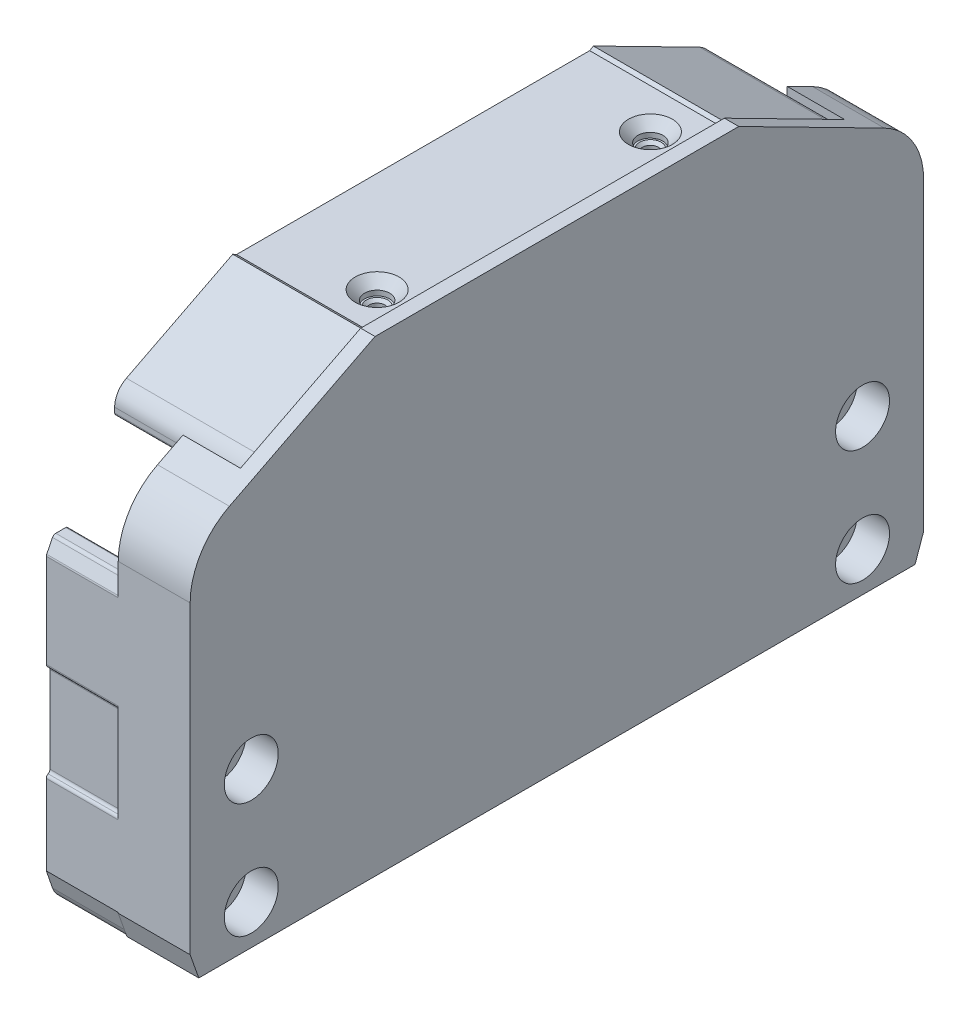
ISO-10303-21;
HEADER;
FILE_DESCRIPTION(('STEP AP214'),'2;1');
FILE_NAME('part.step','',(''),(''),'','','');
FILE_SCHEMA(('AUTOMOTIVE_DESIGN { 1 0 10303 214 1 1 1 1 }'));
ENDSEC;
DATA;
#1=APPLICATION_CONTEXT('core data for automotive mechanical design processes');
#2=APPLICATION_PROTOCOL_DEFINITION('international standard','automotive_design',2000,#1);
#3=PRODUCT_CONTEXT('',#1,'mechanical');
#4=PRODUCT('Part','Part','',(#3));
#5=PRODUCT_RELATED_PRODUCT_CATEGORY('part','',(#4));
#6=PRODUCT_DEFINITION_FORMATION('','',#4);
#7=PRODUCT_DEFINITION_CONTEXT('part definition',#1,'design');
#8=PRODUCT_DEFINITION('design','',#6,#7);
#9=PRODUCT_DEFINITION_SHAPE('','',#8);
#10=(LENGTH_UNIT() NAMED_UNIT(*) SI_UNIT(.MILLI.,.METRE.));
#11=(NAMED_UNIT(*) PLANE_ANGLE_UNIT() SI_UNIT($,.RADIAN.));
#12=(NAMED_UNIT(*) SI_UNIT($,.STERADIAN.) SOLID_ANGLE_UNIT());
#13=UNCERTAINTY_MEASURE_WITH_UNIT(LENGTH_MEASURE(1.E-05),#10,'distance_accuracy_value','');
#14=(GEOMETRIC_REPRESENTATION_CONTEXT(3) GLOBAL_UNCERTAINTY_ASSIGNED_CONTEXT((#13)) GLOBAL_UNIT_ASSIGNED_CONTEXT((#10,
#11,#12)) REPRESENTATION_CONTEXT('',''));
#15=CARTESIAN_POINT('',(0.,0.,0.));
#16=DIRECTION('',(0.,0.,1.));
#17=DIRECTION('',(1.,0.,0.));
#18=AXIS2_PLACEMENT_3D('',#15,#16,#17);
#19=CARTESIAN_POINT('',(245.2480773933,55.,17.75256960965));
#20=DIRECTION('',(0.,1.,0.));
#21=DIRECTION('',(0.,0.,1.));
#22=AXIS2_PLACEMENT_3D('',#19,#20,#21);
#23=PLANE('',#22);
#24=CARTESIAN_POINT('',(246.5,55.,19.));
#25=DIRECTION('',(0.,1.,0.));
#26=DIRECTION('',(0.,0.,1.));
#27=AXIS2_PLACEMENT_3D('',#24,#25,#26);
#28=CIRCLE('',#27,1.1);
#29=CARTESIAN_POINT('',(246.5,55.,20.1));
#30=VERTEX_POINT('',#29);
#31=EDGE_CURVE('E21',#30,#30,#28,.F.);
#32=ORIENTED_EDGE('',*,*,#31,.F.);
#33=EDGE_LOOP('',(#32));
#34=FACE_BOUND('',#33,.T.);
#35=ADVANCED_FACE('F17',(#34),#23,.T.);
#36=CARTESIAN_POINT('',(242.5,3.333307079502,-46.54));
#37=DIRECTION('',(-1.,0.,0.));
#38=DIRECTION('',(0.,0.,1.));
#39=AXIS2_PLACEMENT_3D('',#36,#37,#38);
#40=PLANE('',#39);
#41=CARTESIAN_POINT('',(242.499999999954,6.,-42.5));
#42=DIRECTION('',(1.,0.,0.));
#43=DIRECTION('',(0.,0.,-1.));
#44=AXIS2_PLACEMENT_3D('',#41,#42,#43);
#45=CIRCLE('',#44,2.25);
#46=CARTESIAN_POINT('',(242.499999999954,6.,-44.75));
#47=VERTEX_POINT('',#46);
#48=EDGE_CURVE('E1231',#47,#47,#45,.F.);
#49=ORIENTED_EDGE('',*,*,#48,.F.);
#50=EDGE_LOOP('',(#49));
#51=FACE_BOUND('',#50,.T.);
#52=ADVANCED_FACE('F1242',(#51),#40,.F.);
#53=CARTESIAN_POINT('',(242.5,3.333307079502,-46.54));
#54=DIRECTION('',(-1.,0.,0.));
#55=DIRECTION('',(0.,0.,1.));
#56=AXIS2_PLACEMENT_3D('',#53,#54,#55);
#57=PLANE('',#56);
#58=CARTESIAN_POINT('',(242.499999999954,6.,42.5));
#59=DIRECTION('',(1.,0.,0.));
#60=DIRECTION('',(0.,0.,-1.));
#61=AXIS2_PLACEMENT_3D('',#58,#59,#60);
#62=CIRCLE('',#61,2.25000000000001);
#63=CARTESIAN_POINT('',(242.499999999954,6.,40.25));
#64=VERTEX_POINT('',#63);
#65=EDGE_CURVE('E1229',#64,#64,#62,.F.);
#66=ORIENTED_EDGE('',*,*,#65,.F.);
#67=EDGE_LOOP('',(#66));
#68=FACE_BOUND('',#67,.T.);
#69=ADVANCED_FACE('F1248',(#68),#57,.F.);
#70=CARTESIAN_POINT('',(242.5,3.333307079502,-46.54));
#71=DIRECTION('',(-1.,0.,0.));
#72=DIRECTION('',(0.,0.,1.));
#73=AXIS2_PLACEMENT_3D('',#70,#71,#72);
#74=PLANE('',#73);
#75=CARTESIAN_POINT('',(242.499999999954,22.,42.5));
#76=DIRECTION('',(1.,0.,0.));
#77=DIRECTION('',(0.,0.,-1.));
#78=AXIS2_PLACEMENT_3D('',#75,#76,#77);
#79=CIRCLE('',#78,2.25000000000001);
#80=CARTESIAN_POINT('',(242.499999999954,22.,40.25));
#81=VERTEX_POINT('',#80);
#82=EDGE_CURVE('E1226',#81,#81,#79,.F.);
#83=ORIENTED_EDGE('',*,*,#82,.F.);
#84=EDGE_LOOP('',(#83));
#85=FACE_BOUND('',#84,.T.);
#86=ADVANCED_FACE('F3265',(#85),#74,.F.);
#87=CARTESIAN_POINT('',(242.5,3.333307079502,-46.54));
#88=DIRECTION('',(-1.,0.,0.));
#89=DIRECTION('',(0.,0.,1.));
#90=AXIS2_PLACEMENT_3D('',#87,#88,#89);
#91=PLANE('',#90);
#92=CARTESIAN_POINT('',(242.499999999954,22.,-42.5));
#93=DIRECTION('',(1.,0.,0.));
#94=DIRECTION('',(0.,0.,-1.));
#95=AXIS2_PLACEMENT_3D('',#92,#93,#94);
#96=CIRCLE('',#95,2.25);
#97=CARTESIAN_POINT('',(242.499999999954,22.,-44.75));
#98=VERTEX_POINT('',#97);
#99=EDGE_CURVE('E639',#98,#98,#96,.F.);
#100=ORIENTED_EDGE('',*,*,#99,.F.);
#101=EDGE_LOOP('',(#100));
#102=FACE_BOUND('',#101,.T.);
#103=ADVANCED_FACE('F2098',(#102),#91,.F.);
#104=CARTESIAN_POINT('',(232.3,1.104249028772,-24.39575097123));
#105=DIRECTION('',(0.,-0.707106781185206,0.707106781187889));
#106=DIRECTION('',(0.,-0.707106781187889,-0.707106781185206));
#107=AXIS2_PLACEMENT_3D('',#104,#105,#106);
#108=PLANE('',#107);
#109=DIRECTION('',(1.,0.,0.));
#110=VECTOR('',#109,1.);
#111=CARTESIAN_POINT('',(237.5,0.,-25.5));
#112=LINE('',#111,#110);
#113=CARTESIAN_POINT('',(232.5,0.,-25.4999999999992));
#114=VERTEX_POINT('',#113);
#115=CARTESIAN_POINT('',(242.5,-8.49260079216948E-13,-25.499999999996));
#116=VERTEX_POINT('',#115);
#117=EDGE_CURVE('E777',#114,#116,#112,.T.);
#118=ORIENTED_EDGE('',*,*,#117,.T.);
#119=DIRECTION('',(0.,0.707106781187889,0.707106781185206));
#120=VECTOR('',#119,1.);
#121=CARTESIAN_POINT('',(242.5,0.4999999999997,-25.));
#122=LINE('',#121,#120);
#123=CARTESIAN_POINT('',(242.5,0.499999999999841,-25.));
#124=VERTEX_POINT('',#123);
#125=EDGE_CURVE('E831',#116,#124,#122,.T.);
#126=ORIENTED_EDGE('',*,*,#125,.T.);
#127=DIRECTION('',(0.,0.707106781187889,0.707106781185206));
#128=VECTOR('',#127,1.);
#129=CARTESIAN_POINT('',(242.5,0.4999999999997,-25.));
#130=LINE('',#129,#128);
#131=CARTESIAN_POINT('',(242.5,0.999999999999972,-24.5000000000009));
#132=VERTEX_POINT('',#131);
#133=EDGE_CURVE('E832',#124,#132,#130,.T.);
#134=ORIENTED_EDGE('',*,*,#133,.T.);
#135=DIRECTION('',(-1.,0.,0.));
#136=VECTOR('',#135,1.);
#137=CARTESIAN_POINT('',(237.5,1.,-24.5));
#138=LINE('',#137,#136);
#139=CARTESIAN_POINT('',(232.5,1.00000000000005,-24.5000000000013));
#140=VERTEX_POINT('',#139);
#141=EDGE_CURVE('E776',#132,#140,#138,.T.);
#142=ORIENTED_EDGE('',*,*,#141,.T.);
#143=DIRECTION('',(0.,-0.707106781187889,-0.707106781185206));
#144=VECTOR('',#143,1.);
#145=CARTESIAN_POINT('',(232.5,0.4999999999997,-25.));
#146=LINE('',#145,#144);
#147=EDGE_CURVE('E828',#140,#114,#146,.T.);
#148=ORIENTED_EDGE('',*,*,#147,.T.);
#149=EDGE_LOOP('',(#118,#126,#134,#142,#148));
#150=FACE_BOUND('',#149,.T.);
#151=ADVANCED_FACE('F1863',(#150),#108,.T.);
#152=CARTESIAN_POINT('',(242.7,-0.1042490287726,25.60424902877));
#153=DIRECTION('',(0.,0.707106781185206,0.707106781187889));
#154=DIRECTION('',(0.,0.707106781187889,-0.707106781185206));
#155=AXIS2_PLACEMENT_3D('',#152,#153,#154);
#156=PLANE('',#155);
#157=DIRECTION('',(-1.,0.,0.));
#158=VECTOR('',#157,1.);
#159=CARTESIAN_POINT('',(237.5,0.,25.5));
#160=LINE('',#159,#158);
#161=CARTESIAN_POINT('',(242.5,-8.49083896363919E-13,25.4999999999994));
#162=VERTEX_POINT('',#161);
#163=CARTESIAN_POINT('',(232.5,0.,25.4999999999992));
#164=VERTEX_POINT('',#163);
#165=EDGE_CURVE('E759',#162,#164,#160,.T.);
#166=ORIENTED_EDGE('',*,*,#165,.T.);
#167=DIRECTION('',(0.,-0.707106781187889,0.707106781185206));
#168=VECTOR('',#167,1.);
#169=CARTESIAN_POINT('',(232.5,0.4999999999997,25.));
#170=LINE('',#169,#168);
#171=CARTESIAN_POINT('',(232.5,0.99999999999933,24.5000000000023));
#172=VERTEX_POINT('',#171);
#173=EDGE_CURVE('E820',#172,#164,#170,.T.);
#174=ORIENTED_EDGE('',*,*,#173,.F.);
#175=DIRECTION('',(1.,0.,0.));
#176=VECTOR('',#175,1.);
#177=CARTESIAN_POINT('',(237.5,1.,24.5));
#178=LINE('',#177,#176);
#179=CARTESIAN_POINT('',(242.5,1.00000000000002,24.5000000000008));
#180=VERTEX_POINT('',#179);
#181=EDGE_CURVE('E770',#172,#180,#178,.T.);
#182=ORIENTED_EDGE('',*,*,#181,.T.);
#183=DIRECTION('',(0.,0.707106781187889,-0.707106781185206));
#184=VECTOR('',#183,1.);
#185=CARTESIAN_POINT('',(242.5,0.4999999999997,25.));
#186=LINE('',#185,#184);
#187=CARTESIAN_POINT('',(242.5,0.499999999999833,25.));
#188=VERTEX_POINT('',#187);
#189=EDGE_CURVE('E825',#188,#180,#186,.T.);
#190=ORIENTED_EDGE('',*,*,#189,.F.);
#191=DIRECTION('',(0.,0.707106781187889,-0.707106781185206));
#192=VECTOR('',#191,1.);
#193=CARTESIAN_POINT('',(242.5,0.4999999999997,25.));
#194=LINE('',#193,#192);
#195=EDGE_CURVE('E817',#162,#188,#194,.T.);
#196=ORIENTED_EDGE('',*,*,#195,.F.);
#197=EDGE_LOOP('',(#166,#174,#182,#190,#196));
#198=FACE_BOUND('',#197,.T.);
#199=ADVANCED_FACE('F1874',(#198),#156,.F.);
#200=CARTESIAN_POINT('',(246.5,55.,19.));
#201=DIRECTION('',(0.,1.,0.));
#202=DIRECTION('',(0.,0.,1.));
#203=AXIS2_PLACEMENT_3D('',#200,#201,#202);
#204=CYLINDRICAL_SURFACE('',#203,1.1);
#205=ORIENTED_EDGE('',*,*,#31,.T.);
#206=EDGE_LOOP('',(#205));
#207=FACE_BOUND('',#206,.T.);
#208=CARTESIAN_POINT('',(246.5,62.6000000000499,19.));
#209=DIRECTION('',(0.,1.,0.));
#210=DIRECTION('',(-1.,0.,0.));
#211=AXIS2_PLACEMENT_3D('',#208,#209,#210);
#212=CIRCLE('',#211,1.09999999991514);
#213=CARTESIAN_POINT('',(245.400000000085,62.6000000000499,19.));
#214=VERTEX_POINT('',#213);
#215=EDGE_CURVE('E767',#214,#214,#212,.F.);
#216=ORIENTED_EDGE('',*,*,#215,.F.);
#217=EDGE_LOOP('',(#216));
#218=FACE_BOUND('',#217,.T.);
#219=ADVANCED_FACE('F1238',(#207,#218),#204,.F.);
#220=CARTESIAN_POINT('',(242.499999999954,6.,-42.5));
#221=DIRECTION('',(1.,0.,0.));
#222=DIRECTION('',(0.,0.,-1.));
#223=AXIS2_PLACEMENT_3D('',#220,#221,#222);
#224=CYLINDRICAL_SURFACE('',#223,2.25);
#225=CARTESIAN_POINT('',(248.000000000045,6.,-42.5));
#226=DIRECTION('',(1.,0.,0.));
#227=DIRECTION('',(0.,0.,-1.));
#228=AXIS2_PLACEMENT_3D('',#225,#226,#227);
#229=CIRCLE('',#228,2.25);
#230=CARTESIAN_POINT('',(248.000000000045,6.,-44.75));
#231=VERTEX_POINT('',#230);
#232=EDGE_CURVE('E686',#231,#231,#229,.T.);
#233=ORIENTED_EDGE('',*,*,#232,.T.);
#234=EDGE_LOOP('',(#233));
#235=FACE_BOUND('',#234,.T.);
#236=ORIENTED_EDGE('',*,*,#48,.T.);
#237=EDGE_LOOP('',(#236));
#238=FACE_BOUND('',#237,.T.);
#239=ADVANCED_FACE('F2086',(#235,#238),#224,.F.);
#240=CARTESIAN_POINT('',(242.499999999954,6.,42.5));
#241=DIRECTION('',(1.,0.,0.));
#242=DIRECTION('',(0.,0.,-1.));
#243=AXIS2_PLACEMENT_3D('',#240,#241,#242);
#244=CYLINDRICAL_SURFACE('',#243,2.25000000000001);
#245=CARTESIAN_POINT('',(248.000000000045,6.,42.5));
#246=DIRECTION('',(1.,0.,0.));
#247=DIRECTION('',(0.,0.,-1.));
#248=AXIS2_PLACEMENT_3D('',#245,#246,#247);
#249=CIRCLE('',#248,2.25000000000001);
#250=CARTESIAN_POINT('',(248.000000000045,6.,40.25));
#251=VERTEX_POINT('',#250);
#252=EDGE_CURVE('E1207',#251,#251,#249,.T.);
#253=ORIENTED_EDGE('',*,*,#252,.T.);
#254=EDGE_LOOP('',(#253));
#255=FACE_BOUND('',#254,.T.);
#256=ORIENTED_EDGE('',*,*,#65,.T.);
#257=EDGE_LOOP('',(#256));
#258=FACE_BOUND('',#257,.T.);
#259=ADVANCED_FACE('F2082',(#255,#258),#244,.F.);
#260=CARTESIAN_POINT('',(242.499999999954,22.,42.5));
#261=DIRECTION('',(1.,0.,0.));
#262=DIRECTION('',(0.,0.,-1.));
#263=AXIS2_PLACEMENT_3D('',#260,#261,#262);
#264=CYLINDRICAL_SURFACE('',#263,2.25000000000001);
#265=CARTESIAN_POINT('',(248.000000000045,22.,42.5));
#266=DIRECTION('',(1.,0.,0.));
#267=DIRECTION('',(0.,0.,-1.));
#268=AXIS2_PLACEMENT_3D('',#265,#266,#267);
#269=CIRCLE('',#268,2.25000000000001);
#270=CARTESIAN_POINT('',(248.000000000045,22.,40.25));
#271=VERTEX_POINT('',#270);
#272=EDGE_CURVE('E1204',#271,#271,#269,.T.);
#273=ORIENTED_EDGE('',*,*,#272,.T.);
#274=EDGE_LOOP('',(#273));
#275=FACE_BOUND('',#274,.T.);
#276=ORIENTED_EDGE('',*,*,#82,.T.);
#277=EDGE_LOOP('',(#276));
#278=FACE_BOUND('',#277,.T.);
#279=ADVANCED_FACE('F2078',(#275,#278),#264,.F.);
#280=CARTESIAN_POINT('',(242.499999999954,22.,-42.5));
#281=DIRECTION('',(1.,0.,0.));
#282=DIRECTION('',(0.,0.,-1.));
#283=AXIS2_PLACEMENT_3D('',#280,#281,#282);
#284=CYLINDRICAL_SURFACE('',#283,2.25);
#285=CARTESIAN_POINT('',(248.000000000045,22.,-42.5));
#286=DIRECTION('',(1.,0.,0.));
#287=DIRECTION('',(0.,0.,-1.));
#288=AXIS2_PLACEMENT_3D('',#285,#286,#287);
#289=CIRCLE('',#288,2.25);
#290=CARTESIAN_POINT('',(248.000000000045,22.,-44.75));
#291=VERTEX_POINT('',#290);
#292=EDGE_CURVE('E1201',#291,#291,#289,.T.);
#293=ORIENTED_EDGE('',*,*,#292,.T.);
#294=EDGE_LOOP('',(#293));
#295=FACE_BOUND('',#294,.T.);
#296=ORIENTED_EDGE('',*,*,#99,.T.);
#297=EDGE_LOOP('',(#296));
#298=FACE_BOUND('',#297,.T.);
#299=ADVANCED_FACE('F2075',(#295,#298),#284,.F.);
#300=CARTESIAN_POINT('',(245.2480773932,55.,-20.24743039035));
#301=DIRECTION('',(0.,1.,0.));
#302=DIRECTION('',(0.,0.,1.));
#303=AXIS2_PLACEMENT_3D('',#300,#301,#302);
#304=PLANE('',#303);
#305=CARTESIAN_POINT('',(246.5,55.,-19.));
#306=DIRECTION('',(0.,1.,0.));
#307=DIRECTION('',(0.,0.,1.));
#308=AXIS2_PLACEMENT_3D('',#305,#306,#307);
#309=CIRCLE('',#308,1.1);
#310=CARTESIAN_POINT('',(246.5,55.,-17.9));
#311=VERTEX_POINT('',#310);
#312=EDGE_CURVE('E792',#311,#311,#309,.F.);
#313=ORIENTED_EDGE('',*,*,#312,.F.);
#314=EDGE_LOOP('',(#313));
#315=FACE_BOUND('',#314,.T.);
#316=ADVANCED_FACE('F2074',(#315),#304,.T.);
#317=CARTESIAN_POINT('',(232.5,28.,-51.));
#318=DIRECTION('',(1.,0.,0.));
#319=DIRECTION('',(0.,0.,-1.));
#320=AXIS2_PLACEMENT_3D('',#317,#318,#319);
#321=CYLINDRICAL_SURFACE('',#320,0.499999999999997);
#322=CARTESIAN_POINT('',(232.5,28.,-51.));
#323=DIRECTION('',(1.,0.,0.));
#324=DIRECTION('',(0.,0.,-1.));
#325=AXIS2_PLACEMENT_3D('',#322,#323,#324);
#326=CIRCLE('',#325,0.499999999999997);
#327=CARTESIAN_POINT('',(232.5,28.,-50.5));
#328=VERTEX_POINT('',#327);
#329=CARTESIAN_POINT('',(232.5,28.4330127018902,-50.7500000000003));
#330=VERTEX_POINT('',#329);
#331=EDGE_CURVE('E638',#328,#330,#326,.F.);
#332=ORIENTED_EDGE('',*,*,#331,.T.);
#333=DIRECTION('',(1.,0.,0.));
#334=VECTOR('',#333,1.);
#335=CARTESIAN_POINT('',(237.5,28.4330127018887,-50.7500000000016));
#336=LINE('',#335,#334);
#337=CARTESIAN_POINT('',(242.5,28.4330127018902,-50.7500000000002));
#338=VERTEX_POINT('',#337);
#339=EDGE_CURVE('E636',#330,#338,#336,.T.);
#340=ORIENTED_EDGE('',*,*,#339,.T.);
#341=CARTESIAN_POINT('',(242.5,28.,-50.9999999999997));
#342=DIRECTION('',(1.,0.,0.));
#343=DIRECTION('',(0.,0.,-1.));
#344=AXIS2_PLACEMENT_3D('',#341,#342,#343);
#345=CIRCLE('',#344,0.499999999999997);
#346=CARTESIAN_POINT('',(242.5,28.,-50.5000000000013));
#347=VERTEX_POINT('',#346);
#348=EDGE_CURVE('E627',#338,#347,#345,.T.);
#349=ORIENTED_EDGE('',*,*,#348,.T.);
#350=DIRECTION('',(-1.,0.,0.));
#351=VECTOR('',#350,1.);
#352=CARTESIAN_POINT('',(237.5,28.,-50.5));
#353=LINE('',#352,#351);
#354=EDGE_CURVE('E633',#347,#328,#353,.T.);
#355=ORIENTED_EDGE('',*,*,#354,.T.);
#356=EDGE_LOOP('',(#332,#340,#349,#355));
#357=FACE_BOUND('',#356,.T.);
#358=ADVANCED_FACE('F632',(#357),#321,.F.);
#359=CARTESIAN_POINT('',(232.5,16.,-51.));
#360=DIRECTION('',(1.,0.,0.));
#361=DIRECTION('',(0.,1.,0.));
#362=AXIS2_PLACEMENT_3D('',#359,#360,#361);
#363=CYLINDRICAL_SURFACE('',#362,0.5);
#364=CARTESIAN_POINT('',(232.5,16.,-51.));
#365=DIRECTION('',(1.,0.,0.));
#366=DIRECTION('',(0.,1.,0.));
#367=AXIS2_PLACEMENT_3D('',#364,#365,#366);
#368=CIRCLE('',#367,0.5);
#369=CARTESIAN_POINT('',(232.5,15.5669872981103,-50.7499999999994));
#370=VERTEX_POINT('',#369);
#371=CARTESIAN_POINT('',(232.5,16.,-50.5));
#372=VERTEX_POINT('',#371);
#373=EDGE_CURVE('E810',#370,#372,#368,.F.);
#374=ORIENTED_EDGE('',*,*,#373,.T.);
#375=DIRECTION('',(1.,0.,0.));
#376=VECTOR('',#375,1.);
#377=CARTESIAN_POINT('',(237.5,16.,-50.5));
#378=LINE('',#377,#376);
#379=CARTESIAN_POINT('',(242.5,15.9999999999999,-50.5000000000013));
#380=VERTEX_POINT('',#379);
#381=EDGE_CURVE('E648',#372,#380,#378,.T.);
#382=ORIENTED_EDGE('',*,*,#381,.T.);
#383=CARTESIAN_POINT('',(242.5,15.9999999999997,-51.));
#384=DIRECTION('',(1.,0.,0.));
#385=DIRECTION('',(0.,1.,0.));
#386=AXIS2_PLACEMENT_3D('',#383,#384,#385);
#387=CIRCLE('',#386,0.5);
#388=CARTESIAN_POINT('',(242.5,15.5669872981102,-50.7499999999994));
#389=VERTEX_POINT('',#388);
#390=EDGE_CURVE('E653',#389,#380,#387,.F.);
#391=ORIENTED_EDGE('',*,*,#390,.F.);
#392=DIRECTION('',(-1.,0.,0.));
#393=VECTOR('',#392,1.);
#394=CARTESIAN_POINT('',(237.5,15.5669872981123,-50.7499999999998));
#395=LINE('',#394,#393);
#396=EDGE_CURVE('E787',#389,#370,#395,.T.);
#397=ORIENTED_EDGE('',*,*,#396,.T.);
#398=EDGE_LOOP('',(#374,#382,#391,#397));
#399=FACE_BOUND('',#398,.T.);
#400=ADVANCED_FACE('F2068',(#399),#363,.F.);
#401=CARTESIAN_POINT('',(242.7,44.,-48.15256960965));
#402=DIRECTION('',(0.,1.,0.));
#403=DIRECTION('',(0.,0.,-1.));
#404=AXIS2_PLACEMENT_3D('',#401,#402,#403);
#405=PLANE('',#404);
#406=DIRECTION('',(0.,0.,1.));
#407=VECTOR('',#406,1.);
#408=CARTESIAN_POINT('',(232.5,44.,-48.995491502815));
#409=LINE('',#408,#407);
#410=CARTESIAN_POINT('',(232.5,44.,-49.69098300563));
#411=VERTEX_POINT('',#410);
#412=CARTESIAN_POINT('',(232.5,44.,-48.3));
#413=VERTEX_POINT('',#412);
#414=EDGE_CURVE('E806',#411,#413,#409,.T.);
#415=ORIENTED_EDGE('',*,*,#414,.T.);
#416=DIRECTION('',(1.,0.,0.));
#417=VECTOR('',#416,1.);
#418=CARTESIAN_POINT('',(237.5,44.,-48.3));
#419=LINE('',#418,#417);
#420=CARTESIAN_POINT('',(242.5,44.,-48.2999999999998));
#421=VERTEX_POINT('',#420);
#422=EDGE_CURVE('E797',#413,#421,#419,.T.);
#423=ORIENTED_EDGE('',*,*,#422,.T.);
#424=DIRECTION('',(0.,0.,-1.));
#425=VECTOR('',#424,1.);
#426=CARTESIAN_POINT('',(242.5,44.,-48.995491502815));
#427=LINE('',#426,#425);
#428=CARTESIAN_POINT('',(242.5,44.,-49.69098300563));
#429=VERTEX_POINT('',#428);
#430=EDGE_CURVE('E808',#421,#429,#427,.T.);
#431=ORIENTED_EDGE('',*,*,#430,.T.);
#432=DIRECTION('',(-1.,0.,0.));
#433=VECTOR('',#432,1.);
#434=CARTESIAN_POINT('',(237.5,44.,-49.69098300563));
#435=LINE('',#434,#433);
#436=EDGE_CURVE('E793',#429,#411,#435,.T.);
#437=ORIENTED_EDGE('',*,*,#436,.T.);
#438=EDGE_LOOP('',(#415,#423,#431,#437));
#439=FACE_BOUND('',#438,.T.);
#440=ADVANCED_FACE('F2034',(#439),#405,.T.);
#441=CARTESIAN_POINT('',(242.7,44.,49.83841339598));
#442=DIRECTION('',(0.,1.,0.));
#443=DIRECTION('',(0.,0.,-1.));
#444=AXIS2_PLACEMENT_3D('',#441,#442,#443);
#445=PLANE('',#444);
#446=DIRECTION('',(0.,0.,1.));
#447=VECTOR('',#446,1.);
#448=CARTESIAN_POINT('',(232.5,44.,48.995491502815));
#449=LINE('',#448,#447);
#450=CARTESIAN_POINT('',(232.5,44.,48.3));
#451=VERTEX_POINT('',#450);
#452=CARTESIAN_POINT('',(232.5,44.,49.69098300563));
#453=VERTEX_POINT('',#452);
#454=EDGE_CURVE('E801',#451,#453,#449,.T.);
#455=ORIENTED_EDGE('',*,*,#454,.T.);
#456=DIRECTION('',(1.,0.,0.));
#457=VECTOR('',#456,1.);
#458=CARTESIAN_POINT('',(237.5,44.,49.69098300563));
#459=LINE('',#458,#457);
#460=CARTESIAN_POINT('',(242.5,44.,49.6909830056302));
#461=VERTEX_POINT('',#460);
#462=EDGE_CURVE('E745',#453,#461,#459,.T.);
#463=ORIENTED_EDGE('',*,*,#462,.T.);
#464=DIRECTION('',(0.,0.,-1.));
#465=VECTOR('',#464,1.);
#466=CARTESIAN_POINT('',(242.5,44.,48.995491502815));
#467=LINE('',#466,#465);
#468=CARTESIAN_POINT('',(242.5,44.,48.3));
#469=VERTEX_POINT('',#468);
#470=EDGE_CURVE('E804',#461,#469,#467,.T.);
#471=ORIENTED_EDGE('',*,*,#470,.T.);
#472=DIRECTION('',(-1.,0.,0.));
#473=VECTOR('',#472,1.);
#474=CARTESIAN_POINT('',(237.5,44.,48.3));
#475=LINE('',#474,#473);
#476=EDGE_CURVE('E740',#469,#451,#475,.T.);
#477=ORIENTED_EDGE('',*,*,#476,.T.);
#478=EDGE_LOOP('',(#455,#463,#471,#477));
#479=FACE_BOUND('',#478,.T.);
#480=ADVANCED_FACE('F1962',(#479),#445,.T.);
#481=CARTESIAN_POINT('',(232.5,28.,51.));
#482=DIRECTION('',(1.,0.,0.));
#483=DIRECTION('',(0.,1.,0.));
#484=AXIS2_PLACEMENT_3D('',#481,#482,#483);
#485=CYLINDRICAL_SURFACE('',#484,0.5);
#486=CARTESIAN_POINT('',(232.5,28.,51.));
#487=DIRECTION('',(1.,0.,0.));
#488=DIRECTION('',(0.,1.,0.));
#489=AXIS2_PLACEMENT_3D('',#486,#487,#488);
#490=CIRCLE('',#489,0.5);
#491=CARTESIAN_POINT('',(232.5,28.4330127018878,50.7499999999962));
#492=VERTEX_POINT('',#491);
#493=CARTESIAN_POINT('',(232.5,28.,50.5));
#494=VERTEX_POINT('',#493);
#495=EDGE_CURVE('E1219',#492,#494,#490,.F.);
#496=ORIENTED_EDGE('',*,*,#495,.T.);
#497=DIRECTION('',(-1.,0.,0.));
#498=VECTOR('',#497,1.);
#499=CARTESIAN_POINT('',(237.5,28.,50.5));
#500=LINE('',#499,#498);
#501=CARTESIAN_POINT('',(242.5,28.0000000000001,50.5000000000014));
#502=VERTEX_POINT('',#501);
#503=EDGE_CURVE('E756',#502,#494,#500,.T.);
#504=ORIENTED_EDGE('',*,*,#503,.F.);
#505=CARTESIAN_POINT('',(242.5,28.0000000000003,51.));
#506=DIRECTION('',(1.,0.,0.));
#507=DIRECTION('',(0.,1.,0.));
#508=AXIS2_PLACEMENT_3D('',#505,#506,#507);
#509=CIRCLE('',#508,0.5);
#510=CARTESIAN_POINT('',(242.5,28.4330127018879,50.7499999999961));
#511=VERTEX_POINT('',#510);
#512=EDGE_CURVE('E803',#502,#511,#509,.T.);
#513=ORIENTED_EDGE('',*,*,#512,.T.);
#514=DIRECTION('',(-1.,0.,0.));
#515=VECTOR('',#514,1.);
#516=CARTESIAN_POINT('',(237.5,28.4330127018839,50.7499999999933));
#517=LINE('',#516,#515);
#518=EDGE_CURVE('E749',#511,#492,#517,.T.);
#519=ORIENTED_EDGE('',*,*,#518,.T.);
#520=EDGE_LOOP('',(#496,#504,#513,#519));
#521=FACE_BOUND('',#520,.T.);
#522=ADVANCED_FACE('F1936',(#521),#485,.F.);
#523=CARTESIAN_POINT('',(232.5,16.,51.));
#524=DIRECTION('',(1.,0.,0.));
#525=DIRECTION('',(0.,0.,-1.));
#526=AXIS2_PLACEMENT_3D('',#523,#524,#525);
#527=CYLINDRICAL_SURFACE('',#526,0.5);
#528=CARTESIAN_POINT('',(232.5,16.,51.));
#529=DIRECTION('',(1.,0.,0.));
#530=DIRECTION('',(0.,0.,-1.));
#531=AXIS2_PLACEMENT_3D('',#528,#529,#530);
#532=CIRCLE('',#531,0.5);
#533=CARTESIAN_POINT('',(232.5,16.,50.5));
#534=VERTEX_POINT('',#533);
#535=CARTESIAN_POINT('',(232.5,15.5669872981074,50.7500000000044));
#536=VERTEX_POINT('',#535);
#537=EDGE_CURVE('E649',#534,#536,#532,.F.);
#538=ORIENTED_EDGE('',*,*,#537,.T.);
#539=DIRECTION('',(1.,0.,0.));
#540=VECTOR('',#539,1.);
#541=CARTESIAN_POINT('',(237.5,15.5669872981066,50.7500000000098));
#542=LINE('',#541,#540);
#543=CARTESIAN_POINT('',(242.5,15.5669872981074,50.7500000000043));
#544=VERTEX_POINT('',#543);
#545=EDGE_CURVE('E760',#536,#544,#542,.T.);
#546=ORIENTED_EDGE('',*,*,#545,.T.);
#547=CARTESIAN_POINT('',(242.5,16.,50.9999999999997));
#548=DIRECTION('',(1.,0.,0.));
#549=DIRECTION('',(0.,0.,-1.));
#550=AXIS2_PLACEMENT_3D('',#547,#548,#549);
#551=CIRCLE('',#550,0.5);
#552=CARTESIAN_POINT('',(242.5,16.,50.5000000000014));
#553=VERTEX_POINT('',#552);
#554=EDGE_CURVE('E1185',#553,#544,#551,.F.);
#555=ORIENTED_EDGE('',*,*,#554,.F.);
#556=DIRECTION('',(1.,0.,0.));
#557=VECTOR('',#556,1.);
#558=CARTESIAN_POINT('',(237.5,16.,50.5));
#559=LINE('',#558,#557);
#560=EDGE_CURVE('E753',#534,#553,#559,.T.);
#561=ORIENTED_EDGE('',*,*,#560,.F.);
#562=EDGE_LOOP('',(#538,#546,#555,#561));
#563=FACE_BOUND('',#562,.T.);
#564=ADVANCED_FACE('F1926',(#563),#527,.F.);
#565=CARTESIAN_POINT('',(242.7,15.76,-50.5));
#566=DIRECTION('',(0.,0.,1.));
#567=DIRECTION('',(0.,1.,0.));
#568=AXIS2_PLACEMENT_3D('',#565,#566,#567);
#569=PLANE('',#568);
#570=DIRECTION('',(0.,-1.,0.));
#571=VECTOR('',#570,1.);
#572=CARTESIAN_POINT('',(232.5,22.,-50.5));
#573=LINE('',#572,#571);
#574=EDGE_CURVE('E647',#328,#372,#573,.T.);
#575=ORIENTED_EDGE('',*,*,#574,.F.);
#576=ORIENTED_EDGE('',*,*,#354,.F.);
#577=DIRECTION('',(0.,1.,0.));
#578=VECTOR('',#577,1.);
#579=CARTESIAN_POINT('',(242.5,22.,-50.5000000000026));
#580=LINE('',#579,#578);
#581=EDGE_CURVE('E645',#380,#347,#580,.T.);
#582=ORIENTED_EDGE('',*,*,#581,.F.);
#583=ORIENTED_EDGE('',*,*,#381,.F.);
#584=EDGE_LOOP('',(#575,#576,#582,#583));
#585=FACE_BOUND('',#584,.T.);
#586=ADVANCED_FACE('F643',(#585),#569,.F.);
#587=CARTESIAN_POINT('',(242.5,2.472697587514,-47.30124556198));
#588=DIRECTION('',(-1.,0.,0.));
#589=DIRECTION('',(0.,0.,1.));
#590=AXIS2_PLACEMENT_3D('',#587,#588,#589);
#591=CYLINDRICAL_SURFACE('',#590,3.);
#592=DIRECTION('',(-1.,0.,0.));
#593=VECTOR('',#592,1.);
#594=CARTESIAN_POINT('',(237.5,0.,-49.));
#595=LINE('',#594,#593);
#596=CARTESIAN_POINT('',(242.5,-1.3092825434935E-12,-48.9999999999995));
#597=VERTEX_POINT('',#596);
#598=CARTESIAN_POINT('',(232.5,0.,-49.0000000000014));
#599=VERTEX_POINT('',#598);
#600=EDGE_CURVE('E773',#597,#599,#595,.T.);
#601=ORIENTED_EDGE('',*,*,#600,.T.);
#602=CARTESIAN_POINT('',(232.5,2.472697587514,-47.30124556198));
#603=DIRECTION('',(-1.,0.,0.));
#604=DIRECTION('',(0.,0.,1.));
#605=AXIS2_PLACEMENT_3D('',#602,#603,#604);
#606=CIRCLE('',#605,3.);
#607=CARTESIAN_POINT('',(232.5,1.49599312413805,-50.1378012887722));
#608=VERTEX_POINT('',#607);
#609=EDGE_CURVE('E1167',#608,#599,#606,.T.);
#610=ORIENTED_EDGE('',*,*,#609,.F.);
#611=DIRECTION('',(1.,0.,0.));
#612=VECTOR('',#611,1.);
#613=CARTESIAN_POINT('',(237.5,1.49599312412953,-50.1378012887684));
#614=LINE('',#613,#612);
#615=CARTESIAN_POINT('',(242.5,1.49599312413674,-50.1378012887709));
#616=VERTEX_POINT('',#615);
#617=EDGE_CURVE('E782',#608,#616,#614,.T.);
#618=ORIENTED_EDGE('',*,*,#617,.T.);
#619=CARTESIAN_POINT('',(242.5,2.472697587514,-47.30124556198));
#620=DIRECTION('',(-1.,0.,0.));
#621=DIRECTION('',(0.,0.,1.));
#622=AXIS2_PLACEMENT_3D('',#619,#620,#621);
#623=CIRCLE('',#622,3.);
#624=CARTESIAN_POINT('',(242.5,0.499999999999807,-49.5614367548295));
#625=VERTEX_POINT('',#624);
#626=EDGE_CURVE('E726',#625,#616,#623,.F.);
#627=ORIENTED_EDGE('',*,*,#626,.F.);
#628=CARTESIAN_POINT('',(242.5,2.472697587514,-47.30124556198));
#629=DIRECTION('',(-1.,0.,0.));
#630=DIRECTION('',(0.,0.,1.));
#631=AXIS2_PLACEMENT_3D('',#628,#629,#630);
#632=CIRCLE('',#631,3.);
#633=EDGE_CURVE('E694',#625,#597,#632,.T.);
#634=ORIENTED_EDGE('',*,*,#633,.T.);
#635=EDGE_LOOP('',(#601,#610,#618,#627,#634));
#636=FACE_BOUND('',#635,.T.);
#637=ADVANCED_FACE('F1885',(#636),#591,.T.);
#638=CARTESIAN_POINT('',(232.3,0.,-49.47));
#639=DIRECTION('',(0.,1.,0.));
#640=DIRECTION('',(0.,0.,1.));
#641=AXIS2_PLACEMENT_3D('',#638,#639,#640);
#642=PLANE('',#641);
#643=DIRECTION('',(0.,0.,1.));
#644=VECTOR('',#643,1.);
#645=CARTESIAN_POINT('',(242.5,-2.61853798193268E-12,-37.280718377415));
#646=LINE('',#645,#644);
#647=EDGE_CURVE('E690',#597,#116,#646,.T.);
#648=ORIENTED_EDGE('',*,*,#647,.T.);
#649=ORIENTED_EDGE('',*,*,#117,.F.);
#650=DIRECTION('',(0.,0.,1.));
#651=VECTOR('',#650,1.);
#652=CARTESIAN_POINT('',(232.5,0.,0.));
#653=LINE('',#652,#651);
#654=EDGE_CURVE('E851',#599,#114,#653,.T.);
#655=ORIENTED_EDGE('',*,*,#654,.F.);
#656=ORIENTED_EDGE('',*,*,#600,.F.);
#657=EDGE_LOOP('',(#648,#649,#655,#656));
#658=FACE_BOUND('',#657,.T.);
#659=ADVANCED_FACE('F1878',(#658),#642,.F.);
#660=CARTESIAN_POINT('',(242.7,1.,25.48));
#661=DIRECTION('',(0.,1.,0.));
#662=DIRECTION('',(0.,0.,-1.));
#663=AXIS2_PLACEMENT_3D('',#660,#661,#662);
#664=PLANE('',#663);
#665=DIRECTION('',(0.,0.,1.));
#666=VECTOR('',#665,1.);
#667=CARTESIAN_POINT('',(232.5,1.,0.));
#668=LINE('',#667,#666);
#669=EDGE_CURVE('E847',#140,#172,#668,.T.);
#670=ORIENTED_EDGE('',*,*,#669,.F.);
#671=ORIENTED_EDGE('',*,*,#141,.F.);
#672=DIRECTION('',(0.,0.,-1.));
#673=VECTOR('',#672,1.);
#674=CARTESIAN_POINT('',(242.5,0.999999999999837,0.));
#675=LINE('',#674,#673);
#676=EDGE_CURVE('E693',#180,#132,#675,.T.);
#677=ORIENTED_EDGE('',*,*,#676,.F.);
#678=ORIENTED_EDGE('',*,*,#181,.F.);
#679=EDGE_LOOP('',(#670,#671,#677,#678));
#680=FACE_BOUND('',#679,.T.);
#681=ADVANCED_FACE('F1868',(#680),#664,.F.);
#682=CARTESIAN_POINT('',(232.3,0.,25.03));
#683=DIRECTION('',(0.,1.,0.));
#684=DIRECTION('',(0.,0.,1.));
#685=AXIS2_PLACEMENT_3D('',#682,#683,#684);
#686=PLANE('',#685);
#687=DIRECTION('',(0.,0.,1.));
#688=VECTOR('',#687,1.);
#689=CARTESIAN_POINT('',(242.5,-2.61853798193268E-12,37.280718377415));
#690=LINE('',#689,#688);
#691=CARTESIAN_POINT('',(242.5,-1.73255507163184E-12,49.0000000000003));
#692=VERTEX_POINT('',#691);
#693=EDGE_CURVE('E713',#162,#692,#690,.T.);
#694=ORIENTED_EDGE('',*,*,#693,.T.);
#695=DIRECTION('',(-1.,0.,0.));
#696=VECTOR('',#695,1.);
#697=CARTESIAN_POINT('',(237.5,-8.46545056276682E-13,49.0000000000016));
#698=LINE('',#697,#696);
#699=CARTESIAN_POINT('',(232.5,-4.22405166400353E-13,49.0000000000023));
#700=VERTEX_POINT('',#699);
#701=EDGE_CURVE('E755',#692,#700,#698,.T.);
#702=ORIENTED_EDGE('',*,*,#701,.T.);
#703=DIRECTION('',(0.,0.,1.));
#704=VECTOR('',#703,1.);
#705=CARTESIAN_POINT('',(232.5,0.,0.));
#706=LINE('',#705,#704);
#707=EDGE_CURVE('E850',#164,#700,#706,.T.);
#708=ORIENTED_EDGE('',*,*,#707,.F.);
#709=ORIENTED_EDGE('',*,*,#165,.F.);
#710=EDGE_LOOP('',(#694,#702,#708,#709));
#711=FACE_BOUND('',#710,.T.);
#712=ADVANCED_FACE('F1901',(#711),#686,.F.);
#713=CARTESIAN_POINT('',(232.3,28.24,50.5));
#714=DIRECTION('',(0.,0.,1.));
#715=DIRECTION('',(0.,-1.,0.));
#716=AXIS2_PLACEMENT_3D('',#713,#714,#715);
#717=PLANE('',#716);
#718=DIRECTION('',(0.,1.,0.));
#719=VECTOR('',#718,1.);
#720=CARTESIAN_POINT('',(232.5,22.,50.5));
#721=LINE('',#720,#719);
#722=EDGE_CURVE('E1161',#534,#494,#721,.T.);
#723=ORIENTED_EDGE('',*,*,#722,.F.);
#724=ORIENTED_EDGE('',*,*,#560,.T.);
#725=DIRECTION('',(0.,-1.,0.));
#726=VECTOR('',#725,1.);
#727=CARTESIAN_POINT('',(242.5,22.,50.5000000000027));
#728=LINE('',#727,#726);
#729=EDGE_CURVE('E1187',#502,#553,#728,.T.);
#730=ORIENTED_EDGE('',*,*,#729,.F.);
#731=ORIENTED_EDGE('',*,*,#503,.T.);
#732=EDGE_LOOP('',(#723,#724,#730,#731));
#733=FACE_BOUND('',#732,.T.);
#734=ADVANCED_FACE('F1930',(#733),#717,.T.);
#735=CARTESIAN_POINT('',(242.5,2.472697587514,47.30124556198));
#736=DIRECTION('',(-1.,0.,0.));
#737=DIRECTION('',(0.,0.,1.));
#738=AXIS2_PLACEMENT_3D('',#735,#736,#737);
#739=CYLINDRICAL_SURFACE('',#738,3.);
#740=CARTESIAN_POINT('',(232.5,2.472697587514,47.30124556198));
#741=DIRECTION('',(-1.,0.,0.));
#742=DIRECTION('',(0.,0.,1.));
#743=AXIS2_PLACEMENT_3D('',#740,#741,#742);
#744=CIRCLE('',#743,3.);
#745=CARTESIAN_POINT('',(232.5,1.49599312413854,50.1378012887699));
#746=VERTEX_POINT('',#745);
#747=EDGE_CURVE('E1165',#700,#746,#744,.T.);
#748=ORIENTED_EDGE('',*,*,#747,.F.);
#749=ORIENTED_EDGE('',*,*,#701,.F.);
#750=CARTESIAN_POINT('',(242.5,2.472697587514,47.30124556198));
#751=DIRECTION('',(-1.,0.,0.));
#752=DIRECTION('',(0.,0.,1.));
#753=AXIS2_PLACEMENT_3D('',#750,#751,#752);
#754=CIRCLE('',#753,3.);
#755=CARTESIAN_POINT('',(242.5,0.499999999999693,49.5614367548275));
#756=VERTEX_POINT('',#755);
#757=EDGE_CURVE('E716',#692,#756,#754,.T.);
#758=ORIENTED_EDGE('',*,*,#757,.T.);
#759=CARTESIAN_POINT('',(242.5,2.472697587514,47.30124556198));
#760=DIRECTION('',(-1.,0.,0.));
#761=DIRECTION('',(0.,0.,1.));
#762=AXIS2_PLACEMENT_3D('',#759,#760,#761);
#763=CIRCLE('',#762,3.);
#764=CARTESIAN_POINT('',(242.5,1.49599312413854,50.1378012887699));
#765=VERTEX_POINT('',#764);
#766=EDGE_CURVE('E687',#765,#756,#763,.F.);
#767=ORIENTED_EDGE('',*,*,#766,.F.);
#768=DIRECTION('',(1.,0.,0.));
#769=VECTOR('',#768,1.);
#770=CARTESIAN_POINT('',(237.5,1.49599312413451,50.1378012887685));
#771=LINE('',#770,#769);
#772=EDGE_CURVE('E729',#746,#765,#771,.T.);
#773=ORIENTED_EDGE('',*,*,#772,.F.);
#774=EDGE_LOOP('',(#748,#749,#758,#767,#773));
#775=FACE_BOUND('',#774,.T.);
#776=ADVANCED_FACE('F1911',(#775),#739,.T.);
#777=CARTESIAN_POINT('',(246.5,62.6000000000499,19.));
#778=DIRECTION('',(0.,1.,0.));
#779=DIRECTION('',(0.,0.,1.));
#780=AXIS2_PLACEMENT_3D('',#777,#778,#779);
#781=CONICAL_SURFACE('',#780,1.09999999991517,0.785398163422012);
#782=ORIENTED_EDGE('',*,*,#215,.T.);
#783=EDGE_LOOP('',(#782));
#784=FACE_BOUND('',#783,.T.);
#785=CARTESIAN_POINT('',(246.5,63.0000000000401,19.));
#786=DIRECTION('',(0.,1.,0.));
#787=DIRECTION('',(0.,0.,1.));
#788=AXIS2_PLACEMENT_3D('',#785,#786,#787);
#789=CIRCLE('',#788,1.49999999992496);
#790=CARTESIAN_POINT('',(246.500000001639,63.0000000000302,20.4999999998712));
#791=VERTEX_POINT('',#790);
#792=EDGE_CURVE('E1148',#791,#791,#789,.F.);
#793=ORIENTED_EDGE('',*,*,#792,.F.);
#794=EDGE_LOOP('',(#793));
#795=FACE_BOUND('',#794,.T.);
#796=ADVANCED_FACE('F2056',(#784,#795),#781,.F.);
#797=CARTESIAN_POINT('',(242.5,4.147430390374,-49.41400636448));
#798=DIRECTION('',(-1.,0.,0.));
#799=DIRECTION('',(0.,0.,-1.));
#800=AXIS2_PLACEMENT_3D('',#797,#798,#799);
#801=PLANE('',#800);
#802=DIRECTION('',(0.,-0.942990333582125,0.332820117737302));
#803=VECTOR('',#802,1.);
#804=CARTESIAN_POINT('',(242.5,2.20000000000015,-50.4));
#805=LINE('',#804,#803);
#806=CARTESIAN_POINT('',(242.5,3.89999999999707,-50.9999999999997));
#807=VERTEX_POINT('',#806);
#808=CARTESIAN_POINT('',(242.5,0.500000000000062,-49.7999999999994));
#809=VERTEX_POINT('',#808);
#810=EDGE_CURVE('E710',#807,#809,#805,.T.);
#811=ORIENTED_EDGE('',*,*,#810,.T.);
#812=DIRECTION('',(0.,0.,1.));
#813=VECTOR('',#812,1.);
#814=CARTESIAN_POINT('',(242.5,0.499999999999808,-50.280718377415));
#815=LINE('',#814,#813);
#816=EDGE_CURVE('E717',#809,#625,#815,.T.);
#817=ORIENTED_EDGE('',*,*,#816,.T.);
#818=ORIENTED_EDGE('',*,*,#626,.T.);
#819=DIRECTION('',(0.,0.945518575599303,-0.325568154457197));
#820=VECTOR('',#819,1.);
#821=CARTESIAN_POINT('',(242.5,2.74799656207,-50.568900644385));
#822=LINE('',#821,#820);
#823=CARTESIAN_POINT('',(242.5,4.00000000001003,-50.9999999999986));
#824=VERTEX_POINT('',#823);
#825=EDGE_CURVE('E786',#616,#824,#822,.T.);
#826=ORIENTED_EDGE('',*,*,#825,.T.);
#827=DIRECTION('',(0.,-1.,0.));
#828=VECTOR('',#827,1.);
#829=CARTESIAN_POINT('',(242.5,2.2500000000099,-50.9999999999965));
#830=LINE('',#829,#828);
#831=EDGE_CURVE('E721',#824,#807,#830,.T.);
#832=ORIENTED_EDGE('',*,*,#831,.T.);
#833=EDGE_LOOP('',(#811,#817,#818,#826,#832));
#834=FACE_BOUND('',#833,.T.);
#835=ADVANCED_FACE('F1887',(#834),#801,.T.);
#836=CARTESIAN_POINT('',(242.5,-0.1474303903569,24.5087712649));
#837=DIRECTION('',(-1.,0.,0.));
#838=DIRECTION('',(0.,0.,1.));
#839=AXIS2_PLACEMENT_3D('',#836,#837,#838);
#840=PLANE('',#839);
#841=ORIENTED_EDGE('',*,*,#693,.F.);
#842=ORIENTED_EDGE('',*,*,#195,.T.);
#843=DIRECTION('',(0.,0.,1.));
#844=VECTOR('',#843,1.);
#845=CARTESIAN_POINT('',(242.5,0.5,0.));
#846=LINE('',#845,#844);
#847=EDGE_CURVE('E680',#188,#756,#846,.T.);
#848=ORIENTED_EDGE('',*,*,#847,.T.);
#849=ORIENTED_EDGE('',*,*,#757,.F.);
#850=EDGE_LOOP('',(#841,#842,#848,#849));
#851=FACE_BOUND('',#850,.T.);
#852=ADVANCED_FACE('F1897',(#851),#840,.F.);
#853=CARTESIAN_POINT('',(242.5,-0.1474303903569,-50.05266548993));
#854=DIRECTION('',(-1.,0.,0.));
#855=DIRECTION('',(0.,0.,1.));
#856=AXIS2_PLACEMENT_3D('',#853,#854,#855);
#857=PLANE('',#856);
#858=ORIENTED_EDGE('',*,*,#647,.F.);
#859=ORIENTED_EDGE('',*,*,#633,.F.);
#860=DIRECTION('',(0.,0.,1.));
#861=VECTOR('',#860,1.);
#862=CARTESIAN_POINT('',(242.5,0.5,0.));
#863=LINE('',#862,#861);
#864=EDGE_CURVE('E697',#625,#124,#863,.T.);
#865=ORIENTED_EDGE('',*,*,#864,.T.);
#866=ORIENTED_EDGE('',*,*,#125,.F.);
#867=EDGE_LOOP('',(#858,#859,#865,#866));
#868=FACE_BOUND('',#867,.T.);
#869=ADVANCED_FACE('F1882',(#868),#857,.F.);
#870=CARTESIAN_POINT('',(242.5,1.147430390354,26.));
#871=DIRECTION('',(-1.,0.,0.));
#872=DIRECTION('',(0.,0.,-1.));
#873=AXIS2_PLACEMENT_3D('',#870,#871,#872);
#874=PLANE('',#873);
#875=ORIENTED_EDGE('',*,*,#133,.F.);
#876=DIRECTION('',(0.,0.,1.));
#877=VECTOR('',#876,1.);
#878=CARTESIAN_POINT('',(242.5,0.5,0.));
#879=LINE('',#878,#877);
#880=EDGE_CURVE('E700',#124,#188,#879,.T.);
#881=ORIENTED_EDGE('',*,*,#880,.T.);
#882=ORIENTED_EDGE('',*,*,#189,.T.);
#883=ORIENTED_EDGE('',*,*,#676,.T.);
#884=EDGE_LOOP('',(#875,#881,#882,#883));
#885=FACE_BOUND('',#884,.T.);
#886=ADVANCED_FACE('F1870',(#885),#874,.T.);
#887=CARTESIAN_POINT('',(242.5,4.147430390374,51.14743039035));
#888=DIRECTION('',(-1.,0.,0.));
#889=DIRECTION('',(0.,0.,-1.));
#890=AXIS2_PLACEMENT_3D('',#887,#888,#889);
#891=PLANE('',#890);
#892=DIRECTION('',(0.,-0.942990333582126,-0.332820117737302));
#893=VECTOR('',#892,1.);
#894=CARTESIAN_POINT('',(242.5,2.20000000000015,50.4));
#895=LINE('',#894,#893);
#896=CARTESIAN_POINT('',(242.5,3.89999999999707,50.9999999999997));
#897=VERTEX_POINT('',#896);
#898=CARTESIAN_POINT('',(242.5,0.500000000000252,49.7999999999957));
#899=VERTEX_POINT('',#898);
#900=EDGE_CURVE('E705',#897,#899,#895,.T.);
#901=ORIENTED_EDGE('',*,*,#900,.F.);
#902=DIRECTION('',(0.,1.,0.));
#903=VECTOR('',#902,1.);
#904=CARTESIAN_POINT('',(242.5,2.2500000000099,50.9999999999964));
#905=LINE('',#904,#903);
#906=CARTESIAN_POINT('',(242.5,4.00000000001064,50.9999999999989));
#907=VERTEX_POINT('',#906);
#908=EDGE_CURVE('E683',#897,#907,#905,.T.);
#909=ORIENTED_EDGE('',*,*,#908,.T.);
#910=DIRECTION('',(0.,0.945518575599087,0.325568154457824));
#911=VECTOR('',#910,1.);
#912=CARTESIAN_POINT('',(242.5,2.747996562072,50.568900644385));
#913=LINE('',#912,#911);
#914=EDGE_CURVE('E734',#765,#907,#913,.T.);
#915=ORIENTED_EDGE('',*,*,#914,.F.);
#916=ORIENTED_EDGE('',*,*,#766,.T.);
#917=DIRECTION('',(0.,0.,1.));
#918=VECTOR('',#917,1.);
#919=CARTESIAN_POINT('',(242.5,0.5,0.));
#920=LINE('',#919,#918);
#921=EDGE_CURVE('E676',#756,#899,#920,.T.);
#922=ORIENTED_EDGE('',*,*,#921,.T.);
#923=EDGE_LOOP('',(#901,#909,#915,#916,#922));
#924=FACE_BOUND('',#923,.T.);
#925=ADVANCED_FACE('F1914',(#924),#891,.T.);
#926=CARTESIAN_POINT('',(248.,9.908111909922,-38.6));
#927=DIRECTION('',(-1.,0.,0.));
#928=DIRECTION('',(0.,0.,-1.));
#929=AXIS2_PLACEMENT_3D('',#926,#927,#928);
#930=PLANE('',#929);
#931=ORIENTED_EDGE('',*,*,#232,.F.);
#932=EDGE_LOOP('',(#931));
#933=FACE_BOUND('',#932,.T.);
#934=CARTESIAN_POINT('',(247.999999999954,6.,-42.5));
#935=DIRECTION('',(1.,0.,0.));
#936=DIRECTION('',(0.,1.,0.));
#937=AXIS2_PLACEMENT_3D('',#934,#935,#936);
#938=CIRCLE('',#937,3.74999999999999);
#939=CARTESIAN_POINT('',(247.999999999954,9.74999999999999,-42.5));
#940=VERTEX_POINT('',#939);
#941=EDGE_CURVE('E1144',#940,#940,#938,.F.);
#942=ORIENTED_EDGE('',*,*,#941,.F.);
#943=EDGE_LOOP('',(#942));
#944=FACE_BOUND('',#943,.T.);
#945=ADVANCED_FACE('F2129',(#933,#944),#930,.F.);
#946=CARTESIAN_POINT('',(248.,9.908111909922,46.4));
#947=DIRECTION('',(-1.,0.,0.));
#948=DIRECTION('',(0.,0.,-1.));
#949=AXIS2_PLACEMENT_3D('',#946,#947,#948);
#950=PLANE('',#949);
#951=ORIENTED_EDGE('',*,*,#252,.F.);
#952=EDGE_LOOP('',(#951));
#953=FACE_BOUND('',#952,.T.);
#954=CARTESIAN_POINT('',(247.999999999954,6.,42.5));
#955=DIRECTION('',(1.,0.,0.));
#956=DIRECTION('',(0.,1.,0.));
#957=AXIS2_PLACEMENT_3D('',#954,#955,#956);
#958=CIRCLE('',#957,3.75000000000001);
#959=CARTESIAN_POINT('',(247.999999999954,9.75000000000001,42.5));
#960=VERTEX_POINT('',#959);
#961=EDGE_CURVE('E1141',#960,#960,#958,.F.);
#962=ORIENTED_EDGE('',*,*,#961,.F.);
#963=EDGE_LOOP('',(#962));
#964=FACE_BOUND('',#963,.T.);
#965=ADVANCED_FACE('F2132',(#953,#964),#950,.F.);
#966=CARTESIAN_POINT('',(248.,25.90811190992,46.4));
#967=DIRECTION('',(-1.,0.,0.));
#968=DIRECTION('',(0.,0.,-1.));
#969=AXIS2_PLACEMENT_3D('',#966,#967,#968);
#970=PLANE('',#969);
#971=ORIENTED_EDGE('',*,*,#272,.F.);
#972=EDGE_LOOP('',(#971));
#973=FACE_BOUND('',#972,.T.);
#974=CARTESIAN_POINT('',(247.999999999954,22.,42.5));
#975=DIRECTION('',(1.,0.,0.));
#976=DIRECTION('',(0.,1.,0.));
#977=AXIS2_PLACEMENT_3D('',#974,#975,#976);
#978=CIRCLE('',#977,3.75000000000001);
#979=CARTESIAN_POINT('',(247.999999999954,25.75,42.5));
#980=VERTEX_POINT('',#979);
#981=EDGE_CURVE('E1138',#980,#980,#978,.F.);
#982=ORIENTED_EDGE('',*,*,#981,.F.);
#983=EDGE_LOOP('',(#982));
#984=FACE_BOUND('',#983,.T.);
#985=ADVANCED_FACE('F2136',(#973,#984),#970,.F.);
#986=CARTESIAN_POINT('',(248.,25.90811190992,-38.6));
#987=DIRECTION('',(-1.,0.,0.));
#988=DIRECTION('',(0.,0.,-1.));
#989=AXIS2_PLACEMENT_3D('',#986,#987,#988);
#990=PLANE('',#989);
#991=ORIENTED_EDGE('',*,*,#292,.F.);
#992=EDGE_LOOP('',(#991));
#993=FACE_BOUND('',#992,.T.);
#994=CARTESIAN_POINT('',(247.999999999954,22.,-42.5));
#995=DIRECTION('',(1.,0.,0.));
#996=DIRECTION('',(0.,1.,0.));
#997=AXIS2_PLACEMENT_3D('',#994,#995,#996);
#998=CIRCLE('',#997,3.74999999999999);
#999=CARTESIAN_POINT('',(247.999999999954,25.75,-42.5));
#1000=VERTEX_POINT('',#999);
#1001=EDGE_CURVE('E675',#1000,#1000,#998,.F.);
#1002=ORIENTED_EDGE('',*,*,#1001,.F.);
#1003=EDGE_LOOP('',(#1002));
#1004=FACE_BOUND('',#1003,.T.);
#1005=ADVANCED_FACE('F2054',(#993,#1004),#990,.F.);
#1006=CARTESIAN_POINT('',(246.5,55.,-19.));
#1007=DIRECTION('',(0.,1.,0.));
#1008=DIRECTION('',(0.,0.,1.));
#1009=AXIS2_PLACEMENT_3D('',#1006,#1007,#1008);
#1010=CYLINDRICAL_SURFACE('',#1009,1.1);
#1011=ORIENTED_EDGE('',*,*,#312,.T.);
#1012=EDGE_LOOP('',(#1011));
#1013=FACE_BOUND('',#1012,.T.);
#1014=CARTESIAN_POINT('',(246.5,62.6000000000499,-19.));
#1015=DIRECTION('',(0.,1.,0.));
#1016=DIRECTION('',(-1.,0.,0.));
#1017=AXIS2_PLACEMENT_3D('',#1014,#1015,#1016);
#1018=CIRCLE('',#1017,1.09999999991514);
#1019=CARTESIAN_POINT('',(245.400000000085,62.6000000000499,-19.));
#1020=VERTEX_POINT('',#1019);
#1021=EDGE_CURVE('E671',#1020,#1020,#1018,.F.);
#1022=ORIENTED_EDGE('',*,*,#1021,.F.);
#1023=EDGE_LOOP('',(#1022));
#1024=FACE_BOUND('',#1023,.T.);
#1025=ADVANCED_FACE('F2051',(#1013,#1024),#1010,.F.);
#1026=CARTESIAN_POINT('',(242.5,28.86602540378,-50.5));
#1027=DIRECTION('',(-1.,0.,0.));
#1028=DIRECTION('',(0.,0.,1.));
#1029=AXIS2_PLACEMENT_3D('',#1026,#1027,#1028);
#1030=CYLINDRICAL_SURFACE('',#1029,0.5);
#1031=CARTESIAN_POINT('',(232.5,28.86602540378,-50.5));
#1032=DIRECTION('',(-1.,0.,0.));
#1033=DIRECTION('',(0.,0.,1.));
#1034=AXIS2_PLACEMENT_3D('',#1031,#1032,#1033);
#1035=CIRCLE('',#1034,0.5);
#1036=CARTESIAN_POINT('',(232.5,28.8660254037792,-51.));
#1037=VERTEX_POINT('',#1036);
#1038=EDGE_CURVE('E1174',#1037,#330,#1035,.T.);
#1039=ORIENTED_EDGE('',*,*,#1038,.F.);
#1040=DIRECTION('',(1.,0.,0.));
#1041=VECTOR('',#1040,1.);
#1042=CARTESIAN_POINT('',(242.5,28.8660254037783,-51.));
#1043=LINE('',#1042,#1041);
#1044=CARTESIAN_POINT('',(242.5,28.8660254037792,-51.));
#1045=VERTEX_POINT('',#1044);
#1046=EDGE_CURVE('E664',#1037,#1045,#1043,.T.);
#1047=ORIENTED_EDGE('',*,*,#1046,.T.);
#1048=CARTESIAN_POINT('',(242.5,28.86602540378,-50.5));
#1049=DIRECTION('',(-1.,0.,0.));
#1050=DIRECTION('',(0.,0.,1.));
#1051=AXIS2_PLACEMENT_3D('',#1048,#1049,#1050);
#1052=CIRCLE('',#1051,0.5);
#1053=EDGE_CURVE('E655',#338,#1045,#1052,.F.);
#1054=ORIENTED_EDGE('',*,*,#1053,.F.);
#1055=ORIENTED_EDGE('',*,*,#339,.F.);
#1056=EDGE_LOOP('',(#1039,#1047,#1054,#1055));
#1057=FACE_BOUND('',#1056,.T.);
#1058=ADVANCED_FACE('F1772',(#1057),#1030,.T.);
#1059=CARTESIAN_POINT('',(242.5,29.14066641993,-50.35256960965));
#1060=DIRECTION('',(-1.,0.,0.));
#1061=DIRECTION('',(0.,0.,-1.));
#1062=AXIS2_PLACEMENT_3D('',#1059,#1060,#1061);
#1063=PLANE('',#1062);
#1064=ORIENTED_EDGE('',*,*,#1053,.T.);
#1065=DIRECTION('',(0.,-1.,0.));
#1066=VECTOR('',#1065,1.);
#1067=CARTESIAN_POINT('',(242.5,25.085996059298,-51.));
#1068=LINE('',#1067,#1066);
#1069=CARTESIAN_POINT('',(242.5,15.1339745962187,-51.));
#1070=VERTEX_POINT('',#1069);
#1071=EDGE_CURVE('E662',#1045,#1070,#1068,.T.);
#1072=ORIENTED_EDGE('',*,*,#1071,.T.);
#1073=CARTESIAN_POINT('',(242.5,15.1339745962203,-50.5));
#1074=DIRECTION('',(1.,0.,0.));
#1075=DIRECTION('',(0.,1.,0.));
#1076=AXIS2_PLACEMENT_3D('',#1073,#1074,#1075);
#1077=CIRCLE('',#1076,0.5);
#1078=EDGE_CURVE('E657',#1070,#389,#1077,.T.);
#1079=ORIENTED_EDGE('',*,*,#1078,.T.);
#1080=ORIENTED_EDGE('',*,*,#390,.T.);
#1081=ORIENTED_EDGE('',*,*,#581,.T.);
#1082=ORIENTED_EDGE('',*,*,#348,.F.);
#1083=EDGE_LOOP('',(#1064,#1072,#1079,#1080,#1081,#1082));
#1084=FACE_BOUND('',#1083,.T.);
#1085=ADVANCED_FACE('F651',(#1084),#1063,.T.);
#1086=CARTESIAN_POINT('',(232.5,15.13397459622,-50.5));
#1087=DIRECTION('',(1.,0.,0.));
#1088=DIRECTION('',(0.,1.,0.));
#1089=AXIS2_PLACEMENT_3D('',#1086,#1087,#1088);
#1090=CYLINDRICAL_SURFACE('',#1089,0.5);
#1091=CARTESIAN_POINT('',(232.5,15.13397459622,-50.5));
#1092=DIRECTION('',(1.,0.,0.));
#1093=DIRECTION('',(0.,1.,0.));
#1094=AXIS2_PLACEMENT_3D('',#1091,#1092,#1093);
#1095=CIRCLE('',#1094,0.5);
#1096=CARTESIAN_POINT('',(232.5,15.1339745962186,-51.));
#1097=VERTEX_POINT('',#1096);
#1098=EDGE_CURVE('E1172',#370,#1097,#1095,.F.);
#1099=ORIENTED_EDGE('',*,*,#1098,.F.);
#1100=ORIENTED_EDGE('',*,*,#396,.F.);
#1101=ORIENTED_EDGE('',*,*,#1078,.F.);
#1102=DIRECTION('',(-1.,0.,0.));
#1103=VECTOR('',#1102,1.);
#1104=CARTESIAN_POINT('',(242.5,15.1339745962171,-51.));
#1105=LINE('',#1104,#1103);
#1106=EDGE_CURVE('E1741',#1070,#1097,#1105,.T.);
#1107=ORIENTED_EDGE('',*,*,#1106,.T.);
#1108=EDGE_LOOP('',(#1099,#1100,#1101,#1107));
#1109=FACE_BOUND('',#1108,.T.);
#1110=ADVANCED_FACE('F1767',(#1109),#1090,.T.);
#1111=CARTESIAN_POINT('',(242.7,1.356594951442,-50.08980264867));
#1112=DIRECTION('',(0.,0.325568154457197,0.945518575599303));
#1113=DIRECTION('',(0.,0.945518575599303,-0.325568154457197));
#1114=AXIS2_PLACEMENT_3D('',#1111,#1112,#1113);
#1115=PLANE('',#1114);
#1116=DIRECTION('',(0.,-0.945518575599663,0.325568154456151));
#1117=VECTOR('',#1116,1.);
#1118=CARTESIAN_POINT('',(232.5,4.00000000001,-51.));
#1119=LINE('',#1118,#1117);
#1120=CARTESIAN_POINT('',(232.5,4.00000000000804,-51.));
#1121=VERTEX_POINT('',#1120);
#1122=EDGE_CURVE('E1169',#1121,#608,#1119,.T.);
#1123=ORIENTED_EDGE('',*,*,#1122,.F.);
#1124=DIRECTION('',(1.,0.,0.));
#1125=VECTOR('',#1124,1.);
#1126=CARTESIAN_POINT('',(242.5,4.00000000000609,-51.));
#1127=LINE('',#1126,#1125);
#1128=EDGE_CURVE('E1643',#1121,#824,#1127,.T.);
#1129=ORIENTED_EDGE('',*,*,#1128,.T.);
#1130=ORIENTED_EDGE('',*,*,#825,.F.);
#1131=ORIENTED_EDGE('',*,*,#617,.F.);
#1132=EDGE_LOOP('',(#1123,#1129,#1130,#1131));
#1133=FACE_BOUND('',#1132,.T.);
#1134=ADVANCED_FACE('F1752',(#1133),#1115,.F.);
#1135=CARTESIAN_POINT('',(242.5,43.5,-49.69098300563));
#1136=DIRECTION('',(-1.,0.,0.));
#1137=DIRECTION('',(0.,0.,1.));
#1138=AXIS2_PLACEMENT_3D('',#1135,#1136,#1137);
#1139=CYLINDRICAL_SURFACE('',#1138,0.499999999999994);
#1140=CARTESIAN_POINT('',(232.5,43.5,-49.69098300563));
#1141=DIRECTION('',(-1.,0.,0.));
#1142=DIRECTION('',(0.,0.,1.));
#1143=AXIS2_PLACEMENT_3D('',#1140,#1141,#1142);
#1144=CIRCLE('',#1143,0.499999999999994);
#1145=CARTESIAN_POINT('',(232.5,43.7236067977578,-50.1381966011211));
#1146=VERTEX_POINT('',#1145);
#1147=EDGE_CURVE('E1179',#411,#1146,#1144,.T.);
#1148=ORIENTED_EDGE('',*,*,#1147,.F.);
#1149=ORIENTED_EDGE('',*,*,#436,.F.);
#1150=CARTESIAN_POINT('',(242.5,43.5,-49.69098300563));
#1151=DIRECTION('',(-1.,0.,0.));
#1152=DIRECTION('',(0.,0.,1.));
#1153=AXIS2_PLACEMENT_3D('',#1150,#1151,#1152);
#1154=CIRCLE('',#1153,0.499999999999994);
#1155=CARTESIAN_POINT('',(242.5,43.7236067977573,-50.1381966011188));
#1156=VERTEX_POINT('',#1155);
#1157=EDGE_CURVE('E785',#1156,#429,#1154,.F.);
#1158=ORIENTED_EDGE('',*,*,#1157,.F.);
#1159=DIRECTION('',(-1.,0.,0.));
#1160=VECTOR('',#1159,1.);
#1161=CARTESIAN_POINT('',(237.5,43.7236067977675,-50.1381966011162));
#1162=LINE('',#1161,#1160);
#1163=EDGE_CURVE('E1593',#1156,#1146,#1162,.T.);
#1164=ORIENTED_EDGE('',*,*,#1163,.T.);
#1165=EDGE_LOOP('',(#1148,#1149,#1158,#1164));
#1166=FACE_BOUND('',#1165,.T.);
#1167=ADVANCED_FACE('F2036',(#1166),#1139,.T.);
#1168=CARTESIAN_POINT('',(232.5,41.88196601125,-50.5));
#1169=DIRECTION('',(1.,0.,0.));
#1170=DIRECTION('',(0.,1.,0.));
#1171=AXIS2_PLACEMENT_3D('',#1168,#1169,#1170);
#1172=CYLINDRICAL_SURFACE('',#1171,0.5);
#1173=CARTESIAN_POINT('',(232.5,41.88196601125,-50.5));
#1174=DIRECTION('',(1.,0.,0.));
#1175=DIRECTION('',(0.,1.,0.));
#1176=AXIS2_PLACEMENT_3D('',#1173,#1174,#1175);
#1177=CIRCLE('',#1176,0.5);
#1178=CARTESIAN_POINT('',(232.5,42.1055728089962,-50.9472135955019));
#1179=VERTEX_POINT('',#1178);
#1180=CARTESIAN_POINT('',(232.5,41.8819660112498,-51.));
#1181=VERTEX_POINT('',#1180);
#1182=EDGE_CURVE('E1177',#1179,#1181,#1177,.F.);
#1183=ORIENTED_EDGE('',*,*,#1182,.F.);
#1184=DIRECTION('',(1.,0.,0.));
#1185=VECTOR('',#1184,1.);
#1186=CARTESIAN_POINT('',(237.5,42.1055728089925,-50.9472135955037));
#1187=LINE('',#1186,#1185);
#1188=CARTESIAN_POINT('',(242.5,42.1055728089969,-50.9472135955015));
#1189=VERTEX_POINT('',#1188);
#1190=EDGE_CURVE('E1589',#1179,#1189,#1187,.T.);
#1191=ORIENTED_EDGE('',*,*,#1190,.T.);
#1192=CARTESIAN_POINT('',(242.5,41.8819660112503,-50.5));
#1193=DIRECTION('',(1.,0.,0.));
#1194=DIRECTION('',(0.,1.,0.));
#1195=AXIS2_PLACEMENT_3D('',#1192,#1193,#1194);
#1196=CIRCLE('',#1195,0.5);
#1197=CARTESIAN_POINT('',(242.5,41.8819660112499,-51.));
#1198=VERTEX_POINT('',#1197);
#1199=EDGE_CURVE('E796',#1198,#1189,#1196,.T.);
#1200=ORIENTED_EDGE('',*,*,#1199,.F.);
#1201=DIRECTION('',(-1.,0.,0.));
#1202=VECTOR('',#1201,1.);
#1203=CARTESIAN_POINT('',(242.5,41.8819660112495,-51.));
#1204=LINE('',#1203,#1202);
#1205=EDGE_CURVE('E670',#1198,#1181,#1204,.T.);
#1206=ORIENTED_EDGE('',*,*,#1205,.T.);
#1207=EDGE_LOOP('',(#1183,#1191,#1200,#1206));
#1208=FACE_BOUND('',#1207,.T.);
#1209=ADVANCED_FACE('F1778',(#1208),#1172,.T.);
#1210=CARTESIAN_POINT('',(232.5,43.7,-48.3));
#1211=DIRECTION('',(1.,0.,0.));
#1212=DIRECTION('',(0.,0.,-1.));
#1213=AXIS2_PLACEMENT_3D('',#1210,#1211,#1212);
#1214=CYLINDRICAL_SURFACE('',#1213,0.299999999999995);
#1215=CARTESIAN_POINT('',(232.5,43.7,-48.3));
#1216=DIRECTION('',(1.,0.,0.));
#1217=DIRECTION('',(0.,0.,-1.));
#1218=AXIS2_PLACEMENT_3D('',#1215,#1216,#1217);
#1219=CIRCLE('',#1218,0.299999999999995);
#1220=CARTESIAN_POINT('',(232.5,43.7,-48.));
#1221=VERTEX_POINT('',#1220);
#1222=EDGE_CURVE('E763',#1221,#413,#1219,.F.);
#1223=ORIENTED_EDGE('',*,*,#1222,.F.);
#1224=DIRECTION('',(-1.,0.,0.));
#1225=VECTOR('',#1224,1.);
#1226=CARTESIAN_POINT('',(237.5,43.7,-48.));
#1227=LINE('',#1226,#1225);
#1228=CARTESIAN_POINT('',(242.5,43.7,-48.));
#1229=VERTEX_POINT('',#1228);
#1230=EDGE_CURVE('E1587',#1229,#1221,#1227,.T.);
#1231=ORIENTED_EDGE('',*,*,#1230,.F.);
#1232=CARTESIAN_POINT('',(242.5,43.7,-48.2999999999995));
#1233=DIRECTION('',(1.,0.,0.));
#1234=DIRECTION('',(0.,0.,-1.));
#1235=AXIS2_PLACEMENT_3D('',#1232,#1233,#1234);
#1236=CIRCLE('',#1235,0.299999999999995);
#1237=EDGE_CURVE('E800',#421,#1229,#1236,.T.);
#1238=ORIENTED_EDGE('',*,*,#1237,.F.);
#1239=ORIENTED_EDGE('',*,*,#422,.F.);
#1240=EDGE_LOOP('',(#1223,#1231,#1238,#1239));
#1241=FACE_BOUND('',#1240,.T.);
#1242=ADVANCED_FACE('F2030',(#1241),#1214,.T.);
#1243=CARTESIAN_POINT('',(242.5,43.7,48.3));
#1244=DIRECTION('',(-1.,0.,0.));
#1245=DIRECTION('',(0.,0.,1.));
#1246=AXIS2_PLACEMENT_3D('',#1243,#1244,#1245);
#1247=CYLINDRICAL_SURFACE('',#1246,0.299999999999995);
#1248=CARTESIAN_POINT('',(232.5,43.7,48.3));
#1249=DIRECTION('',(-1.,0.,0.));
#1250=DIRECTION('',(0.,0.,1.));
#1251=AXIS2_PLACEMENT_3D('',#1248,#1249,#1250);
#1252=CIRCLE('',#1251,0.299999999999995);
#1253=CARTESIAN_POINT('',(232.5,43.7,48.));
#1254=VERTEX_POINT('',#1253);
#1255=EDGE_CURVE('E737',#451,#1254,#1252,.T.);
#1256=ORIENTED_EDGE('',*,*,#1255,.F.);
#1257=ORIENTED_EDGE('',*,*,#476,.F.);
#1258=CARTESIAN_POINT('',(242.5,43.7,48.3));
#1259=DIRECTION('',(-1.,0.,0.));
#1260=DIRECTION('',(0.,0.,1.));
#1261=AXIS2_PLACEMENT_3D('',#1258,#1259,#1260);
#1262=CIRCLE('',#1261,0.299999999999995);
#1263=CARTESIAN_POINT('',(242.5,43.7,48.));
#1264=VERTEX_POINT('',#1263);
#1265=EDGE_CURVE('E744',#1264,#469,#1262,.F.);
#1266=ORIENTED_EDGE('',*,*,#1265,.F.);
#1267=DIRECTION('',(-1.,0.,0.));
#1268=VECTOR('',#1267,1.);
#1269=CARTESIAN_POINT('',(237.5,43.7,48.));
#1270=LINE('',#1269,#1268);
#1271=EDGE_CURVE('E1127',#1264,#1254,#1270,.T.);
#1272=ORIENTED_EDGE('',*,*,#1271,.T.);
#1273=EDGE_LOOP('',(#1256,#1257,#1266,#1272));
#1274=FACE_BOUND('',#1273,.T.);
#1275=ADVANCED_FACE('F1964',(#1274),#1247,.T.);
#1276=CARTESIAN_POINT('',(232.5,43.5,49.69098300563));
#1277=DIRECTION('',(1.,0.,0.));
#1278=DIRECTION('',(0.,0.,-1.));
#1279=AXIS2_PLACEMENT_3D('',#1276,#1277,#1278);
#1280=CYLINDRICAL_SURFACE('',#1279,0.499999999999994);
#1281=CARTESIAN_POINT('',(232.5,43.5,49.69098300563));
#1282=DIRECTION('',(1.,0.,0.));
#1283=DIRECTION('',(0.,0.,-1.));
#1284=AXIS2_PLACEMENT_3D('',#1281,#1282,#1283);
#1285=CIRCLE('',#1284,0.499999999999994);
#1286=CARTESIAN_POINT('',(232.5,43.7236067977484,50.1381966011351));
#1287=VERTEX_POINT('',#1286);
#1288=EDGE_CURVE('E1154',#1287,#453,#1285,.F.);
#1289=ORIENTED_EDGE('',*,*,#1288,.F.);
#1290=DIRECTION('',(-1.,0.,0.));
#1291=VECTOR('',#1290,1.);
#1292=CARTESIAN_POINT('',(237.5,43.723606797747,50.1381966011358));
#1293=LINE('',#1292,#1291);
#1294=CARTESIAN_POINT('',(242.5,43.7236067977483,50.1381966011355));
#1295=VERTEX_POINT('',#1294);
#1296=EDGE_CURVE('E1503',#1295,#1287,#1293,.T.);
#1297=ORIENTED_EDGE('',*,*,#1296,.F.);
#1298=CARTESIAN_POINT('',(242.5,43.5,49.6909830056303));
#1299=DIRECTION('',(1.,0.,0.));
#1300=DIRECTION('',(0.,0.,-1.));
#1301=AXIS2_PLACEMENT_3D('',#1298,#1299,#1300);
#1302=CIRCLE('',#1301,0.499999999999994);
#1303=EDGE_CURVE('E743',#461,#1295,#1302,.T.);
#1304=ORIENTED_EDGE('',*,*,#1303,.F.);
#1305=ORIENTED_EDGE('',*,*,#462,.F.);
#1306=EDGE_LOOP('',(#1289,#1297,#1304,#1305));
#1307=FACE_BOUND('',#1306,.T.);
#1308=ADVANCED_FACE('F1957',(#1307),#1280,.T.);
#1309=CARTESIAN_POINT('',(242.5,41.88196601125,50.5));
#1310=DIRECTION('',(-1.,0.,0.));
#1311=DIRECTION('',(0.,0.,1.));
#1312=AXIS2_PLACEMENT_3D('',#1309,#1310,#1311);
#1313=CYLINDRICAL_SURFACE('',#1312,0.5);
#1314=CARTESIAN_POINT('',(232.5,41.88196601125,50.5));
#1315=DIRECTION('',(-1.,0.,0.));
#1316=DIRECTION('',(0.,0.,1.));
#1317=AXIS2_PLACEMENT_3D('',#1314,#1315,#1316);
#1318=CIRCLE('',#1317,0.5);
#1319=CARTESIAN_POINT('',(232.5,41.8819660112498,51.));
#1320=VERTEX_POINT('',#1319);
#1321=CARTESIAN_POINT('',(232.5,42.1055728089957,50.9472135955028));
#1322=VERTEX_POINT('',#1321);
#1323=EDGE_CURVE('E1157',#1320,#1322,#1318,.T.);
#1324=ORIENTED_EDGE('',*,*,#1323,.F.);
#1325=DIRECTION('',(-1.,0.,0.));
#1326=VECTOR('',#1325,1.);
#1327=CARTESIAN_POINT('',(242.5,41.8819660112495,51.));
#1328=LINE('',#1327,#1326);
#1329=CARTESIAN_POINT('',(242.5,41.8819660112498,51.));
#1330=VERTEX_POINT('',#1329);
#1331=EDGE_CURVE('E1499',#1330,#1320,#1328,.T.);
#1332=ORIENTED_EDGE('',*,*,#1331,.F.);
#1333=CARTESIAN_POINT('',(242.5,41.88196601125,50.5));
#1334=DIRECTION('',(-1.,0.,0.));
#1335=DIRECTION('',(0.,0.,1.));
#1336=AXIS2_PLACEMENT_3D('',#1333,#1334,#1335);
#1337=CIRCLE('',#1336,0.5);
#1338=CARTESIAN_POINT('',(242.5,42.1055728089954,50.9472135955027));
#1339=VERTEX_POINT('',#1338);
#1340=EDGE_CURVE('E748',#1339,#1330,#1337,.F.);
#1341=ORIENTED_EDGE('',*,*,#1340,.F.);
#1342=DIRECTION('',(1.,0.,0.));
#1343=VECTOR('',#1342,1.);
#1344=CARTESIAN_POINT('',(237.5,42.105572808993,50.9472135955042));
#1345=LINE('',#1344,#1343);
#1346=EDGE_CURVE('E1507',#1322,#1339,#1345,.T.);
#1347=ORIENTED_EDGE('',*,*,#1346,.F.);
#1348=EDGE_LOOP('',(#1324,#1332,#1341,#1347));
#1349=FACE_BOUND('',#1348,.T.);
#1350=ADVANCED_FACE('F1953',(#1349),#1313,.T.);
#1351=CARTESIAN_POINT('',(232.5,28.86602540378,50.5));
#1352=DIRECTION('',(1.,0.,0.));
#1353=DIRECTION('',(0.,1.,0.));
#1354=AXIS2_PLACEMENT_3D('',#1351,#1352,#1353);
#1355=CYLINDRICAL_SURFACE('',#1354,0.5);
#1356=CARTESIAN_POINT('',(232.5,28.86602540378,50.5));
#1357=DIRECTION('',(1.,0.,0.));
#1358=DIRECTION('',(0.,1.,0.));
#1359=AXIS2_PLACEMENT_3D('',#1356,#1357,#1358);
#1360=CIRCLE('',#1359,0.5);
#1361=CARTESIAN_POINT('',(232.5,28.8660254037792,51.));
#1362=VERTEX_POINT('',#1361);
#1363=EDGE_CURVE('E1159',#492,#1362,#1360,.F.);
#1364=ORIENTED_EDGE('',*,*,#1363,.F.);
#1365=ORIENTED_EDGE('',*,*,#518,.F.);
#1366=CARTESIAN_POINT('',(242.5,28.8660254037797,50.5));
#1367=DIRECTION('',(1.,0.,0.));
#1368=DIRECTION('',(0.,1.,0.));
#1369=AXIS2_PLACEMENT_3D('',#1366,#1367,#1368);
#1370=CIRCLE('',#1369,0.5);
#1371=CARTESIAN_POINT('',(242.5,28.866025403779,51.));
#1372=VERTEX_POINT('',#1371);
#1373=EDGE_CURVE('E752',#1372,#511,#1370,.T.);
#1374=ORIENTED_EDGE('',*,*,#1373,.F.);
#1375=DIRECTION('',(1.,0.,0.));
#1376=VECTOR('',#1375,1.);
#1377=CARTESIAN_POINT('',(242.5,28.8660254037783,51.));
#1378=LINE('',#1377,#1376);
#1379=EDGE_CURVE('E1685',#1362,#1372,#1378,.T.);
#1380=ORIENTED_EDGE('',*,*,#1379,.F.);
#1381=EDGE_LOOP('',(#1364,#1365,#1374,#1380));
#1382=FACE_BOUND('',#1381,.T.);
#1383=ADVANCED_FACE('F1940',(#1382),#1355,.T.);
#1384=CARTESIAN_POINT('',(242.5,29.14066641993,51.14743039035));
#1385=DIRECTION('',(-1.,0.,0.));
#1386=DIRECTION('',(0.,0.,-1.));
#1387=AXIS2_PLACEMENT_3D('',#1384,#1385,#1386);
#1388=PLANE('',#1387);
#1389=CARTESIAN_POINT('',(242.5,15.13397459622,50.5));
#1390=DIRECTION('',(-1.,0.,0.));
#1391=DIRECTION('',(0.,0.,1.));
#1392=AXIS2_PLACEMENT_3D('',#1389,#1390,#1391);
#1393=CIRCLE('',#1392,0.5);
#1394=CARTESIAN_POINT('',(242.5,15.1339745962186,51.));
#1395=VERTEX_POINT('',#1394);
#1396=EDGE_CURVE('E764',#544,#1395,#1393,.F.);
#1397=ORIENTED_EDGE('',*,*,#1396,.T.);
#1398=DIRECTION('',(0.,-1.,0.));
#1399=VECTOR('',#1398,1.);
#1400=CARTESIAN_POINT('',(242.5,25.085996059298,51.));
#1401=LINE('',#1400,#1399);
#1402=EDGE_CURVE('E1671',#1372,#1395,#1401,.T.);
#1403=ORIENTED_EDGE('',*,*,#1402,.F.);
#1404=ORIENTED_EDGE('',*,*,#1373,.T.);
#1405=ORIENTED_EDGE('',*,*,#512,.F.);
#1406=ORIENTED_EDGE('',*,*,#729,.T.);
#1407=ORIENTED_EDGE('',*,*,#554,.T.);
#1408=EDGE_LOOP('',(#1397,#1403,#1404,#1405,#1406,#1407));
#1409=FACE_BOUND('',#1408,.T.);
#1410=ADVANCED_FACE('F2146',(#1409),#1388,.T.);
#1411=CARTESIAN_POINT('',(242.5,15.13397459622,50.5));
#1412=DIRECTION('',(-1.,0.,0.));
#1413=DIRECTION('',(0.,0.,1.));
#1414=AXIS2_PLACEMENT_3D('',#1411,#1412,#1413);
#1415=CYLINDRICAL_SURFACE('',#1414,0.5);
#1416=CARTESIAN_POINT('',(232.5,15.13397459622,50.5));
#1417=DIRECTION('',(-1.,0.,0.));
#1418=DIRECTION('',(0.,0.,1.));
#1419=AXIS2_PLACEMENT_3D('',#1416,#1417,#1418);
#1420=CIRCLE('',#1419,0.5);
#1421=CARTESIAN_POINT('',(232.5,15.1339745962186,51.));
#1422=VERTEX_POINT('',#1421);
#1423=EDGE_CURVE('E1162',#1422,#536,#1420,.T.);
#1424=ORIENTED_EDGE('',*,*,#1423,.F.);
#1425=DIRECTION('',(-1.,0.,0.));
#1426=VECTOR('',#1425,1.);
#1427=CARTESIAN_POINT('',(242.5,15.1339745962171,51.));
#1428=LINE('',#1427,#1426);
#1429=EDGE_CURVE('E1668',#1395,#1422,#1428,.T.);
#1430=ORIENTED_EDGE('',*,*,#1429,.F.);
#1431=ORIENTED_EDGE('',*,*,#1396,.F.);
#1432=ORIENTED_EDGE('',*,*,#545,.F.);
#1433=EDGE_LOOP('',(#1424,#1430,#1431,#1432));
#1434=FACE_BOUND('',#1433,.T.);
#1435=ADVANCED_FACE('F1922',(#1434),#1415,.T.);
#1436=CARTESIAN_POINT('',(232.5,44.88,53.04));
#1437=DIRECTION('',(-1.,0.,0.));
#1438=DIRECTION('',(0.,0.,-1.));
#1439=AXIS2_PLACEMENT_3D('',#1436,#1437,#1438);
#1440=PLANE('',#1439);
#1441=DIRECTION('',(0.,0.,1.));
#1442=VECTOR('',#1441,1.);
#1443=CARTESIAN_POINT('',(232.5,30.5,41.25));
#1444=LINE('',#1443,#1442);
#1445=CARTESIAN_POINT('',(232.5,30.4999999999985,38.0000000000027));
#1446=VERTEX_POINT('',#1445);
#1447=CARTESIAN_POINT('',(232.5,30.5,44.4999999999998));
#1448=VERTEX_POINT('',#1447);
#1449=EDGE_CURVE('E1517',#1446,#1448,#1444,.T.);
#1450=ORIENTED_EDGE('',*,*,#1449,.F.);
#1451=DIRECTION('',(0.,-1.,0.));
#1452=VECTOR('',#1451,1.);
#1453=CARTESIAN_POINT('',(232.5,29.5,38.));
#1454=LINE('',#1453,#1452);
#1455=CARTESIAN_POINT('',(232.5,28.5000000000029,38.));
#1456=VERTEX_POINT('',#1455);
#1457=EDGE_CURVE('E1530',#1446,#1456,#1454,.T.);
#1458=ORIENTED_EDGE('',*,*,#1457,.T.);
#1459=DIRECTION('',(0.,0.,1.));
#1460=VECTOR('',#1459,1.);
#1461=CARTESIAN_POINT('',(232.5,28.5,31.999999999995));
#1462=LINE('',#1461,#1460);
#1463=CARTESIAN_POINT('',(232.5,28.4999999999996,25.9999999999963));
#1464=VERTEX_POINT('',#1463);
#1465=EDGE_CURVE('E1540',#1464,#1456,#1462,.T.);
#1466=ORIENTED_EDGE('',*,*,#1465,.F.);
#1467=DIRECTION('',(0.,-0.953716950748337,-0.300705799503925));
#1468=VECTOR('',#1467,1.);
#1469=CARTESIAN_POINT('',(232.5,25.6402425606,25.09832194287));
#1470=LINE('',#1469,#1468);
#1471=CARTESIAN_POINT('',(232.5,22.780485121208,24.1966438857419));
#1472=VERTEX_POINT('',#1471);
#1473=EDGE_CURVE('E1546',#1464,#1472,#1470,.T.);
#1474=ORIENTED_EDGE('',*,*,#1473,.T.);
#1475=DIRECTION('',(0.,0.,1.));
#1476=VECTOR('',#1475,1.);
#1477=CARTESIAN_POINT('',(232.5,22.78048512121,0.));
#1478=LINE('',#1477,#1476);
#1479=CARTESIAN_POINT('',(232.5,22.780485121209,-24.1966438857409));
#1480=VERTEX_POINT('',#1479);
#1481=EDGE_CURVE('E1547',#1480,#1472,#1478,.T.);
#1482=ORIENTED_EDGE('',*,*,#1481,.F.);
#1483=DIRECTION('',(0.,-0.95371695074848,0.300705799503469));
#1484=VECTOR('',#1483,1.);
#1485=CARTESIAN_POINT('',(232.5,25.640242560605,-25.09832194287));
#1486=LINE('',#1485,#1484);
#1487=CARTESIAN_POINT('',(232.5,28.500000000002,-25.9999999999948));
#1488=VERTEX_POINT('',#1487);
#1489=EDGE_CURVE('E1554',#1488,#1480,#1486,.T.);
#1490=ORIENTED_EDGE('',*,*,#1489,.F.);
#1491=DIRECTION('',(0.,0.,1.));
#1492=VECTOR('',#1491,1.);
#1493=CARTESIAN_POINT('',(232.5,28.5,-31.999999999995));
#1494=LINE('',#1493,#1492);
#1495=CARTESIAN_POINT('',(232.5,28.5,-38.));
#1496=VERTEX_POINT('',#1495);
#1497=EDGE_CURVE('E1568',#1496,#1488,#1494,.T.);
#1498=ORIENTED_EDGE('',*,*,#1497,.F.);
#1499=DIRECTION('',(0.,-1.,0.));
#1500=VECTOR('',#1499,1.);
#1501=CARTESIAN_POINT('',(232.5,29.5,-38.));
#1502=LINE('',#1501,#1500);
#1503=CARTESIAN_POINT('',(232.5,30.4999999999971,-38.0000000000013));
#1504=VERTEX_POINT('',#1503);
#1505=EDGE_CURVE('E1578',#1504,#1496,#1502,.T.);
#1506=ORIENTED_EDGE('',*,*,#1505,.F.);
#1507=DIRECTION('',(0.,0.,1.));
#1508=VECTOR('',#1507,1.);
#1509=CARTESIAN_POINT('',(232.5,30.5,-41.25));
#1510=LINE('',#1509,#1508);
#1511=CARTESIAN_POINT('',(232.5,30.5,-44.499999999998));
#1512=VERTEX_POINT('',#1511);
#1513=EDGE_CURVE('E1579',#1512,#1504,#1510,.T.);
#1514=ORIENTED_EDGE('',*,*,#1513,.F.);
#1515=CARTESIAN_POINT('',(232.5,34.,-44.5));
#1516=DIRECTION('',(1.,0.,0.));
#1517=DIRECTION('',(0.,0.,-1.));
#1518=AXIS2_PLACEMENT_3D('',#1515,#1516,#1517);
#1519=CIRCLE('',#1518,3.5);
#1520=CARTESIAN_POINT('',(232.5,34.0000000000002,-48.));
#1521=VERTEX_POINT('',#1520);
#1522=EDGE_CURVE('E1129',#1521,#1512,#1519,.F.);
#1523=ORIENTED_EDGE('',*,*,#1522,.F.);
#1524=DIRECTION('',(0.,-1.,0.));
#1525=VECTOR('',#1524,1.);
#1526=CARTESIAN_POINT('',(232.5,38.85,-48.));
#1527=LINE('',#1526,#1525);
#1528=EDGE_CURVE('E1586',#1221,#1521,#1527,.T.);
#1529=ORIENTED_EDGE('',*,*,#1528,.F.);
#1530=ORIENTED_EDGE('',*,*,#1222,.T.);
#1531=ORIENTED_EDGE('',*,*,#414,.F.);
#1532=ORIENTED_EDGE('',*,*,#1147,.T.);
#1533=DIRECTION('',(0.,-0.894427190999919,-0.447213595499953));
#1534=VECTOR('',#1533,1.);
#1535=CARTESIAN_POINT('',(232.5,42.91458980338,-50.54270509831));
#1536=LINE('',#1535,#1534);
#1537=EDGE_CURVE('E1592',#1146,#1179,#1536,.T.);
#1538=ORIENTED_EDGE('',*,*,#1537,.T.);
#1539=ORIENTED_EDGE('',*,*,#1182,.T.);
#1540=DIRECTION('',(0.,-1.,0.));
#1541=VECTOR('',#1540,1.);
#1542=CARTESIAN_POINT('',(232.5,25.085996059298,-51.));
#1543=LINE('',#1542,#1541);
#1544=EDGE_CURVE('E667',#1181,#1037,#1543,.T.);
#1545=ORIENTED_EDGE('',*,*,#1544,.T.);
#1546=ORIENTED_EDGE('',*,*,#1038,.T.);
#1547=ORIENTED_EDGE('',*,*,#331,.F.);
#1548=ORIENTED_EDGE('',*,*,#574,.T.);
#1549=ORIENTED_EDGE('',*,*,#373,.F.);
#1550=ORIENTED_EDGE('',*,*,#1098,.T.);
#1551=DIRECTION('',(0.,-1.,0.));
#1552=VECTOR('',#1551,1.);
#1553=CARTESIAN_POINT('',(232.5,25.085996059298,-51.));
#1554=LINE('',#1553,#1552);
#1555=EDGE_CURVE('E1744',#1097,#1121,#1554,.T.);
#1556=ORIENTED_EDGE('',*,*,#1555,.T.);
#1557=ORIENTED_EDGE('',*,*,#1122,.T.);
#1558=ORIENTED_EDGE('',*,*,#609,.T.);
#1559=ORIENTED_EDGE('',*,*,#654,.T.);
#1560=ORIENTED_EDGE('',*,*,#147,.F.);
#1561=ORIENTED_EDGE('',*,*,#669,.T.);
#1562=ORIENTED_EDGE('',*,*,#173,.T.);
#1563=ORIENTED_EDGE('',*,*,#707,.T.);
#1564=ORIENTED_EDGE('',*,*,#747,.T.);
#1565=DIRECTION('',(0.,-0.945518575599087,-0.325568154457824));
#1566=VECTOR('',#1565,1.);
#1567=CARTESIAN_POINT('',(232.5,2.747996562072,50.568900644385));
#1568=LINE('',#1567,#1566);
#1569=CARTESIAN_POINT('',(232.5,4.00000000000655,51.0000000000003));
#1570=VERTEX_POINT('',#1569);
#1571=EDGE_CURVE('E733',#1570,#746,#1568,.T.);
#1572=ORIENTED_EDGE('',*,*,#1571,.F.);
#1573=DIRECTION('',(0.,-1.,0.));
#1574=VECTOR('',#1573,1.);
#1575=CARTESIAN_POINT('',(232.5,25.085996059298,51.));
#1576=LINE('',#1575,#1574);
#1577=EDGE_CURVE('E1670',#1422,#1570,#1576,.T.);
#1578=ORIENTED_EDGE('',*,*,#1577,.F.);
#1579=ORIENTED_EDGE('',*,*,#1423,.T.);
#1580=ORIENTED_EDGE('',*,*,#537,.F.);
#1581=ORIENTED_EDGE('',*,*,#722,.T.);
#1582=ORIENTED_EDGE('',*,*,#495,.F.);
#1583=ORIENTED_EDGE('',*,*,#1363,.T.);
#1584=DIRECTION('',(0.,-1.,0.));
#1585=VECTOR('',#1584,1.);
#1586=CARTESIAN_POINT('',(232.5,25.085996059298,51.));
#1587=LINE('',#1586,#1585);
#1588=EDGE_CURVE('E1501',#1320,#1362,#1587,.T.);
#1589=ORIENTED_EDGE('',*,*,#1588,.F.);
#1590=ORIENTED_EDGE('',*,*,#1323,.T.);
#1591=DIRECTION('',(0.,-0.894427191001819,0.447213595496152));
#1592=VECTOR('',#1591,1.);
#1593=CARTESIAN_POINT('',(232.5,42.91458980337,50.54270509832));
#1594=LINE('',#1593,#1592);
#1595=EDGE_CURVE('E1505',#1287,#1322,#1594,.T.);
#1596=ORIENTED_EDGE('',*,*,#1595,.F.);
#1597=ORIENTED_EDGE('',*,*,#1288,.T.);
#1598=ORIENTED_EDGE('',*,*,#454,.F.);
#1599=ORIENTED_EDGE('',*,*,#1255,.T.);
#1600=DIRECTION('',(0.,-1.,0.));
#1601=VECTOR('',#1600,1.);
#1602=CARTESIAN_POINT('',(232.5,38.85,48.));
#1603=LINE('',#1602,#1601);
#1604=CARTESIAN_POINT('',(232.5,34.,48.));
#1605=VERTEX_POINT('',#1604);
#1606=EDGE_CURVE('E1512',#1254,#1605,#1603,.T.);
#1607=ORIENTED_EDGE('',*,*,#1606,.T.);
#1608=CARTESIAN_POINT('',(232.5,34.,44.5));
#1609=DIRECTION('',(1.,0.,0.));
#1610=DIRECTION('',(0.,1.,0.));
#1611=AXIS2_PLACEMENT_3D('',#1608,#1609,#1610);
#1612=CIRCLE('',#1611,3.5);
#1613=EDGE_CURVE('E1125',#1448,#1605,#1612,.F.);
#1614=ORIENTED_EDGE('',*,*,#1613,.F.);
#1615=EDGE_LOOP('',(#1450,#1458,#1466,#1474,#1482,#1490,#1498,#1506,#1514,#1523,#1529,#1530,
#1531,#1532,#1538,#1539,#1545,#1546,#1547,#1548,#1549,#1550,#1556,#1557,#1558,#1559,#1560,#1561,
#1562,#1563,#1564,#1572,#1578,#1579,#1580,#1581,#1582,#1583,#1589,#1590,#1596,#1597,#1598,#1599,
#1607,#1614));
#1616=FACE_BOUND('',#1615,.T.);
#1617=ADVANCED_FACE('F1762',(#1616),#1440,.T.);
#1618=CARTESIAN_POINT('',(232.3,4.139398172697,51.0479986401));
#1619=DIRECTION('',(0.,-0.325568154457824,0.945518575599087));
#1620=DIRECTION('',(0.,-0.945518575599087,-0.325568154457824));
#1621=AXIS2_PLACEMENT_3D('',#1618,#1619,#1620);
#1622=PLANE('',#1621);
#1623=ORIENTED_EDGE('',*,*,#1571,.T.);
#1624=ORIENTED_EDGE('',*,*,#772,.T.);
#1625=ORIENTED_EDGE('',*,*,#914,.T.);
#1626=DIRECTION('',(1.,0.,0.));
#1627=VECTOR('',#1626,1.);
#1628=CARTESIAN_POINT('',(242.5,4.00000000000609,51.));
#1629=LINE('',#1628,#1627);
#1630=EDGE_CURVE('E1124',#1570,#907,#1629,.T.);
#1631=ORIENTED_EDGE('',*,*,#1630,.F.);
#1632=EDGE_LOOP('',(#1623,#1624,#1625,#1631));
#1633=FACE_BOUND('',#1632,.T.);
#1634=ADVANCED_FACE('F1909',(#1633),#1622,.T.);
#1635=CARTESIAN_POINT('',(250.66,54.5,26.49743039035));
#1636=DIRECTION('',(0.,1.,0.));
#1637=DIRECTION('',(0.,0.,-1.));
#1638=AXIS2_PLACEMENT_3D('',#1635,#1636,#1637);
#1639=PLANE('',#1638);
#1640=DIRECTION('',(0.,0.,-1.));
#1641=VECTOR('',#1640,1.);
#1642=CARTESIAN_POINT('',(250.5,54.5,25.5));
#1643=LINE('',#1642,#1641);
#1644=CARTESIAN_POINT('',(250.5,54.5,26.35));
#1645=VERTEX_POINT('',#1644);
#1646=CARTESIAN_POINT('',(250.5,54.5,24.6500000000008));
#1647=VERTEX_POINT('',#1646);
#1648=EDGE_CURVE('E1650',#1645,#1647,#1643,.T.);
#1649=ORIENTED_EDGE('',*,*,#1648,.F.);
#1650=DIRECTION('',(-1.,0.,0.));
#1651=VECTOR('',#1650,1.);
#1652=CARTESIAN_POINT('',(246.5,54.5,26.35));
#1653=LINE('',#1652,#1651);
#1654=CARTESIAN_POINT('',(242.5,54.5,26.35));
#1655=VERTEX_POINT('',#1654);
#1656=EDGE_CURVE('E1118',#1645,#1655,#1653,.T.);
#1657=ORIENTED_EDGE('',*,*,#1656,.T.);
#1658=DIRECTION('',(0.,0.,1.));
#1659=VECTOR('',#1658,1.);
#1660=CARTESIAN_POINT('',(242.5,54.5,25.5));
#1661=LINE('',#1660,#1659);
#1662=CARTESIAN_POINT('',(242.5,54.5,24.6500000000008));
#1663=VERTEX_POINT('',#1662);
#1664=EDGE_CURVE('E732',#1663,#1655,#1661,.T.);
#1665=ORIENTED_EDGE('',*,*,#1664,.F.);
#1666=DIRECTION('',(1.,0.,0.));
#1667=VECTOR('',#1666,1.);
#1668=CARTESIAN_POINT('',(246.5,54.5,24.6500000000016));
#1669=LINE('',#1668,#1667);
#1670=EDGE_CURVE('E1114',#1663,#1647,#1669,.T.);
#1671=ORIENTED_EDGE('',*,*,#1670,.T.);
#1672=EDGE_LOOP('',(#1649,#1657,#1665,#1671));
#1673=FACE_BOUND('',#1672,.T.);
#1674=ADVANCED_FACE('F2154',(#1673),#1639,.F.);
#1675=CARTESIAN_POINT('',(244.5988270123,63.,17.10256960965));
#1676=DIRECTION('',(0.,1.,0.));
#1677=DIRECTION('',(0.,0.,1.));
#1678=AXIS2_PLACEMENT_3D('',#1675,#1676,#1677);
#1679=PLANE('',#1678);
#1680=DIRECTION('',(1.,0.,0.));
#1681=VECTOR('',#1680,1.);
#1682=CARTESIAN_POINT('',(246.5000138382,63.,20.4999999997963));
#1683=LINE('',#1682,#1681);
#1684=CARTESIAN_POINT('',(247.401387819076,63.0000000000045,20.499999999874));
#1685=VERTEX_POINT('',#1684);
#1686=EDGE_CURVE('E1151',#791,#1685,#1683,.T.);
#1687=ORIENTED_EDGE('',*,*,#1686,.T.);
#1688=CARTESIAN_POINT('',(246.5,63.0000000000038,19.));
#1689=DIRECTION('',(0.,1.,0.));
#1690=DIRECTION('',(0.,0.,1.));
#1691=AXIS2_PLACEMENT_3D('',#1688,#1689,#1690);
#1692=CIRCLE('',#1691,1.75);
#1693=CARTESIAN_POINT('',(245.598612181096,63.0000000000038,20.499999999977));
#1694=VERTEX_POINT('',#1693);
#1695=EDGE_CURVE('E1105',#1694,#1685,#1692,.F.);
#1696=ORIENTED_EDGE('',*,*,#1695,.F.);
#1697=DIRECTION('',(1.,0.,0.));
#1698=VECTOR('',#1697,1.);
#1699=CARTESIAN_POINT('',(246.5000138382,63.,20.4999999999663));
#1700=LINE('',#1699,#1698);
#1701=EDGE_CURVE('E1152',#1694,#791,#1700,.T.);
#1702=ORIENTED_EDGE('',*,*,#1701,.T.);
#1703=ORIENTED_EDGE('',*,*,#792,.T.);
#1704=EDGE_LOOP('',(#1687,#1696,#1702,#1703));
#1705=FACE_BOUND('',#1704,.T.);
#1706=ADVANCED_FACE('F2157',(#1705),#1679,.T.);
#1707=CARTESIAN_POINT('',(242.3,4.03902543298,-51.04906779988));
#1708=DIRECTION('',(0.,0.332820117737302,0.942990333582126));
#1709=DIRECTION('',(0.,-0.942990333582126,0.332820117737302));
#1710=AXIS2_PLACEMENT_3D('',#1707,#1708,#1709);
#1711=PLANE('',#1710);
#1712=DIRECTION('',(0.,-0.942990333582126,0.332820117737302));
#1713=VECTOR('',#1712,1.);
#1714=CARTESIAN_POINT('',(252.5,4.03902543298,-51.04906779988));
#1715=LINE('',#1714,#1713);
#1716=CARTESIAN_POINT('',(252.5,3.89999999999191,-51.));
#1717=VERTEX_POINT('',#1716);
#1718=CARTESIAN_POINT('',(252.5,0.499999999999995,-49.7999999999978));
#1719=VERTEX_POINT('',#1718);
#1720=EDGE_CURVE('E1094',#1717,#1719,#1715,.T.);
#1721=ORIENTED_EDGE('',*,*,#1720,.T.);
#1722=DIRECTION('',(-1.,0.,0.));
#1723=VECTOR('',#1722,1.);
#1724=CARTESIAN_POINT('',(247.5,0.5,-49.8));
#1725=LINE('',#1724,#1723);
#1726=EDGE_CURVE('E679',#1719,#809,#1725,.T.);
#1727=ORIENTED_EDGE('',*,*,#1726,.T.);
#1728=ORIENTED_EDGE('',*,*,#810,.F.);
#1729=DIRECTION('',(1.,0.,0.));
#1730=VECTOR('',#1729,1.);
#1731=CARTESIAN_POINT('',(242.5,3.89999999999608,-51.));
#1732=LINE('',#1731,#1730);
#1733=EDGE_CURVE('E1596',#807,#1717,#1732,.T.);
#1734=ORIENTED_EDGE('',*,*,#1733,.T.);
#1735=EDGE_LOOP('',(#1721,#1727,#1728,#1734));
#1736=FACE_BOUND('',#1735,.T.);
#1737=ADVANCED_FACE('F2161',(#1736),#1711,.F.);
#1738=CARTESIAN_POINT('',(252.7,0.5,51.792));
#1739=DIRECTION('',(0.,1.,0.));
#1740=DIRECTION('',(0.,0.,-1.));
#1741=AXIS2_PLACEMENT_3D('',#1738,#1739,#1740);
#1742=PLANE('',#1741);
#1743=ORIENTED_EDGE('',*,*,#864,.F.);
#1744=ORIENTED_EDGE('',*,*,#816,.F.);
#1745=ORIENTED_EDGE('',*,*,#1726,.F.);
#1746=DIRECTION('',(0.,0.,1.));
#1747=VECTOR('',#1746,1.);
#1748=CARTESIAN_POINT('',(252.5,0.499999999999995,0.));
#1749=LINE('',#1748,#1747);
#1750=CARTESIAN_POINT('',(252.5,0.500000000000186,49.7999999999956));
#1751=VERTEX_POINT('',#1750);
#1752=EDGE_CURVE('E1093',#1719,#1751,#1749,.T.);
#1753=ORIENTED_EDGE('',*,*,#1752,.T.);
#1754=DIRECTION('',(1.,0.,0.));
#1755=VECTOR('',#1754,1.);
#1756=CARTESIAN_POINT('',(247.5,0.500000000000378,49.7999999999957));
#1757=LINE('',#1756,#1755);
#1758=EDGE_CURVE('E1147',#899,#1751,#1757,.T.);
#1759=ORIENTED_EDGE('',*,*,#1758,.F.);
#1760=ORIENTED_EDGE('',*,*,#921,.F.);
#1761=ORIENTED_EDGE('',*,*,#847,.F.);
#1762=ORIENTED_EDGE('',*,*,#880,.F.);
#1763=EDGE_LOOP('',(#1743,#1744,#1745,#1753,#1759,#1760,#1761,#1762));
#1764=FACE_BOUND('',#1763,.T.);
#1765=ADVANCED_FACE('F1891',(#1764),#1742,.F.);
#1766=CARTESIAN_POINT('',(252.7,0.3609745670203,49.75093220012));
#1767=DIRECTION('',(0.,-0.332820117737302,0.942990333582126));
#1768=DIRECTION('',(0.,0.942990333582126,0.332820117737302));
#1769=AXIS2_PLACEMENT_3D('',#1766,#1767,#1768);
#1770=PLANE('',#1769);
#1771=DIRECTION('',(0.,0.942990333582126,0.332820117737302));
#1772=VECTOR('',#1771,1.);
#1773=CARTESIAN_POINT('',(252.5,0.3609745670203,49.75093220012));
#1774=LINE('',#1773,#1772);
#1775=CARTESIAN_POINT('',(252.5,3.89999999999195,51.));
#1776=VERTEX_POINT('',#1775);
#1777=EDGE_CURVE('E1090',#1751,#1776,#1774,.T.);
#1778=ORIENTED_EDGE('',*,*,#1777,.T.);
#1779=DIRECTION('',(1.,0.,0.));
#1780=VECTOR('',#1779,1.);
#1781=CARTESIAN_POINT('',(242.5,3.89999999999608,51.));
#1782=LINE('',#1781,#1780);
#1783=EDGE_CURVE('E1502',#897,#1776,#1782,.T.);
#1784=ORIENTED_EDGE('',*,*,#1783,.F.);
#1785=ORIENTED_EDGE('',*,*,#900,.T.);
#1786=ORIENTED_EDGE('',*,*,#1758,.T.);
#1787=EDGE_LOOP('',(#1778,#1784,#1785,#1786));
#1788=FACE_BOUND('',#1787,.T.);
#1789=ADVANCED_FACE('F2168',(#1788),#1770,.T.);
#1790=CARTESIAN_POINT('',(247.999999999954,6.,-42.5));
#1791=DIRECTION('',(1.,0.,0.));
#1792=DIRECTION('',(0.,1.,0.));
#1793=AXIS2_PLACEMENT_3D('',#1790,#1791,#1792);
#1794=CYLINDRICAL_SURFACE('',#1793,3.74999999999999);
#1795=ORIENTED_EDGE('',*,*,#941,.T.);
#1796=EDGE_LOOP('',(#1795));
#1797=FACE_BOUND('',#1796,.T.);
#1798=CARTESIAN_POINT('',(252.500000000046,6.00000000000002,-42.5));
#1799=DIRECTION('',(1.,0.,0.));
#1800=DIRECTION('',(0.,1.,0.));
#1801=AXIS2_PLACEMENT_3D('',#1798,#1799,#1800);
#1802=CIRCLE('',#1801,3.74999999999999);
#1803=CARTESIAN_POINT('',(252.500000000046,9.75000000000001,-42.5));
#1804=VERTEX_POINT('',#1803);
#1805=EDGE_CURVE('E1086',#1804,#1804,#1802,.T.);
#1806=ORIENTED_EDGE('',*,*,#1805,.T.);
#1807=EDGE_LOOP('',(#1806));
#1808=FACE_BOUND('',#1807,.T.);
#1809=ADVANCED_FACE('F2171',(#1797,#1808),#1794,.F.);
#1810=CARTESIAN_POINT('',(247.999999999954,6.,42.5));
#1811=DIRECTION('',(1.,0.,0.));
#1812=DIRECTION('',(0.,1.,0.));
#1813=AXIS2_PLACEMENT_3D('',#1810,#1811,#1812);
#1814=CYLINDRICAL_SURFACE('',#1813,3.75000000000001);
#1815=ORIENTED_EDGE('',*,*,#961,.T.);
#1816=EDGE_LOOP('',(#1815));
#1817=FACE_BOUND('',#1816,.T.);
#1818=CARTESIAN_POINT('',(252.500000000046,6.00000000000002,42.5));
#1819=DIRECTION('',(1.,0.,0.));
#1820=DIRECTION('',(0.,1.,0.));
#1821=AXIS2_PLACEMENT_3D('',#1818,#1819,#1820);
#1822=CIRCLE('',#1821,3.75000000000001);
#1823=CARTESIAN_POINT('',(252.500000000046,9.75000000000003,42.5));
#1824=VERTEX_POINT('',#1823);
#1825=EDGE_CURVE('E1083',#1824,#1824,#1822,.T.);
#1826=ORIENTED_EDGE('',*,*,#1825,.T.);
#1827=EDGE_LOOP('',(#1826));
#1828=FACE_BOUND('',#1827,.T.);
#1829=ADVANCED_FACE('F2453',(#1817,#1828),#1814,.F.);
#1830=CARTESIAN_POINT('',(247.999999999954,22.,42.5));
#1831=DIRECTION('',(1.,0.,0.));
#1832=DIRECTION('',(0.,1.,0.));
#1833=AXIS2_PLACEMENT_3D('',#1830,#1831,#1832);
#1834=CYLINDRICAL_SURFACE('',#1833,3.75000000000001);
#1835=ORIENTED_EDGE('',*,*,#981,.T.);
#1836=EDGE_LOOP('',(#1835));
#1837=FACE_BOUND('',#1836,.T.);
#1838=CARTESIAN_POINT('',(252.500000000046,22.,42.5));
#1839=DIRECTION('',(1.,0.,0.));
#1840=DIRECTION('',(0.,1.,0.));
#1841=AXIS2_PLACEMENT_3D('',#1838,#1839,#1840);
#1842=CIRCLE('',#1841,3.75000000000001);
#1843=CARTESIAN_POINT('',(252.500000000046,25.75,42.5));
#1844=VERTEX_POINT('',#1843);
#1845=EDGE_CURVE('E1080',#1844,#1844,#1842,.T.);
#1846=ORIENTED_EDGE('',*,*,#1845,.T.);
#1847=EDGE_LOOP('',(#1846));
#1848=FACE_BOUND('',#1847,.T.);
#1849=ADVANCED_FACE('F2449',(#1837,#1848),#1834,.F.);
#1850=CARTESIAN_POINT('',(247.999999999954,22.,-42.5));
#1851=DIRECTION('',(1.,0.,0.));
#1852=DIRECTION('',(0.,1.,0.));
#1853=AXIS2_PLACEMENT_3D('',#1850,#1851,#1852);
#1854=CYLINDRICAL_SURFACE('',#1853,3.74999999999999);
#1855=ORIENTED_EDGE('',*,*,#1001,.T.);
#1856=EDGE_LOOP('',(#1855));
#1857=FACE_BOUND('',#1856,.T.);
#1858=CARTESIAN_POINT('',(252.500000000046,22.,-42.5));
#1859=DIRECTION('',(1.,0.,0.));
#1860=DIRECTION('',(0.,1.,0.));
#1861=AXIS2_PLACEMENT_3D('',#1858,#1859,#1860);
#1862=CIRCLE('',#1861,3.74999999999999);
#1863=CARTESIAN_POINT('',(252.500000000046,25.75,-42.5));
#1864=VERTEX_POINT('',#1863);
#1865=EDGE_CURVE('E1077',#1864,#1864,#1862,.T.);
#1866=ORIENTED_EDGE('',*,*,#1865,.T.);
#1867=EDGE_LOOP('',(#1866));
#1868=FACE_BOUND('',#1867,.T.);
#1869=ADVANCED_FACE('F2445',(#1857,#1868),#1854,.F.);
#1870=CARTESIAN_POINT('',(246.5,62.6000000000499,-19.));
#1871=DIRECTION('',(0.,1.,0.));
#1872=DIRECTION('',(0.,0.,1.));
#1873=AXIS2_PLACEMENT_3D('',#1870,#1871,#1872);
#1874=CONICAL_SURFACE('',#1873,1.09999999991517,0.785398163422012);
#1875=ORIENTED_EDGE('',*,*,#1021,.T.);
#1876=EDGE_LOOP('',(#1875));
#1877=FACE_BOUND('',#1876,.T.);
#1878=CARTESIAN_POINT('',(246.5,63.00000000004,-19.));
#1879=DIRECTION('',(0.,1.,0.));
#1880=DIRECTION('',(0.,0.,1.));
#1881=AXIS2_PLACEMENT_3D('',#1878,#1879,#1880);
#1882=CIRCLE('',#1881,1.49999999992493);
#1883=CARTESIAN_POINT('',(246.4999999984,63.00000000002,-20.5));
#1884=VERTEX_POINT('',#1883);
#1885=EDGE_CURVE('E1071',#1884,#1884,#1882,.F.);
#1886=ORIENTED_EDGE('',*,*,#1885,.F.);
#1887=EDGE_LOOP('',(#1886));
#1888=FACE_BOUND('',#1887,.T.);
#1889=ADVANCED_FACE('F2177',(#1877,#1888),#1874,.F.);
#1890=CARTESIAN_POINT('',(250.66,54.5,-24.50256960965));
#1891=DIRECTION('',(0.,1.,0.));
#1892=DIRECTION('',(0.,0.,-1.));
#1893=AXIS2_PLACEMENT_3D('',#1890,#1891,#1892);
#1894=PLANE('',#1893);
#1895=DIRECTION('',(0.,0.,-1.));
#1896=VECTOR('',#1895,1.);
#1897=CARTESIAN_POINT('',(250.5,54.5,-25.5));
#1898=LINE('',#1897,#1896);
#1899=CARTESIAN_POINT('',(250.5,54.5,-24.65));
#1900=VERTEX_POINT('',#1899);
#1901=CARTESIAN_POINT('',(250.5,54.5,-26.3499999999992));
#1902=VERTEX_POINT('',#1901);
#1903=EDGE_CURVE('E1135',#1900,#1902,#1898,.T.);
#1904=ORIENTED_EDGE('',*,*,#1903,.F.);
#1905=DIRECTION('',(-1.,0.,0.));
#1906=VECTOR('',#1905,1.);
#1907=CARTESIAN_POINT('',(246.5,54.5,-24.65));
#1908=LINE('',#1907,#1906);
#1909=CARTESIAN_POINT('',(242.5,54.5,-24.65));
#1910=VERTEX_POINT('',#1909);
#1911=EDGE_CURVE('E1067',#1900,#1910,#1908,.T.);
#1912=ORIENTED_EDGE('',*,*,#1911,.T.);
#1913=DIRECTION('',(0.,0.,1.));
#1914=VECTOR('',#1913,1.);
#1915=CARTESIAN_POINT('',(242.5,54.5,-25.5));
#1916=LINE('',#1915,#1914);
#1917=CARTESIAN_POINT('',(242.5,54.5,-26.3499999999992));
#1918=VERTEX_POINT('',#1917);
#1919=EDGE_CURVE('E674',#1918,#1910,#1916,.T.);
#1920=ORIENTED_EDGE('',*,*,#1919,.F.);
#1921=DIRECTION('',(1.,0.,0.));
#1922=VECTOR('',#1921,1.);
#1923=CARTESIAN_POINT('',(246.5,54.5,-26.3499999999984));
#1924=LINE('',#1923,#1922);
#1925=EDGE_CURVE('E1064',#1918,#1902,#1924,.T.);
#1926=ORIENTED_EDGE('',*,*,#1925,.T.);
#1927=EDGE_LOOP('',(#1904,#1912,#1920,#1926));
#1928=FACE_BOUND('',#1927,.T.);
#1929=ADVANCED_FACE('F2173',(#1928),#1894,.F.);
#1930=CARTESIAN_POINT('',(246.5,63.0000000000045,-19.));
#1931=DIRECTION('',(0.,1.,0.));
#1932=DIRECTION('',(0.,0.,1.));
#1933=AXIS2_PLACEMENT_3D('',#1930,#1931,#1932);
#1934=CYLINDRICAL_SURFACE('',#1933,1.75);
#1935=CARTESIAN_POINT('',(246.5,63.6999999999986,-19.));
#1936=DIRECTION('',(0.,1.,0.));
#1937=DIRECTION('',(1.,0.,0.));
#1938=AXIS2_PLACEMENT_3D('',#1935,#1936,#1937);
#1939=CIRCLE('',#1938,1.7500000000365);
#1940=CARTESIAN_POINT('',(248.250000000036,63.6999999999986,-19.));
#1941=VERTEX_POINT('',#1940);
#1942=EDGE_CURVE('E1432',#1941,#1941,#1939,.F.);
#1943=ORIENTED_EDGE('',*,*,#1942,.F.);
#1944=EDGE_LOOP('',(#1943));
#1945=FACE_BOUND('',#1944,.T.);
#1946=CARTESIAN_POINT('',(246.5,63.0000000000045,-19.));
#1947=DIRECTION('',(0.,1.,0.));
#1948=DIRECTION('',(0.,0.,1.));
#1949=AXIS2_PLACEMENT_3D('',#1946,#1947,#1948);
#1950=CIRCLE('',#1949,1.75);
#1951=CARTESIAN_POINT('',(245.598612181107,63.0000000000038,-20.499999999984));
#1952=VERTEX_POINT('',#1951);
#1953=CARTESIAN_POINT('',(247.401387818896,63.0000000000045,-20.4999999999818));
#1954=VERTEX_POINT('',#1953);
#1955=EDGE_CURVE('E1074',#1952,#1954,#1950,.T.);
#1956=ORIENTED_EDGE('',*,*,#1955,.F.);
#1957=CARTESIAN_POINT('',(246.5,63.0000000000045,-19.));
#1958=DIRECTION('',(0.,1.,0.));
#1959=DIRECTION('',(0.,0.,1.));
#1960=AXIS2_PLACEMENT_3D('',#1957,#1958,#1959);
#1961=CIRCLE('',#1960,1.75);
#1962=EDGE_CURVE('E1133',#1952,#1954,#1961,.F.);
#1963=ORIENTED_EDGE('',*,*,#1962,.T.);
#1964=EDGE_LOOP('',(#1956,#1963));
#1965=FACE_BOUND('',#1964,.T.);
#1966=ADVANCED_FACE('F2176',(#1945,#1965),#1934,.F.);
#1967=CARTESIAN_POINT('',(252.9,3.052560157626,-51.));
#1968=DIRECTION('',(0.,0.,1.));
#1969=DIRECTION('',(0.,1.,0.));
#1970=AXIS2_PLACEMENT_3D('',#1967,#1968,#1969);
#1971=PLANE('',#1970);
#1972=DIRECTION('',(0.,-1.,0.));
#1973=VECTOR('',#1972,1.);
#1974=CARTESIAN_POINT('',(252.5,33.,-51.));
#1975=LINE('',#1974,#1973);
#1976=CARTESIAN_POINT('',(252.5,46.2719921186,-51.));
#1977=VERTEX_POINT('',#1976);
#1978=EDGE_CURVE('E1097',#1977,#1717,#1975,.T.);
#1979=ORIENTED_EDGE('',*,*,#1978,.T.);
#1980=ORIENTED_EDGE('',*,*,#1733,.F.);
#1981=ORIENTED_EDGE('',*,*,#831,.F.);
#1982=ORIENTED_EDGE('',*,*,#1128,.F.);
#1983=ORIENTED_EDGE('',*,*,#1555,.F.);
#1984=ORIENTED_EDGE('',*,*,#1106,.F.);
#1985=ORIENTED_EDGE('',*,*,#1071,.F.);
#1986=ORIENTED_EDGE('',*,*,#1046,.F.);
#1987=ORIENTED_EDGE('',*,*,#1544,.F.);
#1988=ORIENTED_EDGE('',*,*,#1205,.F.);
#1989=DIRECTION('',(0.,-1.,0.));
#1990=VECTOR('',#1989,1.);
#1991=CARTESIAN_POINT('',(242.5,39.88310708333,-51.));
#1992=LINE('',#1991,#1990);
#1993=CARTESIAN_POINT('',(242.5,46.2719921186,-51.));
#1994=VERTEX_POINT('',#1993);
#1995=EDGE_CURVE('E1024',#1994,#1198,#1992,.T.);
#1996=ORIENTED_EDGE('',*,*,#1995,.F.);
#1997=DIRECTION('',(1.,0.,0.));
#1998=VECTOR('',#1997,1.);
#1999=CARTESIAN_POINT('',(247.5,46.2719921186,-51.));
#2000=LINE('',#1999,#1998);
#2001=EDGE_CURVE('E1104',#1994,#1977,#2000,.T.);
#2002=ORIENTED_EDGE('',*,*,#2001,.T.);
#2003=EDGE_LOOP('',(#1979,#1980,#1981,#1982,#1983,#1984,#1985,#1986,#1987,#1988,#1996,#2002));
#2004=FACE_BOUND('',#2003,.T.);
#2005=ADVANCED_FACE('F1757',(#2004),#1971,.F.);
#2006=CARTESIAN_POINT('',(242.7,41.97370705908,-51.01314647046));
#2007=DIRECTION('',(0.,-0.447213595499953,0.894427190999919));
#2008=DIRECTION('',(0.,0.894427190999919,0.447213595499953));
#2009=AXIS2_PLACEMENT_3D('',#2006,#2007,#2008);
#2010=PLANE('',#2009);
#2011=ORIENTED_EDGE('',*,*,#1537,.F.);
#2012=ORIENTED_EDGE('',*,*,#1163,.F.);
#2013=DIRECTION('',(0.,0.894427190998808,0.447213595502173));
#2014=VECTOR('',#2013,1.);
#2015=CARTESIAN_POINT('',(242.5,42.10557280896,-50.94721359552));
#2016=LINE('',#2015,#2014);
#2017=EDGE_CURVE('E1021',#1189,#1156,#2016,.T.);
#2018=ORIENTED_EDGE('',*,*,#2017,.F.);
#2019=ORIENTED_EDGE('',*,*,#1190,.F.);
#2020=EDGE_LOOP('',(#2011,#2012,#2018,#2019));
#2021=FACE_BOUND('',#2020,.T.);
#2022=ADVANCED_FACE('F1781',(#2021),#2010,.F.);
#2023=CARTESIAN_POINT('',(232.3,43.894,-48.));
#2024=DIRECTION('',(0.,0.,1.));
#2025=DIRECTION('',(0.,-1.,0.));
#2026=AXIS2_PLACEMENT_3D('',#2023,#2024,#2025);
#2027=PLANE('',#2026);
#2028=ORIENTED_EDGE('',*,*,#1528,.T.);
#2029=DIRECTION('',(-1.,0.,0.));
#2030=VECTOR('',#2029,1.);
#2031=CARTESIAN_POINT('',(237.5,34.0000000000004,-48.));
#2032=LINE('',#2031,#2030);
#2033=CARTESIAN_POINT('',(242.5,34.0000000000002,-48.));
#2034=VERTEX_POINT('',#2033);
#2035=EDGE_CURVE('E1132',#2034,#1521,#2032,.T.);
#2036=ORIENTED_EDGE('',*,*,#2035,.F.);
#2037=DIRECTION('',(0.,-1.,0.));
#2038=VECTOR('',#2037,1.);
#2039=CARTESIAN_POINT('',(242.5,39.88310708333,-48.));
#2040=LINE('',#2039,#2038);
#2041=EDGE_CURVE('E1020',#1229,#2034,#2040,.T.);
#2042=ORIENTED_EDGE('',*,*,#2041,.F.);
#2043=ORIENTED_EDGE('',*,*,#1230,.T.);
#2044=EDGE_LOOP('',(#2028,#2036,#2042,#2043));
#2045=FACE_BOUND('',#2044,.T.);
#2046=ADVANCED_FACE('F2025',(#2045),#2027,.T.);
#2047=CARTESIAN_POINT('',(232.5,34.,-44.5));
#2048=DIRECTION('',(1.,0.,0.));
#2049=DIRECTION('',(0.,0.,-1.));
#2050=AXIS2_PLACEMENT_3D('',#2047,#2048,#2049);
#2051=CYLINDRICAL_SURFACE('',#2050,3.5);
#2052=ORIENTED_EDGE('',*,*,#1522,.T.);
#2053=DIRECTION('',(-1.,0.,0.));
#2054=VECTOR('',#2053,1.);
#2055=CARTESIAN_POINT('',(237.5,30.5,-44.499999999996));
#2056=LINE('',#2055,#2054);
#2057=CARTESIAN_POINT('',(242.5,30.5,-44.499999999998));
#2058=VERTEX_POINT('',#2057);
#2059=EDGE_CURVE('E1131',#2058,#1512,#2056,.T.);
#2060=ORIENTED_EDGE('',*,*,#2059,.F.);
#2061=CARTESIAN_POINT('',(242.5,34.,-44.5));
#2062=DIRECTION('',(1.,0.,0.));
#2063=DIRECTION('',(0.,0.,-1.));
#2064=AXIS2_PLACEMENT_3D('',#2061,#2062,#2063);
#2065=CIRCLE('',#2064,3.5);
#2066=EDGE_CURVE('E1017',#2034,#2058,#2065,.F.);
#2067=ORIENTED_EDGE('',*,*,#2066,.F.);
#2068=ORIENTED_EDGE('',*,*,#2035,.T.);
#2069=EDGE_LOOP('',(#2052,#2060,#2067,#2068));
#2070=FACE_BOUND('',#2069,.T.);
#2071=ADVANCED_FACE('F2020',(#2070),#2051,.F.);
#2072=CARTESIAN_POINT('',(232.3,30.5,-44.64743039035));
#2073=DIRECTION('',(0.,1.,0.));
#2074=DIRECTION('',(0.,0.,1.));
#2075=AXIS2_PLACEMENT_3D('',#2072,#2073,#2074);
#2076=PLANE('',#2075);
#2077=ORIENTED_EDGE('',*,*,#1513,.T.);
#2078=DIRECTION('',(-1.,0.,0.));
#2079=VECTOR('',#2078,1.);
#2080=CARTESIAN_POINT('',(237.5,30.4999999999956,-38.));
#2081=LINE('',#2080,#2079);
#2082=CARTESIAN_POINT('',(242.5,30.4999999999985,-38.));
#2083=VERTEX_POINT('',#2082);
#2084=EDGE_CURVE('E1575',#2083,#1504,#2081,.T.);
#2085=ORIENTED_EDGE('',*,*,#2084,.F.);
#2086=DIRECTION('',(0.,0.,1.));
#2087=VECTOR('',#2086,1.);
#2088=CARTESIAN_POINT('',(242.5,30.5,0.));
#2089=LINE('',#2088,#2087);
#2090=EDGE_CURVE('E1019',#2058,#2083,#2089,.T.);
#2091=ORIENTED_EDGE('',*,*,#2090,.F.);
#2092=ORIENTED_EDGE('',*,*,#2059,.T.);
#2093=EDGE_LOOP('',(#2077,#2085,#2091,#2092));
#2094=FACE_BOUND('',#2093,.T.);
#2095=ADVANCED_FACE('F2015',(#2094),#2076,.T.);
#2096=CARTESIAN_POINT('',(232.3,30.64743039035,-38.));
#2097=DIRECTION('',(0.,0.,1.));
#2098=DIRECTION('',(0.,-1.,0.));
#2099=AXIS2_PLACEMENT_3D('',#2096,#2097,#2098);
#2100=PLANE('',#2099);
#2101=ORIENTED_EDGE('',*,*,#1505,.T.);
#2102=DIRECTION('',(-1.,0.,0.));
#2103=VECTOR('',#2102,1.);
#2104=CARTESIAN_POINT('',(237.5,28.5,-38.));
#2105=LINE('',#2104,#2103);
#2106=CARTESIAN_POINT('',(242.5,28.5,-38.));
#2107=VERTEX_POINT('',#2106);
#2108=EDGE_CURVE('E1560',#2107,#1496,#2105,.T.);
#2109=ORIENTED_EDGE('',*,*,#2108,.F.);
#2110=DIRECTION('',(0.,-1.,0.));
#2111=VECTOR('',#2110,1.);
#2112=CARTESIAN_POINT('',(242.5,39.88310708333,-38.));
#2113=LINE('',#2112,#2111);
#2114=EDGE_CURVE('E1414',#2083,#2107,#2113,.T.);
#2115=ORIENTED_EDGE('',*,*,#2114,.F.);
#2116=ORIENTED_EDGE('',*,*,#2084,.T.);
#2117=EDGE_LOOP('',(#2101,#2109,#2115,#2116));
#2118=FACE_BOUND('',#2117,.T.);
#2119=ADVANCED_FACE('F2011',(#2118),#2100,.T.);
#2120=CARTESIAN_POINT('',(232.3,28.5,-38.24));
#2121=DIRECTION('',(0.,1.,0.));
#2122=DIRECTION('',(0.,0.,1.));
#2123=AXIS2_PLACEMENT_3D('',#2120,#2121,#2122);
#2124=PLANE('',#2123);
#2125=DIRECTION('',(0.,0.,1.));
#2126=VECTOR('',#2125,1.);
#2127=CARTESIAN_POINT('',(242.5,28.5,0.));
#2128=LINE('',#2127,#2126);
#2129=CARTESIAN_POINT('',(242.5,28.5000000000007,-25.9999999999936));
#2130=VERTEX_POINT('',#2129);
#2131=EDGE_CURVE('E1016',#2107,#2130,#2128,.T.);
#2132=ORIENTED_EDGE('',*,*,#2131,.F.);
#2133=ORIENTED_EDGE('',*,*,#2108,.T.);
#2134=ORIENTED_EDGE('',*,*,#1497,.T.);
#2135=DIRECTION('',(-1.,0.,0.));
#2136=VECTOR('',#2135,1.);
#2137=CARTESIAN_POINT('',(237.5,28.500000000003,-25.9999999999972));
#2138=LINE('',#2137,#2136);
#2139=EDGE_CURVE('E1557',#2130,#1488,#2138,.T.);
#2140=ORIENTED_EDGE('',*,*,#2139,.F.);
#2141=EDGE_LOOP('',(#2132,#2133,#2134,#2140));
#2142=FACE_BOUND('',#2141,.T.);
#2143=ADVANCED_FACE('F2007',(#2142),#2124,.T.);
#2144=CARTESIAN_POINT('',(232.3,28.64060686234,-26.0443331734));
#2145=DIRECTION('',(0.,0.300705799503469,0.95371695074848));
#2146=DIRECTION('',(0.,-0.95371695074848,0.300705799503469));
#2147=AXIS2_PLACEMENT_3D('',#2144,#2145,#2146);
#2148=PLANE('',#2147);
#2149=ORIENTED_EDGE('',*,*,#2139,.T.);
#2150=ORIENTED_EDGE('',*,*,#1489,.T.);
#2151=DIRECTION('',(-1.,0.,0.));
#2152=VECTOR('',#2151,1.);
#2153=CARTESIAN_POINT('',(237.5,22.78048512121,-24.19664388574));
#2154=LINE('',#2153,#2152);
#2155=CARTESIAN_POINT('',(242.5,22.78048512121,-24.19664388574));
#2156=VERTEX_POINT('',#2155);
#2157=EDGE_CURVE('E1551',#2156,#1480,#2154,.T.);
#2158=ORIENTED_EDGE('',*,*,#2157,.F.);
#2159=DIRECTION('',(0.,-0.9537169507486,0.300705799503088));
#2160=VECTOR('',#2159,1.);
#2161=CARTESIAN_POINT('',(242.5,28.5,-25.99999999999));
#2162=LINE('',#2161,#2160);
#2163=EDGE_CURVE('E1014',#2130,#2156,#2162,.T.);
#2164=ORIENTED_EDGE('',*,*,#2163,.F.);
#2165=EDGE_LOOP('',(#2149,#2150,#2158,#2164));
#2166=FACE_BOUND('',#2165,.T.);
#2167=ADVANCED_FACE('F2000',(#2166),#2148,.T.);
#2168=CARTESIAN_POINT('',(242.7,22.78048512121,25.16450964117));
#2169=DIRECTION('',(0.,1.,0.));
#2170=DIRECTION('',(0.,0.,-1.));
#2171=AXIS2_PLACEMENT_3D('',#2168,#2169,#2170);
#2172=PLANE('',#2171);
#2173=ORIENTED_EDGE('',*,*,#1481,.T.);
#2174=DIRECTION('',(1.,0.,0.));
#2175=VECTOR('',#2174,1.);
#2176=CARTESIAN_POINT('',(237.5,22.780485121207,24.1966438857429));
#2177=LINE('',#2176,#2175);
#2178=CARTESIAN_POINT('',(242.5,22.7804851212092,24.1966438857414));
#2179=VERTEX_POINT('',#2178);
#2180=EDGE_CURVE('E1543',#1472,#2179,#2177,.T.);
#2181=ORIENTED_EDGE('',*,*,#2180,.T.);
#2182=DIRECTION('',(0.,0.,1.));
#2183=VECTOR('',#2182,1.);
#2184=CARTESIAN_POINT('',(242.5,22.78048512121,0.));
#2185=LINE('',#2184,#2183);
#2186=EDGE_CURVE('E1013',#2156,#2179,#2185,.T.);
#2187=ORIENTED_EDGE('',*,*,#2186,.F.);
#2188=ORIENTED_EDGE('',*,*,#2157,.T.);
#2189=EDGE_LOOP('',(#2173,#2181,#2187,#2188));
#2190=FACE_BOUND('',#2189,.T.);
#2191=ADVANCED_FACE('F1996',(#2190),#2172,.T.);
#2192=CARTESIAN_POINT('',(242.7,22.63987825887,24.15231071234));
#2193=DIRECTION('',(0.,-0.300705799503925,0.953716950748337));
#2194=DIRECTION('',(0.,0.953716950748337,0.300705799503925));
#2195=AXIS2_PLACEMENT_3D('',#2192,#2193,#2194);
#2196=PLANE('',#2195);
#2197=DIRECTION('',(-1.,0.,0.));
#2198=VECTOR('',#2197,1.);
#2199=CARTESIAN_POINT('',(237.5,28.5,25.999999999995));
#2200=LINE('',#2199,#2198);
#2201=CARTESIAN_POINT('',(242.5,28.5,25.9999999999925));
#2202=VERTEX_POINT('',#2201);
#2203=EDGE_CURVE('E1537',#2202,#1464,#2200,.T.);
#2204=ORIENTED_EDGE('',*,*,#2203,.F.);
#2205=DIRECTION('',(0.,0.953716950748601,0.300705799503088));
#2206=VECTOR('',#2205,1.);
#2207=CARTESIAN_POINT('',(242.5,22.78048512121,24.19664388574));
#2208=LINE('',#2207,#2206);
#2209=EDGE_CURVE('E1010',#2179,#2202,#2208,.T.);
#2210=ORIENTED_EDGE('',*,*,#2209,.F.);
#2211=ORIENTED_EDGE('',*,*,#2180,.F.);
#2212=ORIENTED_EDGE('',*,*,#1473,.F.);
#2213=EDGE_LOOP('',(#2204,#2210,#2211,#2212));
#2214=FACE_BOUND('',#2213,.T.);
#2215=ADVANCED_FACE('F1992',(#2214),#2196,.F.);
#2216=CARTESIAN_POINT('',(232.3,28.5,25.75999999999));
#2217=DIRECTION('',(0.,1.,0.));
#2218=DIRECTION('',(0.,0.,1.));
#2219=AXIS2_PLACEMENT_3D('',#2216,#2217,#2218);
#2220=PLANE('',#2219);
#2221=DIRECTION('',(0.,0.,1.));
#2222=VECTOR('',#2221,1.);
#2223=CARTESIAN_POINT('',(242.5,28.5,0.));
#2224=LINE('',#2223,#2222);
#2225=CARTESIAN_POINT('',(242.5,28.5000000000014,38.));
#2226=VERTEX_POINT('',#2225);
#2227=EDGE_CURVE('E1012',#2202,#2226,#2224,.T.);
#2228=ORIENTED_EDGE('',*,*,#2227,.F.);
#2229=ORIENTED_EDGE('',*,*,#2203,.T.);
#2230=ORIENTED_EDGE('',*,*,#1465,.T.);
#2231=DIRECTION('',(1.,0.,0.));
#2232=VECTOR('',#2231,1.);
#2233=CARTESIAN_POINT('',(237.5,28.5000000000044,38.));
#2234=LINE('',#2233,#2232);
#2235=EDGE_CURVE('E1521',#1456,#2226,#2234,.T.);
#2236=ORIENTED_EDGE('',*,*,#2235,.T.);
#2237=EDGE_LOOP('',(#2228,#2229,#2230,#2236));
#2238=FACE_BOUND('',#2237,.T.);
#2239=ADVANCED_FACE('F1986',(#2238),#2220,.T.);
#2240=CARTESIAN_POINT('',(242.7,28.35256960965,38.));
#2241=DIRECTION('',(0.,0.,1.));
#2242=DIRECTION('',(0.,1.,0.));
#2243=AXIS2_PLACEMENT_3D('',#2240,#2241,#2242);
#2244=PLANE('',#2243);
#2245=ORIENTED_EDGE('',*,*,#1457,.F.);
#2246=DIRECTION('',(-1.,0.,0.));
#2247=VECTOR('',#2246,1.);
#2248=CARTESIAN_POINT('',(237.5,30.5,38.000000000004));
#2249=LINE('',#2248,#2247);
#2250=CARTESIAN_POINT('',(242.5,30.5,38.0000000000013));
#2251=VERTEX_POINT('',#2250);
#2252=EDGE_CURVE('E1518',#2251,#1446,#2249,.T.);
#2253=ORIENTED_EDGE('',*,*,#2252,.F.);
#2254=DIRECTION('',(0.,1.,0.));
#2255=VECTOR('',#2254,1.);
#2256=CARTESIAN_POINT('',(242.5,39.88310708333,38.));
#2257=LINE('',#2256,#2255);
#2258=EDGE_CURVE('E1409',#2226,#2251,#2257,.T.);
#2259=ORIENTED_EDGE('',*,*,#2258,.F.);
#2260=ORIENTED_EDGE('',*,*,#2235,.F.);
#2261=EDGE_LOOP('',(#2245,#2253,#2259,#2260));
#2262=FACE_BOUND('',#2261,.T.);
#2263=ADVANCED_FACE('F1982',(#2262),#2244,.F.);
#2264=CARTESIAN_POINT('',(232.3,30.5,37.85256960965));
#2265=DIRECTION('',(0.,1.,0.));
#2266=DIRECTION('',(0.,0.,1.));
#2267=AXIS2_PLACEMENT_3D('',#2264,#2265,#2266);
#2268=PLANE('',#2267);
#2269=ORIENTED_EDGE('',*,*,#1449,.T.);
#2270=DIRECTION('',(-1.,0.,0.));
#2271=VECTOR('',#2270,1.);
#2272=CARTESIAN_POINT('',(237.5,30.5,44.4999999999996));
#2273=LINE('',#2272,#2271);
#2274=CARTESIAN_POINT('',(242.5,30.5,44.4999999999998));
#2275=VERTEX_POINT('',#2274);
#2276=EDGE_CURVE('E1128',#2275,#1448,#2273,.T.);
#2277=ORIENTED_EDGE('',*,*,#2276,.F.);
#2278=DIRECTION('',(0.,0.,1.));
#2279=VECTOR('',#2278,1.);
#2280=CARTESIAN_POINT('',(242.5,30.5,0.));
#2281=LINE('',#2280,#2279);
#2282=EDGE_CURVE('E1009',#2251,#2275,#2281,.T.);
#2283=ORIENTED_EDGE('',*,*,#2282,.F.);
#2284=ORIENTED_EDGE('',*,*,#2252,.T.);
#2285=EDGE_LOOP('',(#2269,#2277,#2283,#2284));
#2286=FACE_BOUND('',#2285,.T.);
#2287=ADVANCED_FACE('F1978',(#2286),#2268,.T.);
#2288=CARTESIAN_POINT('',(232.5,34.,44.5));
#2289=DIRECTION('',(1.,0.,0.));
#2290=DIRECTION('',(0.,1.,0.));
#2291=AXIS2_PLACEMENT_3D('',#2288,#2289,#2290);
#2292=CYLINDRICAL_SURFACE('',#2291,3.5);
#2293=ORIENTED_EDGE('',*,*,#1613,.T.);
#2294=DIRECTION('',(1.,0.,0.));
#2295=VECTOR('',#2294,1.);
#2296=CARTESIAN_POINT('',(237.5,34.,48.));
#2297=LINE('',#2296,#2295);
#2298=CARTESIAN_POINT('',(242.5,34.,48.));
#2299=VERTEX_POINT('',#2298);
#2300=EDGE_CURVE('E1506',#1605,#2299,#2297,.T.);
#2301=ORIENTED_EDGE('',*,*,#2300,.T.);
#2302=CARTESIAN_POINT('',(242.5,34.,44.5));
#2303=DIRECTION('',(1.,0.,0.));
#2304=DIRECTION('',(0.,1.,0.));
#2305=AXIS2_PLACEMENT_3D('',#2302,#2303,#2304);
#2306=CIRCLE('',#2305,3.5);
#2307=EDGE_CURVE('E1007',#2275,#2299,#2306,.F.);
#2308=ORIENTED_EDGE('',*,*,#2307,.F.);
#2309=ORIENTED_EDGE('',*,*,#2276,.T.);
#2310=EDGE_LOOP('',(#2293,#2301,#2308,#2309));
#2311=FACE_BOUND('',#2310,.T.);
#2312=ADVANCED_FACE('F1974',(#2311),#2292,.F.);
#2313=CARTESIAN_POINT('',(242.7,33.806,48.));
#2314=DIRECTION('',(0.,0.,1.));
#2315=DIRECTION('',(0.,1.,0.));
#2316=AXIS2_PLACEMENT_3D('',#2313,#2314,#2315);
#2317=PLANE('',#2316);
#2318=ORIENTED_EDGE('',*,*,#1606,.F.);
#2319=ORIENTED_EDGE('',*,*,#1271,.F.);
#2320=DIRECTION('',(0.,1.,0.));
#2321=VECTOR('',#2320,1.);
#2322=CARTESIAN_POINT('',(242.5,39.88310708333,48.));
#2323=LINE('',#2322,#2321);
#2324=EDGE_CURVE('E1006',#2299,#1264,#2323,.T.);
#2325=ORIENTED_EDGE('',*,*,#2324,.F.);
#2326=ORIENTED_EDGE('',*,*,#2300,.F.);
#2327=EDGE_LOOP('',(#2318,#2319,#2325,#2326));
#2328=FACE_BOUND('',#2327,.T.);
#2329=ADVANCED_FACE('F1968',(#2328),#2317,.F.);
#2330=CARTESIAN_POINT('',(232.3,43.85547254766,50.07226372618));
#2331=DIRECTION('',(0.,0.447213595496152,0.894427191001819));
#2332=DIRECTION('',(0.,-0.894427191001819,0.447213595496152));
#2333=AXIS2_PLACEMENT_3D('',#2330,#2331,#2332);
#2334=PLANE('',#2333);
#2335=ORIENTED_EDGE('',*,*,#1595,.T.);
#2336=ORIENTED_EDGE('',*,*,#1346,.T.);
#2337=DIRECTION('',(0.,-0.894427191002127,0.447213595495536));
#2338=VECTOR('',#2337,1.);
#2339=CARTESIAN_POINT('',(242.5,43.72360679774,50.13819660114));
#2340=LINE('',#2339,#2338);
#2341=EDGE_CURVE('E1003',#1295,#1339,#2340,.T.);
#2342=ORIENTED_EDGE('',*,*,#2341,.F.);
#2343=ORIENTED_EDGE('',*,*,#1296,.T.);
#2344=EDGE_LOOP('',(#2335,#2336,#2342,#2343));
#2345=FACE_BOUND('',#2344,.T.);
#2346=ADVANCED_FACE('F1949',(#2345),#2334,.T.);
#2347=CARTESIAN_POINT('',(232.1,47.11943196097,51.));
#2348=DIRECTION('',(0.,0.,1.));
#2349=DIRECTION('',(0.,-1.,0.));
#2350=AXIS2_PLACEMENT_3D('',#2347,#2348,#2349);
#2351=PLANE('',#2350);
#2352=ORIENTED_EDGE('',*,*,#1577,.T.);
#2353=ORIENTED_EDGE('',*,*,#1630,.T.);
#2354=ORIENTED_EDGE('',*,*,#908,.F.);
#2355=ORIENTED_EDGE('',*,*,#1783,.T.);
#2356=DIRECTION('',(0.,1.,0.));
#2357=VECTOR('',#2356,1.);
#2358=CARTESIAN_POINT('',(252.5,33.,51.));
#2359=LINE('',#2358,#2357);
#2360=CARTESIAN_POINT('',(252.5,46.2719921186,51.));
#2361=VERTEX_POINT('',#2360);
#2362=EDGE_CURVE('E1089',#1776,#2361,#2359,.T.);
#2363=ORIENTED_EDGE('',*,*,#2362,.T.);
#2364=DIRECTION('',(-1.,0.,0.));
#2365=VECTOR('',#2364,1.);
#2366=CARTESIAN_POINT('',(247.5,46.2719921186,51.));
#2367=LINE('',#2366,#2365);
#2368=CARTESIAN_POINT('',(242.5,46.2719921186,51.));
#2369=VERTEX_POINT('',#2368);
#2370=EDGE_CURVE('E1107',#2361,#2369,#2367,.T.);
#2371=ORIENTED_EDGE('',*,*,#2370,.T.);
#2372=DIRECTION('',(0.,1.,0.));
#2373=VECTOR('',#2372,1.);
#2374=CARTESIAN_POINT('',(242.5,39.88310708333,51.));
#2375=LINE('',#2374,#2373);
#2376=EDGE_CURVE('E1002',#1330,#2369,#2375,.T.);
#2377=ORIENTED_EDGE('',*,*,#2376,.F.);
#2378=ORIENTED_EDGE('',*,*,#1331,.T.);
#2379=ORIENTED_EDGE('',*,*,#1588,.T.);
#2380=ORIENTED_EDGE('',*,*,#1379,.T.);
#2381=ORIENTED_EDGE('',*,*,#1402,.T.);
#2382=ORIENTED_EDGE('',*,*,#1429,.T.);
#2383=EDGE_LOOP('',(#2352,#2353,#2354,#2355,#2363,#2371,#2377,#2378,#2379,#2380,#2381,#2382));
#2384=FACE_BOUND('',#2383,.T.);
#2385=ADVANCED_FACE('F1916',(#2384),#2351,.T.);
#2386=CARTESIAN_POINT('',(242.5,54.9,26.35));
#2387=DIRECTION('',(1.,0.,0.));
#2388=DIRECTION('',(0.,0.,-1.));
#2389=AXIS2_PLACEMENT_3D('',#2386,#2387,#2388);
#2390=CYLINDRICAL_SURFACE('',#2389,0.399999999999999);
#2391=CARTESIAN_POINT('',(250.5,54.9,26.35));
#2392=DIRECTION('',(1.,0.,0.));
#2393=DIRECTION('',(0.,0.,-1.));
#2394=AXIS2_PLACEMENT_3D('',#2391,#2392,#2393);
#2395=CIRCLE('',#2394,0.399999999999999);
#2396=CARTESIAN_POINT('',(250.5,54.9000000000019,26.75));
#2397=VERTEX_POINT('',#2396);
#2398=EDGE_CURVE('E1119',#2397,#1645,#2395,.T.);
#2399=ORIENTED_EDGE('',*,*,#2398,.F.);
#2400=DIRECTION('',(1.,0.,0.));
#2401=VECTOR('',#2400,1.);
#2402=CARTESIAN_POINT('',(246.5,54.9000000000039,26.75));
#2403=LINE('',#2402,#2401);
#2404=CARTESIAN_POINT('',(242.5,54.9000000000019,26.75));
#2405=VERTEX_POINT('',#2404);
#2406=EDGE_CURVE('E1001',#2405,#2397,#2403,.T.);
#2407=ORIENTED_EDGE('',*,*,#2406,.F.);
#2408=CARTESIAN_POINT('',(242.5,54.9,26.35));
#2409=DIRECTION('',(1.,0.,0.));
#2410=DIRECTION('',(0.,0.,-1.));
#2411=AXIS2_PLACEMENT_3D('',#2408,#2409,#2410);
#2412=CIRCLE('',#2411,0.399999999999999);
#2413=EDGE_CURVE('E1122',#1655,#2405,#2412,.F.);
#2414=ORIENTED_EDGE('',*,*,#2413,.F.);
#2415=ORIENTED_EDGE('',*,*,#1656,.F.);
#2416=EDGE_LOOP('',(#2399,#2407,#2414,#2415));
#2417=FACE_BOUND('',#2416,.T.);
#2418=ADVANCED_FACE('F2209',(#2417),#2390,.T.);
#2419=CARTESIAN_POINT('',(250.5,54.9,24.65));
#2420=DIRECTION('',(-1.,0.,0.));
#2421=DIRECTION('',(0.,-1.,0.));
#2422=AXIS2_PLACEMENT_3D('',#2419,#2420,#2421);
#2423=CYLINDRICAL_SURFACE('',#2422,0.399999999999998);
#2424=CARTESIAN_POINT('',(250.5,54.9,24.65));
#2425=DIRECTION('',(-1.,0.,0.));
#2426=DIRECTION('',(0.,-1.,0.));
#2427=AXIS2_PLACEMENT_3D('',#2424,#2425,#2426);
#2428=CIRCLE('',#2427,0.399999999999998);
#2429=CARTESIAN_POINT('',(250.5,54.9000000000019,24.25));
#2430=VERTEX_POINT('',#2429);
#2431=EDGE_CURVE('E1112',#1647,#2430,#2428,.F.);
#2432=ORIENTED_EDGE('',*,*,#2431,.F.);
#2433=ORIENTED_EDGE('',*,*,#1670,.F.);
#2434=CARTESIAN_POINT('',(242.5,54.9000000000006,24.65));
#2435=DIRECTION('',(-1.,0.,0.));
#2436=DIRECTION('',(0.,-1.,0.));
#2437=AXIS2_PLACEMENT_3D('',#2434,#2435,#2436);
#2438=CIRCLE('',#2437,0.399999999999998);
#2439=CARTESIAN_POINT('',(242.5,54.9000000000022,24.25));
#2440=VERTEX_POINT('',#2439);
#2441=EDGE_CURVE('E1115',#2440,#1663,#2438,.T.);
#2442=ORIENTED_EDGE('',*,*,#2441,.F.);
#2443=DIRECTION('',(1.,0.,0.));
#2444=VECTOR('',#2443,1.);
#2445=CARTESIAN_POINT('',(246.5,54.9000000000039,24.25));
#2446=LINE('',#2445,#2444);
#2447=EDGE_CURVE('E1389',#2440,#2430,#2446,.T.);
#2448=ORIENTED_EDGE('',*,*,#2447,.T.);
#2449=EDGE_LOOP('',(#2432,#2433,#2442,#2448));
#2450=FACE_BOUND('',#2449,.T.);
#2451=ADVANCED_FACE('F2428',(#2450),#2423,.T.);
#2452=CARTESIAN_POINT('',(242.5,62.,23.25));
#2453=DIRECTION('',(1.,0.,0.));
#2454=DIRECTION('',(0.,0.,-1.));
#2455=AXIS2_PLACEMENT_3D('',#2452,#2453,#2454);
#2456=CYLINDRICAL_SURFACE('',#2455,1.);
#2457=CARTESIAN_POINT('',(250.5,62.,23.25));
#2458=DIRECTION('',(1.,0.,0.));
#2459=DIRECTION('',(0.,0.,-1.));
#2460=AXIS2_PLACEMENT_3D('',#2457,#2458,#2459);
#2461=CIRCLE('',#2460,1.);
#2462=CARTESIAN_POINT('',(250.5,63.,23.25));
#2463=VERTEX_POINT('',#2462);
#2464=CARTESIAN_POINT('',(250.5,61.9999999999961,24.25));
#2465=VERTEX_POINT('',#2464);
#2466=EDGE_CURVE('E1108',#2463,#2465,#2461,.T.);
#2467=ORIENTED_EDGE('',*,*,#2466,.T.);
#2468=DIRECTION('',(-1.,0.,0.));
#2469=VECTOR('',#2468,1.);
#2470=CARTESIAN_POINT('',(246.5,61.9999999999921,24.25));
#2471=LINE('',#2470,#2469);
#2472=CARTESIAN_POINT('',(242.5,61.9999999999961,24.25));
#2473=VERTEX_POINT('',#2472);
#2474=EDGE_CURVE('E1388',#2465,#2473,#2471,.T.);
#2475=ORIENTED_EDGE('',*,*,#2474,.T.);
#2476=CARTESIAN_POINT('',(242.5,62.,23.25));
#2477=DIRECTION('',(1.,0.,0.));
#2478=DIRECTION('',(0.,0.,-1.));
#2479=AXIS2_PLACEMENT_3D('',#2476,#2477,#2478);
#2480=CIRCLE('',#2479,1.);
#2481=CARTESIAN_POINT('',(242.5,63.,23.25));
#2482=VERTEX_POINT('',#2481);
#2483=EDGE_CURVE('E1110',#2473,#2482,#2480,.F.);
#2484=ORIENTED_EDGE('',*,*,#2483,.T.);
#2485=DIRECTION('',(1.,0.,0.));
#2486=VECTOR('',#2485,1.);
#2487=CARTESIAN_POINT('',(246.5,63.,23.25));
#2488=LINE('',#2487,#2486);
#2489=EDGE_CURVE('E998',#2482,#2463,#2488,.T.);
#2490=ORIENTED_EDGE('',*,*,#2489,.T.);
#2491=EDGE_LOOP('',(#2467,#2475,#2484,#2490));
#2492=FACE_BOUND('',#2491,.T.);
#2493=ADVANCED_FACE('F2424',(#2492),#2456,.F.);
#2494=CARTESIAN_POINT('',(246.5,63.0000000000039,19.));
#2495=DIRECTION('',(0.,1.,0.));
#2496=DIRECTION('',(0.,0.,1.));
#2497=AXIS2_PLACEMENT_3D('',#2494,#2495,#2496);
#2498=CYLINDRICAL_SURFACE('',#2497,1.75);
#2499=CARTESIAN_POINT('',(246.5,63.6999999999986,19.));
#2500=DIRECTION('',(0.,1.,0.));
#2501=DIRECTION('',(1.,0.,0.));
#2502=AXIS2_PLACEMENT_3D('',#2499,#2500,#2501);
#2503=CIRCLE('',#2502,1.7500000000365);
#2504=CARTESIAN_POINT('',(248.250000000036,63.6999999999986,19.));
#2505=VERTEX_POINT('',#2504);
#2506=EDGE_CURVE('E1437',#2505,#2505,#2503,.F.);
#2507=ORIENTED_EDGE('',*,*,#2506,.F.);
#2508=EDGE_LOOP('',(#2507));
#2509=FACE_BOUND('',#2508,.T.);
#2510=ORIENTED_EDGE('',*,*,#1695,.T.);
#2511=CARTESIAN_POINT('',(246.5,63.0000000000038,19.));
#2512=DIRECTION('',(0.,1.,0.));
#2513=DIRECTION('',(0.,0.,1.));
#2514=AXIS2_PLACEMENT_3D('',#2511,#2512,#2513);
#2515=CIRCLE('',#2514,1.75);
#2516=EDGE_CURVE('E994',#1685,#1694,#2515,.F.);
#2517=ORIENTED_EDGE('',*,*,#2516,.T.);
#2518=EDGE_LOOP('',(#2510,#2517));
#2519=FACE_BOUND('',#2518,.T.);
#2520=ADVANCED_FACE('F2420',(#2509,#2519),#2498,.F.);
#2521=CARTESIAN_POINT('',(252.5,46.2719921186,41.));
#2522=DIRECTION('',(-1.,0.,0.));
#2523=DIRECTION('',(0.,0.,1.));
#2524=AXIS2_PLACEMENT_3D('',#2521,#2522,#2523);
#2525=CYLINDRICAL_SURFACE('',#2524,10.);
#2526=CARTESIAN_POINT('',(252.5,46.2719921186,41.));
#2527=DIRECTION('',(-1.,0.,0.));
#2528=DIRECTION('',(0.,0.,1.));
#2529=AXIS2_PLACEMENT_3D('',#2526,#2527,#2528);
#2530=CIRCLE('',#2529,10.);
#2531=CARTESIAN_POINT('',(252.5,55.1820573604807,45.5399049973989));
#2532=VERTEX_POINT('',#2531);
#2533=EDGE_CURVE('E1101',#2361,#2532,#2530,.T.);
#2534=ORIENTED_EDGE('',*,*,#2533,.T.);
#2535=DIRECTION('',(1.,0.,0.));
#2536=VECTOR('',#2535,1.);
#2537=CARTESIAN_POINT('',(247.5,55.1820573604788,45.5399049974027));
#2538=LINE('',#2537,#2536);
#2539=CARTESIAN_POINT('',(242.5,55.1820573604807,45.5399049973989));
#2540=VERTEX_POINT('',#2539);
#2541=EDGE_CURVE('E1484',#2540,#2532,#2538,.T.);
#2542=ORIENTED_EDGE('',*,*,#2541,.F.);
#2543=CARTESIAN_POINT('',(242.5,46.2719921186,41.));
#2544=DIRECTION('',(-1.,0.,0.));
#2545=DIRECTION('',(0.,0.,1.));
#2546=AXIS2_PLACEMENT_3D('',#2543,#2544,#2545);
#2547=CIRCLE('',#2546,10.);
#2548=EDGE_CURVE('E999',#2369,#2540,#2547,.T.);
#2549=ORIENTED_EDGE('',*,*,#2548,.F.);
#2550=ORIENTED_EDGE('',*,*,#2370,.F.);
#2551=EDGE_LOOP('',(#2534,#2542,#2549,#2550));
#2552=FACE_BOUND('',#2551,.T.);
#2553=ADVANCED_FACE('F2417',(#2552),#2525,.T.);
#2554=CARTESIAN_POINT('',(242.5,46.2719921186,-41.));
#2555=DIRECTION('',(1.,0.,0.));
#2556=DIRECTION('',(0.,1.,0.));
#2557=AXIS2_PLACEMENT_3D('',#2554,#2555,#2556);
#2558=CYLINDRICAL_SURFACE('',#2557,10.);
#2559=CARTESIAN_POINT('',(242.5,46.2719921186,-41.));
#2560=DIRECTION('',(1.,0.,0.));
#2561=DIRECTION('',(0.,1.,0.));
#2562=AXIS2_PLACEMENT_3D('',#2559,#2560,#2561);
#2563=CIRCLE('',#2562,10.);
#2564=CARTESIAN_POINT('',(242.5,55.1820573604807,-45.5399049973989));
#2565=VERTEX_POINT('',#2564);
#2566=EDGE_CURVE('E1025',#2565,#1994,#2563,.F.);
#2567=ORIENTED_EDGE('',*,*,#2566,.F.);
#2568=DIRECTION('',(-1.,0.,0.));
#2569=VECTOR('',#2568,1.);
#2570=CARTESIAN_POINT('',(247.5,55.1820573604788,-45.5399049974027));
#2571=LINE('',#2570,#2569);
#2572=CARTESIAN_POINT('',(252.5,55.1820573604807,-45.5399049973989));
#2573=VERTEX_POINT('',#2572);
#2574=EDGE_CURVE('E1466',#2573,#2565,#2571,.T.);
#2575=ORIENTED_EDGE('',*,*,#2574,.F.);
#2576=CARTESIAN_POINT('',(252.5,46.2719921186,-41.));
#2577=DIRECTION('',(1.,0.,0.));
#2578=DIRECTION('',(0.,1.,0.));
#2579=AXIS2_PLACEMENT_3D('',#2576,#2577,#2578);
#2580=CIRCLE('',#2579,10.);
#2581=EDGE_CURVE('E1098',#2573,#1977,#2580,.F.);
#2582=ORIENTED_EDGE('',*,*,#2581,.T.);
#2583=ORIENTED_EDGE('',*,*,#2001,.F.);
#2584=EDGE_LOOP('',(#2567,#2575,#2582,#2583));
#2585=FACE_BOUND('',#2584,.T.);
#2586=ADVANCED_FACE('F1798',(#2585),#2558,.T.);
#2587=CARTESIAN_POINT('',(252.5,66.8,53.04));
#2588=DIRECTION('',(-1.,0.,0.));
#2589=DIRECTION('',(0.,0.,-1.));
#2590=AXIS2_PLACEMENT_3D('',#2587,#2588,#2589);
#2591=PLANE('',#2590);
#2592=ORIENTED_EDGE('',*,*,#1865,.F.);
#2593=EDGE_LOOP('',(#2592));
#2594=FACE_BOUND('',#2593,.T.);
#2595=ORIENTED_EDGE('',*,*,#1845,.F.);
#2596=EDGE_LOOP('',(#2595));
#2597=FACE_BOUND('',#2596,.T.);
#2598=ORIENTED_EDGE('',*,*,#1825,.F.);
#2599=EDGE_LOOP('',(#2598));
#2600=FACE_BOUND('',#2599,.T.);
#2601=ORIENTED_EDGE('',*,*,#1805,.F.);
#2602=EDGE_LOOP('',(#2601));
#2603=FACE_BOUND('',#2602,.T.);
#2604=ORIENTED_EDGE('',*,*,#1777,.F.);
#2605=ORIENTED_EDGE('',*,*,#1752,.F.);
#2606=ORIENTED_EDGE('',*,*,#1720,.F.);
#2607=ORIENTED_EDGE('',*,*,#1978,.F.);
#2608=ORIENTED_EDGE('',*,*,#2581,.F.);
#2609=DIRECTION('',(0.,-0.453990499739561,-0.891006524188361));
#2610=VECTOR('',#2609,1.);
#2611=CARTESIAN_POINT('',(252.5,60.34102868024,-35.41485368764));
#2612=LINE('',#2611,#2610);
#2613=CARTESIAN_POINT('',(252.500000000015,65.5000000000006,-25.2898023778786));
#2614=VERTEX_POINT('',#2613);
#2615=EDGE_CURVE('E1349',#2614,#2573,#2612,.T.);
#2616=ORIENTED_EDGE('',*,*,#2615,.F.);
#2617=DIRECTION('',(0.,0.,-1.));
#2618=VECTOR('',#2617,1.);
#2619=CARTESIAN_POINT('',(252.500000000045,65.5,0.));
#2620=LINE('',#2619,#2618);
#2621=CARTESIAN_POINT('',(252.50000000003,65.5000000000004,25.2898023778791));
#2622=VERTEX_POINT('',#2621);
#2623=EDGE_CURVE('E1362',#2622,#2614,#2620,.T.);
#2624=ORIENTED_EDGE('',*,*,#2623,.F.);
#2625=DIRECTION('',(0.,0.453990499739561,-0.891006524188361));
#2626=VECTOR('',#2625,1.);
#2627=CARTESIAN_POINT('',(252.5,60.34102868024,35.41485368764));
#2628=LINE('',#2627,#2626);
#2629=EDGE_CURVE('E1369',#2532,#2622,#2628,.T.);
#2630=ORIENTED_EDGE('',*,*,#2629,.F.);
#2631=ORIENTED_EDGE('',*,*,#2533,.F.);
#2632=ORIENTED_EDGE('',*,*,#2362,.F.);
#2633=EDGE_LOOP('',(#2604,#2605,#2606,#2607,#2608,#2616,#2624,#2630,#2631,#2632));
#2634=FACE_BOUND('',#2633,.T.);
#2635=ADVANCED_FACE('F1794',(#2594,#2597,#2600,#2603,#2634),#2591,.F.);
#2636=CARTESIAN_POINT('',(244.5987993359,63.,-20.64743039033));
#2637=DIRECTION('',(0.,1.,0.));
#2638=DIRECTION('',(0.,0.,1.));
#2639=AXIS2_PLACEMENT_3D('',#2636,#2637,#2638);
#2640=PLANE('',#2639);
#2641=ORIENTED_EDGE('',*,*,#1885,.T.);
#2642=DIRECTION('',(-1.,0.,0.));
#2643=VECTOR('',#2642,1.);
#2644=CARTESIAN_POINT('',(246.5,63.,-20.5));
#2645=LINE('',#2644,#2643);
#2646=EDGE_CURVE('E1453',#1884,#1952,#2645,.T.);
#2647=ORIENTED_EDGE('',*,*,#2646,.T.);
#2648=ORIENTED_EDGE('',*,*,#1955,.T.);
#2649=DIRECTION('',(-1.,0.,0.));
#2650=VECTOR('',#2649,1.);
#2651=CARTESIAN_POINT('',(246.5,63.,-20.5));
#2652=LINE('',#2651,#2650);
#2653=EDGE_CURVE('E1336',#1954,#1884,#2652,.T.);
#2654=ORIENTED_EDGE('',*,*,#2653,.T.);
#2655=EDGE_LOOP('',(#2641,#2647,#2648,#2654));
#2656=FACE_BOUND('',#2655,.T.);
#2657=ADVANCED_FACE('F2212',(#2656),#2640,.T.);
#2658=CARTESIAN_POINT('',(242.5,54.9,-24.65));
#2659=DIRECTION('',(1.,0.,0.));
#2660=DIRECTION('',(0.,0.,-1.));
#2661=AXIS2_PLACEMENT_3D('',#2658,#2659,#2660);
#2662=CYLINDRICAL_SURFACE('',#2661,0.399999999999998);
#2663=CARTESIAN_POINT('',(250.5,54.9,-24.65));
#2664=DIRECTION('',(1.,0.,0.));
#2665=DIRECTION('',(0.,0.,-1.));
#2666=AXIS2_PLACEMENT_3D('',#2663,#2664,#2665);
#2667=CIRCLE('',#2666,0.399999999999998);
#2668=CARTESIAN_POINT('',(250.5,54.9000000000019,-24.25));
#2669=VERTEX_POINT('',#2668);
#2670=EDGE_CURVE('E1068',#2669,#1900,#2667,.T.);
#2671=ORIENTED_EDGE('',*,*,#2670,.F.);
#2672=DIRECTION('',(1.,0.,0.));
#2673=VECTOR('',#2672,1.);
#2674=CARTESIAN_POINT('',(246.5,54.9000000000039,-24.25));
#2675=LINE('',#2674,#2673);
#2676=CARTESIAN_POINT('',(242.5,54.9000000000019,-24.25));
#2677=VERTEX_POINT('',#2676);
#2678=EDGE_CURVE('E1320',#2677,#2669,#2675,.T.);
#2679=ORIENTED_EDGE('',*,*,#2678,.F.);
#2680=CARTESIAN_POINT('',(242.5,54.9,-24.65));
#2681=DIRECTION('',(1.,0.,0.));
#2682=DIRECTION('',(0.,0.,-1.));
#2683=AXIS2_PLACEMENT_3D('',#2680,#2681,#2682);
#2684=CIRCLE('',#2683,0.399999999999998);
#2685=EDGE_CURVE('E1055',#2677,#1910,#2684,.T.);
#2686=ORIENTED_EDGE('',*,*,#2685,.T.);
#2687=ORIENTED_EDGE('',*,*,#1911,.F.);
#2688=EDGE_LOOP('',(#2671,#2679,#2686,#2687));
#2689=FACE_BOUND('',#2688,.T.);
#2690=ADVANCED_FACE('F2216',(#2689),#2662,.T.);
#2691=CARTESIAN_POINT('',(242.5,62.,-23.25));
#2692=DIRECTION('',(1.,0.,0.));
#2693=DIRECTION('',(0.,0.,-1.));
#2694=AXIS2_PLACEMENT_3D('',#2691,#2692,#2693);
#2695=CYLINDRICAL_SURFACE('',#2694,1.);
#2696=CARTESIAN_POINT('',(250.5,62.,-23.25));
#2697=DIRECTION('',(1.,0.,0.));
#2698=DIRECTION('',(0.,0.,-1.));
#2699=AXIS2_PLACEMENT_3D('',#2696,#2697,#2698);
#2700=CIRCLE('',#2699,1.);
#2701=CARTESIAN_POINT('',(250.5,61.9999999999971,-24.25));
#2702=VERTEX_POINT('',#2701);
#2703=CARTESIAN_POINT('',(250.5,63.,-23.25));
#2704=VERTEX_POINT('',#2703);
#2705=EDGE_CURVE('E1065',#2702,#2704,#2700,.T.);
#2706=ORIENTED_EDGE('',*,*,#2705,.T.);
#2707=DIRECTION('',(-1.,0.,0.));
#2708=VECTOR('',#2707,1.);
#2709=CARTESIAN_POINT('',(246.5,63.,-23.25));
#2710=LINE('',#2709,#2708);
#2711=CARTESIAN_POINT('',(242.5,63.,-23.25));
#2712=VERTEX_POINT('',#2711);
#2713=EDGE_CURVE('E1327',#2704,#2712,#2710,.T.);
#2714=ORIENTED_EDGE('',*,*,#2713,.T.);
#2715=CARTESIAN_POINT('',(242.5,62.,-23.25));
#2716=DIRECTION('',(1.,0.,0.));
#2717=DIRECTION('',(0.,0.,-1.));
#2718=AXIS2_PLACEMENT_3D('',#2715,#2716,#2717);
#2719=CIRCLE('',#2718,1.);
#2720=CARTESIAN_POINT('',(242.5,61.9999999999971,-24.25));
#2721=VERTEX_POINT('',#2720);
#2722=EDGE_CURVE('E1058',#2712,#2721,#2719,.F.);
#2723=ORIENTED_EDGE('',*,*,#2722,.T.);
#2724=DIRECTION('',(-1.,0.,0.));
#2725=VECTOR('',#2724,1.);
#2726=CARTESIAN_POINT('',(246.5,61.9999999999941,-24.25));
#2727=LINE('',#2726,#2725);
#2728=EDGE_CURVE('E1317',#2702,#2721,#2727,.T.);
#2729=ORIENTED_EDGE('',*,*,#2728,.F.);
#2730=EDGE_LOOP('',(#2706,#2714,#2723,#2729));
#2731=FACE_BOUND('',#2730,.T.);
#2732=ADVANCED_FACE('F2407',(#2731),#2695,.F.);
#2733=CARTESIAN_POINT('',(250.5,54.9,-26.35));
#2734=DIRECTION('',(-1.,0.,0.));
#2735=DIRECTION('',(0.,-1.,0.));
#2736=AXIS2_PLACEMENT_3D('',#2733,#2734,#2735);
#2737=CYLINDRICAL_SURFACE('',#2736,0.399999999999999);
#2738=CARTESIAN_POINT('',(250.5,54.9,-26.35));
#2739=DIRECTION('',(-1.,0.,0.));
#2740=DIRECTION('',(0.,-1.,0.));
#2741=AXIS2_PLACEMENT_3D('',#2738,#2739,#2740);
#2742=CIRCLE('',#2741,0.399999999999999);
#2743=CARTESIAN_POINT('',(250.5,54.9000000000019,-26.75));
#2744=VERTEX_POINT('',#2743);
#2745=EDGE_CURVE('E1061',#1902,#2744,#2742,.F.);
#2746=ORIENTED_EDGE('',*,*,#2745,.F.);
#2747=ORIENTED_EDGE('',*,*,#1925,.F.);
#2748=CARTESIAN_POINT('',(242.5,54.9000000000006,-26.35));
#2749=DIRECTION('',(-1.,0.,0.));
#2750=DIRECTION('',(0.,-1.,0.));
#2751=AXIS2_PLACEMENT_3D('',#2748,#2749,#2750);
#2752=CIRCLE('',#2751,0.399999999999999);
#2753=CARTESIAN_POINT('',(242.5,54.9000000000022,-26.75));
#2754=VERTEX_POINT('',#2753);
#2755=EDGE_CURVE('E1053',#1918,#2754,#2752,.F.);
#2756=ORIENTED_EDGE('',*,*,#2755,.T.);
#2757=DIRECTION('',(1.,0.,0.));
#2758=VECTOR('',#2757,1.);
#2759=CARTESIAN_POINT('',(246.5,54.9000000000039,-26.75));
#2760=LINE('',#2759,#2758);
#2761=EDGE_CURVE('E969',#2754,#2744,#2760,.T.);
#2762=ORIENTED_EDGE('',*,*,#2761,.T.);
#2763=EDGE_LOOP('',(#2746,#2747,#2756,#2762));
#2764=FACE_BOUND('',#2763,.T.);
#2765=ADVANCED_FACE('F2222',(#2764),#2737,.T.);
#2766=CARTESIAN_POINT('',(242.34,54.88098996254,-39.5));
#2767=DIRECTION('',(0.,0.,1.));
#2768=DIRECTION('',(0.,-1.,0.));
#2769=AXIS2_PLACEMENT_3D('',#2766,#2767,#2768);
#2770=PLANE('',#2769);
#2771=DIRECTION('',(0.,1.,0.));
#2772=VECTOR('',#2771,1.);
#2773=CARTESIAN_POINT('',(250.5,54.566779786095,-39.5));
#2774=LINE('',#2773,#2772);
#2775=CARTESIAN_POINT('',(250.5,54.4,-39.5));
#2776=VERTEX_POINT('',#2775);
#2777=CARTESIAN_POINT('',(250.5,54.7335595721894,-39.5));
#2778=VERTEX_POINT('',#2777);
#2779=EDGE_CURVE('E1063',#2776,#2778,#2774,.T.);
#2780=ORIENTED_EDGE('',*,*,#2779,.T.);
#2781=DIRECTION('',(1.,0.,0.));
#2782=VECTOR('',#2781,1.);
#2783=CARTESIAN_POINT('',(246.5,54.7335595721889,-39.5));
#2784=LINE('',#2783,#2782);
#2785=CARTESIAN_POINT('',(242.5,54.7335595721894,-39.5));
#2786=VERTEX_POINT('',#2785);
#2787=EDGE_CURVE('E964',#2786,#2778,#2784,.T.);
#2788=ORIENTED_EDGE('',*,*,#2787,.F.);
#2789=DIRECTION('',(0.,-1.,0.));
#2790=VECTOR('',#2789,1.);
#2791=CARTESIAN_POINT('',(242.5,58.5,-39.5));
#2792=LINE('',#2791,#2790);
#2793=CARTESIAN_POINT('',(242.5,54.4,-39.5));
#2794=VERTEX_POINT('',#2793);
#2795=EDGE_CURVE('E1052',#2786,#2794,#2792,.T.);
#2796=ORIENTED_EDGE('',*,*,#2795,.T.);
#2797=DIRECTION('',(1.,0.,0.));
#2798=VECTOR('',#2797,1.);
#2799=CARTESIAN_POINT('',(246.5,54.4,-39.5));
#2800=LINE('',#2799,#2798);
#2801=EDGE_CURVE('E1048',#2794,#2776,#2800,.T.);
#2802=ORIENTED_EDGE('',*,*,#2801,.T.);
#2803=EDGE_LOOP('',(#2780,#2788,#2796,#2802));
#2804=FACE_BOUND('',#2803,.T.);
#2805=ADVANCED_FACE('F2218',(#2804),#2770,.T.);
#2806=CARTESIAN_POINT('',(232.14,55.23902802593,-41.5));
#2807=DIRECTION('',(0.,0.,1.));
#2808=DIRECTION('',(0.,-1.,0.));
#2809=AXIS2_PLACEMENT_3D('',#2806,#2807,#2808);
#2810=PLANE('',#2809);
#2811=DIRECTION('',(0.,-1.,0.));
#2812=VECTOR('',#2811,1.);
#2813=CARTESIAN_POINT('',(232.5,59.65,-41.5));
#2814=LINE('',#2813,#2812);
#2815=CARTESIAN_POINT('',(232.5,55.09159763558,-41.5));
#2816=VERTEX_POINT('',#2815);
#2817=CARTESIAN_POINT('',(232.5,54.4,-41.5));
#2818=VERTEX_POINT('',#2817);
#2819=EDGE_CURVE('E1036',#2816,#2818,#2814,.T.);
#2820=ORIENTED_EDGE('',*,*,#2819,.F.);
#2821=DIRECTION('',(1.,0.,0.));
#2822=VECTOR('',#2821,1.);
#2823=CARTESIAN_POINT('',(241.5,55.09159763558,-41.5));
#2824=LINE('',#2823,#2822);
#2825=CARTESIAN_POINT('',(250.5,55.09159763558,-41.5));
#2826=VERTEX_POINT('',#2825);
#2827=EDGE_CURVE('E959',#2816,#2826,#2824,.T.);
#2828=ORIENTED_EDGE('',*,*,#2827,.T.);
#2829=DIRECTION('',(0.,1.,0.));
#2830=VECTOR('',#2829,1.);
#2831=CARTESIAN_POINT('',(250.5,54.74579881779,-41.5));
#2832=LINE('',#2831,#2830);
#2833=CARTESIAN_POINT('',(250.5,54.4,-41.5));
#2834=VERTEX_POINT('',#2833);
#2835=EDGE_CURVE('E1438',#2834,#2826,#2832,.T.);
#2836=ORIENTED_EDGE('',*,*,#2835,.F.);
#2837=DIRECTION('',(-1.,0.,0.));
#2838=VECTOR('',#2837,1.);
#2839=CARTESIAN_POINT('',(241.5,54.4,-41.5));
#2840=LINE('',#2839,#2838);
#2841=EDGE_CURVE('E1045',#2834,#2818,#2840,.T.);
#2842=ORIENTED_EDGE('',*,*,#2841,.T.);
#2843=EDGE_LOOP('',(#2820,#2828,#2836,#2842));
#2844=FACE_BOUND('',#2843,.T.);
#2845=ADVANCED_FACE('F2221',(#2844),#2810,.F.);
#2846=CARTESIAN_POINT('',(232.14,65.37371519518,-25.20062853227));
#2847=DIRECTION('',(0.,0.866025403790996,0.499999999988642));
#2848=DIRECTION('',(0.,-0.499999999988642,0.866025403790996));
#2849=AXIS2_PLACEMENT_3D('',#2846,#2847,#2848);
#2850=PLANE('',#2849);
#2851=DIRECTION('',(0.,0.499999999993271,-0.866025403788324));
#2852=VECTOR('',#2851,1.);
#2853=CARTESIAN_POINT('',(232.5,65.,-24.55333482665));
#2854=LINE('',#2853,#2852);
#2855=CARTESIAN_POINT('',(232.5,65.,-24.55333482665));
#2856=VERTEX_POINT('',#2855);
#2857=CARTESIAN_POINT('',(232.5,65.3000000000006,-25.0729500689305));
#2858=VERTEX_POINT('',#2857);
#2859=EDGE_CURVE('E1037',#2856,#2858,#2854,.T.);
#2860=ORIENTED_EDGE('',*,*,#2859,.F.);
#2861=DIRECTION('',(-1.,0.,0.));
#2862=VECTOR('',#2861,1.);
#2863=CARTESIAN_POINT('',(241.5,65.,-24.55333482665));
#2864=LINE('',#2863,#2862);
#2865=CARTESIAN_POINT('',(250.5,65.0000000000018,-24.5533348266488));
#2866=VERTEX_POINT('',#2865);
#2867=EDGE_CURVE('E1604',#2866,#2856,#2864,.T.);
#2868=ORIENTED_EDGE('',*,*,#2867,.F.);
#2869=DIRECTION('',(0.,0.499999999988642,-0.866025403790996));
#2870=VECTOR('',#2869,1.);
#2871=CARTESIAN_POINT('',(250.5,65.150000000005,-24.81314244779));
#2872=LINE('',#2871,#2870);
#2873=CARTESIAN_POINT('',(250.5,65.3000000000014,-25.0729500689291));
#2874=VERTEX_POINT('',#2873);
#2875=EDGE_CURVE('E1435',#2866,#2874,#2872,.T.);
#2876=ORIENTED_EDGE('',*,*,#2875,.T.);
#2877=DIRECTION('',(1.,0.,0.));
#2878=VECTOR('',#2877,1.);
#2879=CARTESIAN_POINT('',(241.5,65.3000000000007,-25.0729500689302));
#2880=LINE('',#2879,#2878);
#2881=EDGE_CURVE('E1293',#2858,#2874,#2880,.T.);
#2882=ORIENTED_EDGE('',*,*,#2881,.F.);
#2883=EDGE_LOOP('',(#2860,#2868,#2876,#2882));
#2884=FACE_BOUND('',#2883,.T.);
#2885=ADVANCED_FACE('F2226',(#2884),#2850,.T.);
#2886=CARTESIAN_POINT('',(246.5,63.6999999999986,19.));
#2887=DIRECTION('',(0.,1.,0.));
#2888=DIRECTION('',(0.,0.,1.));
#2889=AXIS2_PLACEMENT_3D('',#2886,#2887,#2888);
#2890=CONICAL_SURFACE('',#2889,1.7500000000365,0.785398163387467);
#2891=ORIENTED_EDGE('',*,*,#2506,.T.);
#2892=EDGE_LOOP('',(#2891));
#2893=FACE_BOUND('',#2892,.T.);
#2894=CARTESIAN_POINT('',(246.5,65.0000000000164,19.));
#2895=DIRECTION('',(0.,1.,0.));
#2896=DIRECTION('',(0.,0.,1.));
#2897=AXIS2_PLACEMENT_3D('',#2894,#2895,#2896);
#2898=CIRCLE('',#2897,3.05000000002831);
#2899=CARTESIAN_POINT('',(246.5,65.0000000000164,22.0500000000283));
#2900=VERTEX_POINT('',#2899);
#2901=EDGE_CURVE('E952',#2900,#2900,#2898,.F.);
#2902=ORIENTED_EDGE('',*,*,#2901,.F.);
#2903=EDGE_LOOP('',(#2902));
#2904=FACE_BOUND('',#2903,.T.);
#2905=ADVANCED_FACE('F2230',(#2893,#2904),#2890,.F.);
#2906=CARTESIAN_POINT('',(246.5,63.6999999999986,-19.));
#2907=DIRECTION('',(0.,1.,0.));
#2908=DIRECTION('',(0.,0.,1.));
#2909=AXIS2_PLACEMENT_3D('',#2906,#2907,#2908);
#2910=CONICAL_SURFACE('',#2909,1.7500000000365,0.785398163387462);
#2911=ORIENTED_EDGE('',*,*,#1942,.T.);
#2912=EDGE_LOOP('',(#2911));
#2913=FACE_BOUND('',#2912,.T.);
#2914=CARTESIAN_POINT('',(246.5,65.0000000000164,-19.));
#2915=DIRECTION('',(0.,1.,0.));
#2916=DIRECTION('',(0.,0.,1.));
#2917=AXIS2_PLACEMENT_3D('',#2914,#2915,#2916);
#2918=CIRCLE('',#2917,3.05000000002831);
#2919=CARTESIAN_POINT('',(246.5,65.0000000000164,-15.9499999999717));
#2920=VERTEX_POINT('',#2919);
#2921=EDGE_CURVE('E948',#2920,#2920,#2918,.F.);
#2922=ORIENTED_EDGE('',*,*,#2921,.F.);
#2923=EDGE_LOOP('',(#2922));
#2924=FACE_BOUND('',#2923,.T.);
#2925=ADVANCED_FACE('F2236',(#2913,#2924),#2910,.F.);
#2926=CARTESIAN_POINT('',(232.14,64.92628480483,24.42565636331));
#2927=DIRECTION('',(0.,0.866025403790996,-0.499999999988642));
#2928=DIRECTION('',(0.,0.499999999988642,0.866025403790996));
#2929=AXIS2_PLACEMENT_3D('',#2926,#2927,#2928);
#2930=PLANE('',#2929);
#2931=DIRECTION('',(0.,-0.499999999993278,-0.866025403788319));
#2932=VECTOR('',#2931,1.);
#2933=CARTESIAN_POINT('',(232.5,65.3,25.07295006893));
#2934=LINE('',#2933,#2932);
#2935=CARTESIAN_POINT('',(232.5,65.3000000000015,25.0729500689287));
#2936=VERTEX_POINT('',#2935);
#2937=CARTESIAN_POINT('',(232.5,65.,24.55333482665));
#2938=VERTEX_POINT('',#2937);
#2939=EDGE_CURVE('E1039',#2936,#2938,#2934,.T.);
#2940=ORIENTED_EDGE('',*,*,#2939,.F.);
#2941=DIRECTION('',(-1.,0.,0.));
#2942=VECTOR('',#2941,1.);
#2943=CARTESIAN_POINT('',(241.5,65.3000000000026,25.0729500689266));
#2944=LINE('',#2943,#2942);
#2945=CARTESIAN_POINT('',(250.5,65.3000000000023,25.0729500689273));
#2946=VERTEX_POINT('',#2945);
#2947=EDGE_CURVE('E951',#2946,#2936,#2944,.T.);
#2948=ORIENTED_EDGE('',*,*,#2947,.F.);
#2949=DIRECTION('',(0.,-0.499999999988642,-0.866025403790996));
#2950=VECTOR('',#2949,1.);
#2951=CARTESIAN_POINT('',(250.5,65.150000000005,24.81314244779));
#2952=LINE('',#2951,#2950);
#2953=CARTESIAN_POINT('',(250.5,65.0000000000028,24.5533348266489));
#2954=VERTEX_POINT('',#2953);
#2955=EDGE_CURVE('E1429',#2946,#2954,#2952,.T.);
#2956=ORIENTED_EDGE('',*,*,#2955,.T.);
#2957=DIRECTION('',(1.,0.,0.));
#2958=VECTOR('',#2957,1.);
#2959=CARTESIAN_POINT('',(241.5,65.,24.55333482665));
#2960=LINE('',#2959,#2958);
#2961=EDGE_CURVE('E1296',#2938,#2954,#2960,.T.);
#2962=ORIENTED_EDGE('',*,*,#2961,.F.);
#2963=EDGE_LOOP('',(#2940,#2948,#2956,#2962));
#2964=FACE_BOUND('',#2963,.T.);
#2965=ADVANCED_FACE('F2232',(#2964),#2930,.T.);
#2966=CARTESIAN_POINT('',(250.86,54.25256960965,41.5));
#2967=DIRECTION('',(0.,0.,1.));
#2968=DIRECTION('',(0.,1.,0.));
#2969=AXIS2_PLACEMENT_3D('',#2966,#2967,#2968);
#2970=PLANE('',#2969);
#2971=DIRECTION('',(0.,1.,0.));
#2972=VECTOR('',#2971,1.);
#2973=CARTESIAN_POINT('',(232.5,59.65,41.5));
#2974=LINE('',#2973,#2972);
#2975=CARTESIAN_POINT('',(232.5,54.4,41.5));
#2976=VERTEX_POINT('',#2975);
#2977=CARTESIAN_POINT('',(232.5,55.09159763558,41.5));
#2978=VERTEX_POINT('',#2977);
#2979=EDGE_CURVE('E1041',#2976,#2978,#2974,.T.);
#2980=ORIENTED_EDGE('',*,*,#2979,.F.);
#2981=DIRECTION('',(1.,0.,0.));
#2982=VECTOR('',#2981,1.);
#2983=CARTESIAN_POINT('',(241.5,54.4,41.5));
#2984=LINE('',#2983,#2982);
#2985=CARTESIAN_POINT('',(250.5,54.4,41.5));
#2986=VERTEX_POINT('',#2985);
#2987=EDGE_CURVE('E1028',#2976,#2986,#2984,.T.);
#2988=ORIENTED_EDGE('',*,*,#2987,.T.);
#2989=DIRECTION('',(0.,1.,0.));
#2990=VECTOR('',#2989,1.);
#2991=CARTESIAN_POINT('',(250.5,54.74579881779,41.5));
#2992=LINE('',#2991,#2990);
#2993=CARTESIAN_POINT('',(250.5,55.09159763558,41.5));
#2994=VERTEX_POINT('',#2993);
#2995=EDGE_CURVE('E1060',#2986,#2994,#2992,.T.);
#2996=ORIENTED_EDGE('',*,*,#2995,.T.);
#2997=DIRECTION('',(-1.,0.,0.));
#2998=VECTOR('',#2997,1.);
#2999=CARTESIAN_POINT('',(241.5,55.09159763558,41.5));
#3000=LINE('',#2999,#2998);
#3001=EDGE_CURVE('E947',#2994,#2978,#3000,.T.);
#3002=ORIENTED_EDGE('',*,*,#3001,.T.);
#3003=EDGE_LOOP('',(#2980,#2988,#2996,#3002));
#3004=FACE_BOUND('',#3003,.T.);
#3005=ADVANCED_FACE('F2235',(#3004),#2970,.T.);
#3006=CARTESIAN_POINT('',(242.5,53.82,-41.496));
#3007=DIRECTION('',(-1.,0.,0.));
#3008=DIRECTION('',(0.,0.,1.));
#3009=AXIS2_PLACEMENT_3D('',#3006,#3007,#3008);
#3010=PLANE('',#3009);
#3011=DIRECTION('',(0.,-1.,0.));
#3012=VECTOR('',#3011,1.);
#3013=CARTESIAN_POINT('',(242.5,57.25,-23.5));
#3014=LINE('',#3013,#3012);
#3015=CARTESIAN_POINT('',(242.5,59.9999999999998,-23.5));
#3016=VERTEX_POINT('',#3015);
#3017=CARTESIAN_POINT('',(242.5,54.500000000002,-23.5));
#3018=VERTEX_POINT('',#3017);
#3019=EDGE_CURVE('E977',#3016,#3018,#3014,.T.);
#3020=ORIENTED_EDGE('',*,*,#3019,.T.);
#3021=CARTESIAN_POINT('',(242.5,54.5,-26.5));
#3022=DIRECTION('',(1.,0.,0.));
#3023=DIRECTION('',(0.,0.,-1.));
#3024=AXIS2_PLACEMENT_3D('',#3021,#3022,#3023);
#3025=CIRCLE('',#3024,3.);
#3026=CARTESIAN_POINT('',(242.5,54.,-23.5419601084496));
#3027=VERTEX_POINT('',#3026);
#3028=EDGE_CURVE('E979',#3027,#3018,#3025,.F.);
#3029=ORIENTED_EDGE('',*,*,#3028,.F.);
#3030=DIRECTION('',(0.,0.,-1.));
#3031=VECTOR('',#3030,1.);
#3032=CARTESIAN_POINT('',(242.5,54.,0.));
#3033=LINE('',#3032,#3031);
#3034=CARTESIAN_POINT('',(242.5,54.,-39.9000000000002));
#3035=VERTEX_POINT('',#3034);
#3036=EDGE_CURVE('E1284',#3027,#3035,#3033,.T.);
#3037=ORIENTED_EDGE('',*,*,#3036,.T.);
#3038=CARTESIAN_POINT('',(242.5,54.4,-39.9000000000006));
#3039=DIRECTION('',(-1.,0.,0.));
#3040=DIRECTION('',(0.,0.,1.));
#3041=AXIS2_PLACEMENT_3D('',#3038,#3039,#3040);
#3042=CIRCLE('',#3041,0.400000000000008);
#3043=EDGE_CURVE('E1049',#3035,#2794,#3042,.T.);
#3044=ORIENTED_EDGE('',*,*,#3043,.T.);
#3045=ORIENTED_EDGE('',*,*,#2795,.F.);
#3046=CARTESIAN_POINT('',(242.5,54.73355957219,-37.));
#3047=DIRECTION('',(1.,0.,0.));
#3048=DIRECTION('',(0.,0.,-1.));
#3049=AXIS2_PLACEMENT_3D('',#3046,#3047,#3048);
#3050=CIRCLE('',#3049,2.5);
#3051=CARTESIAN_POINT('',(242.5,56.9610758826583,-38.1349762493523));
#3052=VERTEX_POINT('',#3051);
#3053=EDGE_CURVE('E961',#3052,#2786,#3050,.F.);
#3054=ORIENTED_EDGE('',*,*,#3053,.F.);
#3055=DIRECTION('',(0.,0.453990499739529,0.891006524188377));
#3056=VECTOR('',#3055,1.);
#3057=CARTESIAN_POINT('',(242.5,59.491120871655,-33.169483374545));
#3058=LINE('',#3057,#3056);
#3059=CARTESIAN_POINT('',(242.5,62.0211658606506,-28.2039904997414));
#3060=VERTEX_POINT('',#3059);
#3061=EDGE_CURVE('E1311',#3052,#3060,#3058,.T.);
#3062=ORIENTED_EDGE('',*,*,#3061,.T.);
#3063=CARTESIAN_POINT('',(242.5,61.13015933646,-27.75));
#3064=DIRECTION('',(1.,0.,0.));
#3065=DIRECTION('',(0.,0.,-1.));
#3066=AXIS2_PLACEMENT_3D('',#3063,#3064,#3065);
#3067=CIRCLE('',#3066,1.00000000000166);
#3068=CARTESIAN_POINT('',(242.5,61.13015933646,-26.7499999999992));
#3069=VERTEX_POINT('',#3068);
#3070=EDGE_CURVE('E966',#3069,#3060,#3067,.F.);
#3071=ORIENTED_EDGE('',*,*,#3070,.F.);
#3072=DIRECTION('',(0.,-1.,0.));
#3073=VECTOR('',#3072,1.);
#3074=CARTESIAN_POINT('',(242.5,58.01507966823,-26.75));
#3075=LINE('',#3074,#3073);
#3076=EDGE_CURVE('E1316',#3069,#2754,#3075,.T.);
#3077=ORIENTED_EDGE('',*,*,#3076,.T.);
#3078=ORIENTED_EDGE('',*,*,#2755,.F.);
#3079=ORIENTED_EDGE('',*,*,#1919,.T.);
#3080=ORIENTED_EDGE('',*,*,#2685,.F.);
#3081=DIRECTION('',(0.,-1.,0.));
#3082=VECTOR('',#3081,1.);
#3083=CARTESIAN_POINT('',(242.5,58.45,-24.25));
#3084=LINE('',#3083,#3082);
#3085=EDGE_CURVE('E1323',#2721,#2677,#3084,.T.);
#3086=ORIENTED_EDGE('',*,*,#3085,.F.);
#3087=ORIENTED_EDGE('',*,*,#2722,.F.);
#3088=DIRECTION('',(0.,0.,1.));
#3089=VECTOR('',#3088,1.);
#3090=CARTESIAN_POINT('',(242.5,63.,0.));
#3091=LINE('',#3090,#3089);
#3092=CARTESIAN_POINT('',(242.5,63.,-20.5));
#3093=VERTEX_POINT('',#3092);
#3094=EDGE_CURVE('E1331',#2712,#3093,#3091,.T.);
#3095=ORIENTED_EDGE('',*,*,#3094,.T.);
#3096=CARTESIAN_POINT('',(242.5,60.,-20.4999999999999));
#3097=DIRECTION('',(-1.,0.,0.));
#3098=DIRECTION('',(0.,0.,1.));
#3099=AXIS2_PLACEMENT_3D('',#3096,#3097,#3098);
#3100=CIRCLE('',#3099,3.);
#3101=EDGE_CURVE('E970',#3093,#3016,#3100,.T.);
#3102=ORIENTED_EDGE('',*,*,#3101,.T.);
#3103=EDGE_LOOP('',(#3020,#3029,#3037,#3044,#3045,#3054,#3062,#3071,#3077,#3078,#3079,#3080,
#3086,#3087,#3095,#3102));
#3104=FACE_BOUND('',#3103,.T.);
#3105=ADVANCED_FACE('F2240',(#3104),#3010,.F.);
#3106=CARTESIAN_POINT('',(250.5,54.4,-39.9));
#3107=DIRECTION('',(-1.,0.,0.));
#3108=DIRECTION('',(0.,0.,1.));
#3109=AXIS2_PLACEMENT_3D('',#3106,#3107,#3108);
#3110=CYLINDRICAL_SURFACE('',#3109,0.400000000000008);
#3111=CARTESIAN_POINT('',(250.5,54.4,-39.9));
#3112=DIRECTION('',(-1.,0.,0.));
#3113=DIRECTION('',(0.,0.,1.));
#3114=AXIS2_PLACEMENT_3D('',#3111,#3112,#3113);
#3115=CIRCLE('',#3114,0.400000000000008);
#3116=CARTESIAN_POINT('',(250.5,54.,-39.8999999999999));
#3117=VERTEX_POINT('',#3116);
#3118=EDGE_CURVE('E1046',#2776,#3117,#3115,.F.);
#3119=ORIENTED_EDGE('',*,*,#3118,.F.);
#3120=ORIENTED_EDGE('',*,*,#2801,.F.);
#3121=ORIENTED_EDGE('',*,*,#3043,.F.);
#3122=DIRECTION('',(1.,0.,0.));
#3123=VECTOR('',#3122,1.);
#3124=CARTESIAN_POINT('',(241.5,54.,-39.8999999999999));
#3125=LINE('',#3124,#3123);
#3126=EDGE_CURVE('E1299',#3035,#3117,#3125,.T.);
#3127=ORIENTED_EDGE('',*,*,#3126,.T.);
#3128=EDGE_LOOP('',(#3119,#3120,#3121,#3127));
#3129=FACE_BOUND('',#3128,.T.);
#3130=ADVANCED_FACE('F2244',(#3129),#3110,.T.);
#3131=CARTESIAN_POINT('',(232.5,54.4,-41.1));
#3132=DIRECTION('',(1.,0.,0.));
#3133=DIRECTION('',(0.,0.,-1.));
#3134=AXIS2_PLACEMENT_3D('',#3131,#3132,#3133);
#3135=CYLINDRICAL_SURFACE('',#3134,0.400000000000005);
#3136=CARTESIAN_POINT('',(232.5,54.4,-41.1));
#3137=DIRECTION('',(1.,0.,0.));
#3138=DIRECTION('',(0.,0.,-1.));
#3139=AXIS2_PLACEMENT_3D('',#3136,#3137,#3138);
#3140=CIRCLE('',#3139,0.400000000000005);
#3141=CARTESIAN_POINT('',(232.5,54.,-41.1));
#3142=VERTEX_POINT('',#3141);
#3143=EDGE_CURVE('E1034',#2818,#3142,#3140,.F.);
#3144=ORIENTED_EDGE('',*,*,#3143,.F.);
#3145=ORIENTED_EDGE('',*,*,#2841,.F.);
#3146=CARTESIAN_POINT('',(250.499999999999,54.4,-41.1));
#3147=DIRECTION('',(1.,0.,0.));
#3148=DIRECTION('',(0.,0.,-1.));
#3149=AXIS2_PLACEMENT_3D('',#3146,#3147,#3148);
#3150=CIRCLE('',#3149,0.400000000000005);
#3151=CARTESIAN_POINT('',(250.5,54.,-41.1));
#3152=VERTEX_POINT('',#3151);
#3153=EDGE_CURVE('E1042',#3152,#2834,#3150,.T.);
#3154=ORIENTED_EDGE('',*,*,#3153,.F.);
#3155=DIRECTION('',(-1.,0.,0.));
#3156=VECTOR('',#3155,1.);
#3157=CARTESIAN_POINT('',(241.5,54.,-41.0999999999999));
#3158=LINE('',#3157,#3156);
#3159=EDGE_CURVE('E1302',#3152,#3142,#3158,.T.);
#3160=ORIENTED_EDGE('',*,*,#3159,.T.);
#3161=EDGE_LOOP('',(#3144,#3145,#3154,#3160));
#3162=FACE_BOUND('',#3161,.T.);
#3163=ADVANCED_FACE('F2250',(#3162),#3135,.T.);
#3164=CARTESIAN_POINT('',(232.5,65.526,43.16));
#3165=DIRECTION('',(-1.,0.,0.));
#3166=DIRECTION('',(0.,0.,-1.));
#3167=AXIS2_PLACEMENT_3D('',#3164,#3165,#3166);
#3168=PLANE('',#3167);
#3169=ORIENTED_EDGE('',*,*,#2819,.T.);
#3170=ORIENTED_EDGE('',*,*,#3143,.T.);
#3171=DIRECTION('',(0.,0.,1.));
#3172=VECTOR('',#3171,1.);
#3173=CARTESIAN_POINT('',(232.5,54.,0.));
#3174=LINE('',#3173,#3172);
#3175=CARTESIAN_POINT('',(232.5,54.,41.1000000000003));
#3176=VERTEX_POINT('',#3175);
#3177=EDGE_CURVE('E1281',#3142,#3176,#3174,.T.);
#3178=ORIENTED_EDGE('',*,*,#3177,.T.);
#3179=CARTESIAN_POINT('',(232.5,54.4,41.1));
#3180=DIRECTION('',(1.,0.,0.));
#3181=DIRECTION('',(0.,0.,-1.));
#3182=AXIS2_PLACEMENT_3D('',#3179,#3180,#3181);
#3183=CIRCLE('',#3182,0.399999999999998);
#3184=EDGE_CURVE('E1029',#3176,#2976,#3183,.F.);
#3185=ORIENTED_EDGE('',*,*,#3184,.T.);
#3186=ORIENTED_EDGE('',*,*,#2979,.T.);
#3187=CARTESIAN_POINT('',(232.500000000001,55.09159763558,38.5));
#3188=DIRECTION('',(-1.,0.,0.));
#3189=DIRECTION('',(0.,0.,1.));
#3190=AXIS2_PLACEMENT_3D('',#3187,#3188,#3189);
#3191=CIRCLE('',#3190,3.);
#3192=CARTESIAN_POINT('',(232.500000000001,57.7646172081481,39.8619714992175));
#3193=VERTEX_POINT('',#3192);
#3194=EDGE_CURVE('E943',#2978,#3193,#3191,.T.);
#3195=ORIENTED_EDGE('',*,*,#3194,.T.);
#3196=DIRECTION('',(0.,-0.453990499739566,0.891006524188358));
#3197=VECTOR('',#3196,1.);
#3198=CARTESIAN_POINT('',(232.5,61.532308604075,32.467460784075));
#3199=LINE('',#3198,#3197);
#3200=EDGE_CURVE('E1287',#2936,#3193,#3199,.T.);
#3201=ORIENTED_EDGE('',*,*,#3200,.F.);
#3202=ORIENTED_EDGE('',*,*,#2939,.T.);
#3203=DIRECTION('',(0.,0.,1.));
#3204=VECTOR('',#3203,1.);
#3205=CARTESIAN_POINT('',(232.5,65.,0.));
#3206=LINE('',#3205,#3204);
#3207=EDGE_CURVE('E955',#2856,#2938,#3206,.T.);
#3208=ORIENTED_EDGE('',*,*,#3207,.F.);
#3209=ORIENTED_EDGE('',*,*,#2859,.T.);
#3210=DIRECTION('',(0.,0.453990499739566,0.891006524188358));
#3211=VECTOR('',#3210,1.);
#3212=CARTESIAN_POINT('',(232.5,61.532308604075,-32.467460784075));
#3213=LINE('',#3212,#3211);
#3214=CARTESIAN_POINT('',(232.5,57.7646172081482,-39.861971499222));
#3215=VERTEX_POINT('',#3214);
#3216=EDGE_CURVE('E1292',#3215,#2858,#3213,.T.);
#3217=ORIENTED_EDGE('',*,*,#3216,.F.);
#3218=CARTESIAN_POINT('',(232.5,55.09159763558,-38.5));
#3219=DIRECTION('',(1.,0.,0.));
#3220=DIRECTION('',(0.,0.,-1.));
#3221=AXIS2_PLACEMENT_3D('',#3218,#3219,#3220);
#3222=CIRCLE('',#3221,3.);
#3223=EDGE_CURVE('E956',#3215,#2816,#3222,.F.);
#3224=ORIENTED_EDGE('',*,*,#3223,.T.);
#3225=EDGE_LOOP('',(#3169,#3170,#3178,#3185,#3186,#3195,#3201,#3202,#3208,#3209,#3217,#3224));
#3226=FACE_BOUND('',#3225,.T.);
#3227=ADVANCED_FACE('F2246',(#3226),#3168,.T.);
#3228=CARTESIAN_POINT('',(232.5,54.4,41.1));
#3229=DIRECTION('',(1.,0.,0.));
#3230=DIRECTION('',(0.,0.,-1.));
#3231=AXIS2_PLACEMENT_3D('',#3228,#3229,#3230);
#3232=CYLINDRICAL_SURFACE('',#3231,0.399999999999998);
#3233=ORIENTED_EDGE('',*,*,#3184,.F.);
#3234=DIRECTION('',(1.,0.,0.));
#3235=VECTOR('',#3234,1.);
#3236=CARTESIAN_POINT('',(241.5,54.,41.1000000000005));
#3237=LINE('',#3236,#3235);
#3238=CARTESIAN_POINT('',(250.5,54.,41.1000000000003));
#3239=VERTEX_POINT('',#3238);
#3240=EDGE_CURVE('E1277',#3176,#3239,#3237,.T.);
#3241=ORIENTED_EDGE('',*,*,#3240,.T.);
#3242=CARTESIAN_POINT('',(250.499999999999,54.4,41.1));
#3243=DIRECTION('',(1.,0.,0.));
#3244=DIRECTION('',(0.,0.,-1.));
#3245=AXIS2_PLACEMENT_3D('',#3242,#3243,#3244);
#3246=CIRCLE('',#3245,0.399999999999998);
#3247=EDGE_CURVE('E1032',#2986,#3239,#3246,.T.);
#3248=ORIENTED_EDGE('',*,*,#3247,.F.);
#3249=ORIENTED_EDGE('',*,*,#2987,.F.);
#3250=EDGE_LOOP('',(#3233,#3241,#3248,#3249));
#3251=FACE_BOUND('',#3250,.T.);
#3252=ADVANCED_FACE('F2249',(#3251),#3232,.T.);
#3253=CARTESIAN_POINT('',(242.5,57.66983392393,53.04));
#3254=DIRECTION('',(-1.,0.,0.));
#3255=DIRECTION('',(0.,0.,-1.));
#3256=AXIS2_PLACEMENT_3D('',#3253,#3254,#3255);
#3257=PLANE('',#3256);
#3258=DIRECTION('',(0.,0.,1.));
#3259=VECTOR('',#3258,1.);
#3260=CARTESIAN_POINT('',(242.5,51.5,32.75));
#3261=LINE('',#3260,#3259);
#3262=CARTESIAN_POINT('',(242.5,51.5,26.5));
#3263=VERTEX_POINT('',#3262);
#3264=CARTESIAN_POINT('',(242.5,51.5,38.9999999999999));
#3265=VERTEX_POINT('',#3264);
#3266=EDGE_CURVE('E1377',#3263,#3265,#3261,.T.);
#3267=ORIENTED_EDGE('',*,*,#3266,.F.);
#3268=CARTESIAN_POINT('',(242.5,54.5,26.5));
#3269=DIRECTION('',(1.,0.,0.));
#3270=DIRECTION('',(0.,0.,-1.));
#3271=AXIS2_PLACEMENT_3D('',#3268,#3269,#3270);
#3272=CIRCLE('',#3271,3.00000000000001);
#3273=CARTESIAN_POINT('',(242.5,54.,23.5419601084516));
#3274=VERTEX_POINT('',#3273);
#3275=EDGE_CURVE('E990',#3274,#3263,#3272,.F.);
#3276=ORIENTED_EDGE('',*,*,#3275,.F.);
#3277=DIRECTION('',(0.,0.,-1.));
#3278=VECTOR('',#3277,1.);
#3279=CARTESIAN_POINT('',(242.5,54.,0.));
#3280=LINE('',#3279,#3278);
#3281=EDGE_CURVE('E1280',#3274,#3027,#3280,.T.);
#3282=ORIENTED_EDGE('',*,*,#3281,.T.);
#3283=CARTESIAN_POINT('',(242.5,54.5,-26.5));
#3284=DIRECTION('',(1.,0.,0.));
#3285=DIRECTION('',(0.,0.,-1.));
#3286=AXIS2_PLACEMENT_3D('',#3283,#3284,#3285);
#3287=CIRCLE('',#3286,3.);
#3288=CARTESIAN_POINT('',(242.5,51.5,-26.5000000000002));
#3289=VERTEX_POINT('',#3288);
#3290=EDGE_CURVE('E975',#3289,#3027,#3287,.F.);
#3291=ORIENTED_EDGE('',*,*,#3290,.F.);
#3292=DIRECTION('',(0.,0.,1.));
#3293=VECTOR('',#3292,1.);
#3294=CARTESIAN_POINT('',(242.5,51.5,-32.75));
#3295=LINE('',#3294,#3293);
#3296=CARTESIAN_POINT('',(242.5,51.5,-39.));
#3297=VERTEX_POINT('',#3296);
#3298=EDGE_CURVE('E981',#3297,#3289,#3295,.T.);
#3299=ORIENTED_EDGE('',*,*,#3298,.F.);
#3300=CARTESIAN_POINT('',(242.5,54.5,-39.));
#3301=DIRECTION('',(1.,0.,0.));
#3302=DIRECTION('',(0.,0.,-1.));
#3303=AXIS2_PLACEMENT_3D('',#3300,#3301,#3302);
#3304=CIRCLE('',#3303,3.00000000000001);
#3305=CARTESIAN_POINT('',(242.5,54.5000000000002,-42.));
#3306=VERTEX_POINT('',#3305);
#3307=EDGE_CURVE('E982',#3306,#3297,#3304,.F.);
#3308=ORIENTED_EDGE('',*,*,#3307,.F.);
#3309=DIRECTION('',(0.,-1.,0.));
#3310=VECTOR('',#3309,1.);
#3311=CARTESIAN_POINT('',(242.5,55.742864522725,-42.));
#3312=LINE('',#3311,#3310);
#3313=CARTESIAN_POINT('',(242.5,56.985729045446,-42.0000000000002));
#3314=VERTEX_POINT('',#3313);
#3315=EDGE_CURVE('E1345',#3314,#3306,#3312,.T.);
#3316=ORIENTED_EDGE('',*,*,#3315,.F.);
#3317=DIRECTION('',(0.,0.453990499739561,0.891006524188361));
#3318=VECTOR('',#3317,1.);
#3319=CARTESIAN_POINT('',(242.5,60.34102868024,-35.41485368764));
#3320=LINE('',#3319,#3318);
#3321=EDGE_CURVE('E1355',#2565,#3314,#3320,.T.);
#3322=ORIENTED_EDGE('',*,*,#3321,.F.);
#3323=ORIENTED_EDGE('',*,*,#2566,.T.);
#3324=ORIENTED_EDGE('',*,*,#1995,.T.);
#3325=ORIENTED_EDGE('',*,*,#1199,.T.);
#3326=ORIENTED_EDGE('',*,*,#2017,.T.);
#3327=ORIENTED_EDGE('',*,*,#1157,.T.);
#3328=ORIENTED_EDGE('',*,*,#430,.F.);
#3329=ORIENTED_EDGE('',*,*,#1237,.T.);
#3330=ORIENTED_EDGE('',*,*,#2041,.T.);
#3331=ORIENTED_EDGE('',*,*,#2066,.T.);
#3332=ORIENTED_EDGE('',*,*,#2090,.T.);
#3333=ORIENTED_EDGE('',*,*,#2114,.T.);
#3334=ORIENTED_EDGE('',*,*,#2131,.T.);
#3335=ORIENTED_EDGE('',*,*,#2163,.T.);
#3336=ORIENTED_EDGE('',*,*,#2186,.T.);
#3337=ORIENTED_EDGE('',*,*,#2209,.T.);
#3338=ORIENTED_EDGE('',*,*,#2227,.T.);
#3339=ORIENTED_EDGE('',*,*,#2258,.T.);
#3340=ORIENTED_EDGE('',*,*,#2282,.T.);
#3341=ORIENTED_EDGE('',*,*,#2307,.T.);
#3342=ORIENTED_EDGE('',*,*,#2324,.T.);
#3343=ORIENTED_EDGE('',*,*,#1265,.T.);
#3344=ORIENTED_EDGE('',*,*,#470,.F.);
#3345=ORIENTED_EDGE('',*,*,#1303,.T.);
#3346=ORIENTED_EDGE('',*,*,#2341,.T.);
#3347=ORIENTED_EDGE('',*,*,#1340,.T.);
#3348=ORIENTED_EDGE('',*,*,#2376,.T.);
#3349=ORIENTED_EDGE('',*,*,#2548,.T.);
#3350=DIRECTION('',(0.,-0.453990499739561,0.891006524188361));
#3351=VECTOR('',#3350,1.);
#3352=CARTESIAN_POINT('',(242.5,60.34102868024,35.41485368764));
#3353=LINE('',#3352,#3351);
#3354=CARTESIAN_POINT('',(242.5,56.985729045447,42.0000000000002));
#3355=VERTEX_POINT('',#3354);
#3356=EDGE_CURVE('E1363',#3355,#2540,#3353,.T.);
#3357=ORIENTED_EDGE('',*,*,#3356,.F.);
#3358=DIRECTION('',(0.,-1.,0.));
#3359=VECTOR('',#3358,1.);
#3360=CARTESIAN_POINT('',(242.5,55.742864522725,42.));
#3361=LINE('',#3360,#3359);
#3362=CARTESIAN_POINT('',(242.5,54.5000000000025,42.));
#3363=VERTEX_POINT('',#3362);
#3364=EDGE_CURVE('E1374',#3355,#3363,#3361,.T.);
#3365=ORIENTED_EDGE('',*,*,#3364,.T.);
#3366=CARTESIAN_POINT('',(242.5,54.5,39.));
#3367=DIRECTION('',(1.,0.,0.));
#3368=DIRECTION('',(0.,0.,-1.));
#3369=AXIS2_PLACEMENT_3D('',#3366,#3367,#3368);
#3370=CIRCLE('',#3369,3.);
#3371=EDGE_CURVE('E986',#3265,#3363,#3370,.F.);
#3372=ORIENTED_EDGE('',*,*,#3371,.F.);
#3373=EDGE_LOOP('',(#3267,#3276,#3282,#3291,#3299,#3308,#3316,#3322,#3323,#3324,#3325,#3326,
#3327,#3328,#3329,#3330,#3331,#3332,#3333,#3334,#3335,#3336,#3337,#3338,#3339,#3340,#3341,#3342,
#3343,#3344,#3345,#3346,#3347,#3348,#3349,#3357,#3365,#3372));
#3374=FACE_BOUND('',#3373,.T.);
#3375=ADVANCED_FACE('F1785',(#3374),#3257,.T.);
#3376=CARTESIAN_POINT('',(242.5,61.13015933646,27.75));
#3377=DIRECTION('',(1.,0.,0.));
#3378=DIRECTION('',(0.,0.,-1.));
#3379=AXIS2_PLACEMENT_3D('',#3376,#3377,#3378);
#3380=CYLINDRICAL_SURFACE('',#3379,1.);
#3381=CARTESIAN_POINT('',(250.5,61.13015933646,27.75));
#3382=DIRECTION('',(1.,0.,0.));
#3383=DIRECTION('',(0.,0.,-1.));
#3384=AXIS2_PLACEMENT_3D('',#3381,#3382,#3383);
#3385=CIRCLE('',#3384,1.);
#3386=CARTESIAN_POINT('',(250.5,62.0211658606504,28.2039904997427));
#3387=VERTEX_POINT('',#3386);
#3388=CARTESIAN_POINT('',(250.5,61.1301593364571,26.75));
#3389=VERTEX_POINT('',#3388);
#3390=EDGE_CURVE('E923',#3387,#3389,#3385,.F.);
#3391=ORIENTED_EDGE('',*,*,#3390,.F.);
#3392=DIRECTION('',(-1.,0.,0.));
#3393=VECTOR('',#3392,1.);
#3394=CARTESIAN_POINT('',(246.5,62.0211658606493,28.2039904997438));
#3395=LINE('',#3394,#3393);
#3396=CARTESIAN_POINT('',(242.5,62.0211658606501,28.2039904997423));
#3397=VERTEX_POINT('',#3396);
#3398=EDGE_CURVE('E1264',#3387,#3397,#3395,.T.);
#3399=ORIENTED_EDGE('',*,*,#3398,.T.);
#3400=CARTESIAN_POINT('',(242.5,61.13015933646,27.75));
#3401=DIRECTION('',(1.,0.,0.));
#3402=DIRECTION('',(0.,0.,-1.));
#3403=AXIS2_PLACEMENT_3D('',#3400,#3401,#3402);
#3404=CIRCLE('',#3403,1.);
#3405=CARTESIAN_POINT('',(242.5,61.1301593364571,26.75));
#3406=VERTEX_POINT('',#3405);
#3407=EDGE_CURVE('E938',#3397,#3406,#3404,.F.);
#3408=ORIENTED_EDGE('',*,*,#3407,.T.);
#3409=DIRECTION('',(-1.,0.,0.));
#3410=VECTOR('',#3409,1.);
#3411=CARTESIAN_POINT('',(246.5,61.1301593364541,26.75));
#3412=LINE('',#3411,#3410);
#3413=EDGE_CURVE('E1392',#3389,#3406,#3412,.T.);
#3414=ORIENTED_EDGE('',*,*,#3413,.F.);
#3415=EDGE_LOOP('',(#3391,#3399,#3408,#3414));
#3416=FACE_BOUND('',#3415,.T.);
#3417=ADVANCED_FACE('F2254',(#3416),#3380,.F.);
#3418=CARTESIAN_POINT('',(242.34,61.27758972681,26.75));
#3419=DIRECTION('',(0.,0.,1.));
#3420=DIRECTION('',(0.,-1.,0.));
#3421=AXIS2_PLACEMENT_3D('',#3418,#3419,#3420);
#3422=PLANE('',#3421);
#3423=DIRECTION('',(0.,-1.,0.));
#3424=VECTOR('',#3423,1.);
#3425=CARTESIAN_POINT('',(250.5,58.5,26.75));
#3426=LINE('',#3425,#3424);
#3427=EDGE_CURVE('E925',#3389,#2397,#3426,.T.);
#3428=ORIENTED_EDGE('',*,*,#3427,.F.);
#3429=ORIENTED_EDGE('',*,*,#3413,.T.);
#3430=DIRECTION('',(0.,-1.,0.));
#3431=VECTOR('',#3430,1.);
#3432=CARTESIAN_POINT('',(242.5,58.5,26.75));
#3433=LINE('',#3432,#3431);
#3434=EDGE_CURVE('E941',#3406,#2405,#3433,.T.);
#3435=ORIENTED_EDGE('',*,*,#3434,.T.);
#3436=ORIENTED_EDGE('',*,*,#2406,.T.);
#3437=EDGE_LOOP('',(#3428,#3429,#3435,#3436));
#3438=FACE_BOUND('',#3437,.T.);
#3439=ADVANCED_FACE('F2255',(#3438),#3422,.T.);
#3440=CARTESIAN_POINT('',(250.66,54.75256960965,24.25));
#3441=DIRECTION('',(0.,0.,1.));
#3442=DIRECTION('',(0.,1.,0.));
#3443=AXIS2_PLACEMENT_3D('',#3440,#3441,#3442);
#3444=PLANE('',#3443);
#3445=DIRECTION('',(0.,1.,0.));
#3446=VECTOR('',#3445,1.);
#3447=CARTESIAN_POINT('',(250.5,58.5,24.25));
#3448=LINE('',#3447,#3446);
#3449=EDGE_CURVE('E3387',#2430,#2465,#3448,.T.);
#3450=ORIENTED_EDGE('',*,*,#3449,.F.);
#3451=ORIENTED_EDGE('',*,*,#2447,.F.);
#3452=DIRECTION('',(0.,1.,0.));
#3453=VECTOR('',#3452,1.);
#3454=CARTESIAN_POINT('',(242.5,58.5,24.25));
#3455=LINE('',#3454,#3453);
#3456=EDGE_CURVE('E3400',#2440,#2473,#3455,.T.);
#3457=ORIENTED_EDGE('',*,*,#3456,.T.);
#3458=ORIENTED_EDGE('',*,*,#2474,.F.);
#3459=EDGE_LOOP('',(#3450,#3451,#3457,#3458));
#3460=FACE_BOUND('',#3459,.T.);
#3461=ADVANCED_FACE('F2258',(#3460),#3444,.F.);
#3462=CARTESIAN_POINT('',(250.66,63.,24.18));
#3463=DIRECTION('',(0.,1.,0.));
#3464=DIRECTION('',(0.,0.,-1.));
#3465=AXIS2_PLACEMENT_3D('',#3462,#3463,#3464);
#3466=PLANE('',#3465);
#3467=ORIENTED_EDGE('',*,*,#2516,.F.);
#3468=DIRECTION('',(1.,0.,0.));
#3469=VECTOR('',#3468,1.);
#3470=CARTESIAN_POINT('',(246.5,63.,20.4999999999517));
#3471=LINE('',#3470,#3469);
#3472=CARTESIAN_POINT('',(250.5,63.,20.4999999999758));
#3473=VERTEX_POINT('',#3472);
#3474=EDGE_CURVE('E1383',#1685,#3473,#3471,.T.);
#3475=ORIENTED_EDGE('',*,*,#3474,.T.);
#3476=DIRECTION('',(0.,0.,-1.));
#3477=VECTOR('',#3476,1.);
#3478=CARTESIAN_POINT('',(250.5,63.,0.));
#3479=LINE('',#3478,#3477);
#3480=EDGE_CURVE('E922',#2463,#3473,#3479,.T.);
#3481=ORIENTED_EDGE('',*,*,#3480,.F.);
#3482=ORIENTED_EDGE('',*,*,#2489,.F.);
#3483=DIRECTION('',(0.,0.,-1.));
#3484=VECTOR('',#3483,1.);
#3485=CARTESIAN_POINT('',(242.5,63.,0.));
#3486=LINE('',#3485,#3484);
#3487=CARTESIAN_POINT('',(242.5,63.,20.4999999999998));
#3488=VERTEX_POINT('',#3487);
#3489=EDGE_CURVE('E937',#2482,#3488,#3486,.T.);
#3490=ORIENTED_EDGE('',*,*,#3489,.T.);
#3491=DIRECTION('',(1.,0.,0.));
#3492=VECTOR('',#3491,1.);
#3493=CARTESIAN_POINT('',(246.5,63.,20.4999999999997));
#3494=LINE('',#3493,#3492);
#3495=EDGE_CURVE('E997',#3488,#1694,#3494,.T.);
#3496=ORIENTED_EDGE('',*,*,#3495,.T.);
#3497=EDGE_LOOP('',(#3467,#3475,#3481,#3482,#3490,#3496));
#3498=FACE_BOUND('',#3497,.T.);
#3499=ADVANCED_FACE('F2262',(#3498),#3466,.F.);
#3500=CARTESIAN_POINT('',(250.5,60.,20.5));
#3501=DIRECTION('',(-1.,0.,0.));
#3502=DIRECTION('',(0.,0.,1.));
#3503=AXIS2_PLACEMENT_3D('',#3500,#3501,#3502);
#3504=CYLINDRICAL_SURFACE('',#3503,3.);
#3505=CARTESIAN_POINT('',(250.5,60.,20.5));
#3506=DIRECTION('',(-1.,0.,0.));
#3507=DIRECTION('',(0.,0.,1.));
#3508=AXIS2_PLACEMENT_3D('',#3505,#3506,#3507);
#3509=CIRCLE('',#3508,3.);
#3510=CARTESIAN_POINT('',(250.5,59.999999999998,23.5));
#3511=VERTEX_POINT('',#3510);
#3512=EDGE_CURVE('E920',#3473,#3511,#3509,.F.);
#3513=ORIENTED_EDGE('',*,*,#3512,.F.);
#3514=ORIENTED_EDGE('',*,*,#3474,.F.);
#3515=ORIENTED_EDGE('',*,*,#1686,.F.);
#3516=ORIENTED_EDGE('',*,*,#1701,.F.);
#3517=ORIENTED_EDGE('',*,*,#3495,.F.);
#3518=CARTESIAN_POINT('',(242.5,60.,20.5));
#3519=DIRECTION('',(-1.,0.,0.));
#3520=DIRECTION('',(0.,0.,1.));
#3521=AXIS2_PLACEMENT_3D('',#3518,#3519,#3520);
#3522=CIRCLE('',#3521,3.);
#3523=CARTESIAN_POINT('',(242.5,59.999999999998,23.5));
#3524=VERTEX_POINT('',#3523);
#3525=EDGE_CURVE('E934',#3488,#3524,#3522,.F.);
#3526=ORIENTED_EDGE('',*,*,#3525,.T.);
#3527=DIRECTION('',(-1.,0.,0.));
#3528=VECTOR('',#3527,1.);
#3529=CARTESIAN_POINT('',(246.5,59.999999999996,23.5));
#3530=LINE('',#3529,#3528);
#3531=EDGE_CURVE('E993',#3511,#3524,#3530,.T.);
#3532=ORIENTED_EDGE('',*,*,#3531,.F.);
#3533=EDGE_LOOP('',(#3513,#3514,#3515,#3516,#3517,#3526,#3532));
#3534=FACE_BOUND('',#3533,.T.);
#3535=ADVANCED_FACE('F2266',(#3534),#3504,.T.);
#3536=CARTESIAN_POINT('',(242.34,60.14743039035,23.5));
#3537=DIRECTION('',(0.,0.,1.));
#3538=DIRECTION('',(0.,-1.,0.));
#3539=AXIS2_PLACEMENT_3D('',#3536,#3537,#3538);
#3540=PLANE('',#3539);
#3541=DIRECTION('',(0.,-1.,0.));
#3542=VECTOR('',#3541,1.);
#3543=CARTESIAN_POINT('',(250.5,58.5,23.5));
#3544=LINE('',#3543,#3542);
#3545=CARTESIAN_POINT('',(250.5,54.5000000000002,23.5));
#3546=VERTEX_POINT('',#3545);
#3547=EDGE_CURVE('E919',#3511,#3546,#3544,.T.);
#3548=ORIENTED_EDGE('',*,*,#3547,.F.);
#3549=ORIENTED_EDGE('',*,*,#3531,.T.);
#3550=DIRECTION('',(0.,-1.,0.));
#3551=VECTOR('',#3550,1.);
#3552=CARTESIAN_POINT('',(242.5,58.5,23.5));
#3553=LINE('',#3552,#3551);
#3554=CARTESIAN_POINT('',(242.5,54.5000000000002,23.5));
#3555=VERTEX_POINT('',#3554);
#3556=EDGE_CURVE('E933',#3524,#3555,#3553,.T.);
#3557=ORIENTED_EDGE('',*,*,#3556,.T.);
#3558=DIRECTION('',(-1.,0.,0.));
#3559=VECTOR('',#3558,1.);
#3560=CARTESIAN_POINT('',(246.5,54.5000000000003,23.5));
#3561=LINE('',#3560,#3559);
#3562=EDGE_CURVE('E992',#3546,#3555,#3561,.T.);
#3563=ORIENTED_EDGE('',*,*,#3562,.F.);
#3564=EDGE_LOOP('',(#3548,#3549,#3557,#3563));
#3565=FACE_BOUND('',#3564,.T.);
#3566=ADVANCED_FACE('F2268',(#3565),#3540,.T.);
#3567=CARTESIAN_POINT('',(242.5,54.5,26.5));
#3568=DIRECTION('',(1.,0.,0.));
#3569=DIRECTION('',(0.,0.,-1.));
#3570=AXIS2_PLACEMENT_3D('',#3567,#3568,#3569);
#3571=CYLINDRICAL_SURFACE('',#3570,3.00000000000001);
#3572=CARTESIAN_POINT('',(250.5,54.5,26.5));
#3573=DIRECTION('',(1.,0.,0.));
#3574=DIRECTION('',(0.,0.,-1.));
#3575=AXIS2_PLACEMENT_3D('',#3572,#3573,#3574);
#3576=CIRCLE('',#3575,3.00000000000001);
#3577=CARTESIAN_POINT('',(250.5,51.5,26.5));
#3578=VERTEX_POINT('',#3577);
#3579=EDGE_CURVE('E917',#3546,#3578,#3576,.F.);
#3580=ORIENTED_EDGE('',*,*,#3579,.F.);
#3581=ORIENTED_EDGE('',*,*,#3562,.T.);
#3582=CARTESIAN_POINT('',(242.5,54.5,26.5));
#3583=DIRECTION('',(1.,0.,0.));
#3584=DIRECTION('',(0.,0.,-1.));
#3585=AXIS2_PLACEMENT_3D('',#3582,#3583,#3584);
#3586=CIRCLE('',#3585,3.00000000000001);
#3587=EDGE_CURVE('E929',#3555,#3274,#3586,.F.);
#3588=ORIENTED_EDGE('',*,*,#3587,.T.);
#3589=ORIENTED_EDGE('',*,*,#3275,.T.);
#3590=DIRECTION('',(-1.,0.,0.));
#3591=VECTOR('',#3590,1.);
#3592=CARTESIAN_POINT('',(246.5,51.5,26.5));
#3593=LINE('',#3592,#3591);
#3594=EDGE_CURVE('E1378',#3578,#3263,#3593,.T.);
#3595=ORIENTED_EDGE('',*,*,#3594,.F.);
#3596=EDGE_LOOP('',(#3580,#3581,#3588,#3589,#3595));
#3597=FACE_BOUND('',#3596,.T.);
#3598=ADVANCED_FACE('F2271',(#3597),#3571,.F.);
#3599=CARTESIAN_POINT('',(242.34,51.5,26.25));
#3600=DIRECTION('',(0.,1.,0.));
#3601=DIRECTION('',(0.,0.,1.));
#3602=AXIS2_PLACEMENT_3D('',#3599,#3600,#3601);
#3603=PLANE('',#3602);
#3604=DIRECTION('',(-1.,0.,0.));
#3605=VECTOR('',#3604,1.);
#3606=CARTESIAN_POINT('',(246.5,51.5,38.9999999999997));
#3607=LINE('',#3606,#3605);
#3608=CARTESIAN_POINT('',(250.5,51.5,38.9999999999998));
#3609=VERTEX_POINT('',#3608);
#3610=EDGE_CURVE('E989',#3609,#3265,#3607,.T.);
#3611=ORIENTED_EDGE('',*,*,#3610,.F.);
#3612=DIRECTION('',(0.,0.,1.));
#3613=VECTOR('',#3612,1.);
#3614=CARTESIAN_POINT('',(250.5,51.5,0.));
#3615=LINE('',#3614,#3613);
#3616=EDGE_CURVE('E916',#3578,#3609,#3615,.T.);
#3617=ORIENTED_EDGE('',*,*,#3616,.F.);
#3618=ORIENTED_EDGE('',*,*,#3594,.T.);
#3619=ORIENTED_EDGE('',*,*,#3266,.T.);
#3620=EDGE_LOOP('',(#3611,#3617,#3618,#3619));
#3621=FACE_BOUND('',#3620,.T.);
#3622=ADVANCED_FACE('F2273',(#3621),#3603,.T.);
#3623=CARTESIAN_POINT('',(242.5,54.5,39.));
#3624=DIRECTION('',(1.,0.,0.));
#3625=DIRECTION('',(0.,0.,-1.));
#3626=AXIS2_PLACEMENT_3D('',#3623,#3624,#3625);
#3627=CYLINDRICAL_SURFACE('',#3626,3.);
#3628=ORIENTED_EDGE('',*,*,#3371,.T.);
#3629=DIRECTION('',(1.,0.,0.));
#3630=VECTOR('',#3629,1.);
#3631=CARTESIAN_POINT('',(246.5,54.5000000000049,42.));
#3632=LINE('',#3631,#3630);
#3633=CARTESIAN_POINT('',(250.5,54.5000000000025,42.));
#3634=VERTEX_POINT('',#3633);
#3635=EDGE_CURVE('E988',#3363,#3634,#3632,.T.);
#3636=ORIENTED_EDGE('',*,*,#3635,.T.);
#3637=CARTESIAN_POINT('',(250.5,54.5,39.));
#3638=DIRECTION('',(1.,0.,0.));
#3639=DIRECTION('',(0.,0.,-1.));
#3640=AXIS2_PLACEMENT_3D('',#3637,#3638,#3639);
#3641=CIRCLE('',#3640,3.);
#3642=EDGE_CURVE('E914',#3609,#3634,#3641,.F.);
#3643=ORIENTED_EDGE('',*,*,#3642,.F.);
#3644=ORIENTED_EDGE('',*,*,#3610,.T.);
#3645=EDGE_LOOP('',(#3628,#3636,#3643,#3644));
#3646=FACE_BOUND('',#3645,.T.);
#3647=ADVANCED_FACE('F2276',(#3646),#3627,.F.);
#3648=CARTESIAN_POINT('',(250.66,54.35256960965,42.));
#3649=DIRECTION('',(0.,0.,1.));
#3650=DIRECTION('',(0.,1.,0.));
#3651=AXIS2_PLACEMENT_3D('',#3648,#3649,#3650);
#3652=PLANE('',#3651);
#3653=DIRECTION('',(-1.,0.,0.));
#3654=VECTOR('',#3653,1.);
#3655=CARTESIAN_POINT('',(247.5,56.9857290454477,42.0000000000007));
#3656=LINE('',#3655,#3654);
#3657=CARTESIAN_POINT('',(250.5,56.9857290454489,42.0000000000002));
#3658=VERTEX_POINT('',#3657);
#3659=EDGE_CURVE('E1366',#3658,#3355,#3656,.T.);
#3660=ORIENTED_EDGE('',*,*,#3659,.F.);
#3661=DIRECTION('',(0.,1.,0.));
#3662=VECTOR('',#3661,1.);
#3663=CARTESIAN_POINT('',(250.5,58.5,42.));
#3664=LINE('',#3663,#3662);
#3665=EDGE_CURVE('E913',#3634,#3658,#3664,.T.);
#3666=ORIENTED_EDGE('',*,*,#3665,.F.);
#3667=ORIENTED_EDGE('',*,*,#3635,.F.);
#3668=ORIENTED_EDGE('',*,*,#3364,.F.);
#3669=EDGE_LOOP('',(#3660,#3666,#3667,#3668));
#3670=FACE_BOUND('',#3669,.T.);
#3671=ADVANCED_FACE('F2278',(#3670),#3652,.F.);
#3672=CARTESIAN_POINT('',(252.7,54.97569850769,45.94490704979));
#3673=DIRECTION('',(0.,0.891006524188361,0.45399049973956));
#3674=DIRECTION('',(0.,0.45399049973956,-0.891006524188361));
#3675=AXIS2_PLACEMENT_3D('',#3672,#3673,#3674);
#3676=PLANE('',#3675);
#3677=ORIENTED_EDGE('',*,*,#3659,.T.);
#3678=ORIENTED_EDGE('',*,*,#3356,.T.);
#3679=ORIENTED_EDGE('',*,*,#2541,.T.);
#3680=ORIENTED_EDGE('',*,*,#2629,.T.);
#3681=DIRECTION('',(1.,0.,0.));
#3682=VECTOR('',#3681,1.);
#3683=CARTESIAN_POINT('',(251.5,65.5,25.28980237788));
#3684=LINE('',#3683,#3682);
#3685=CARTESIAN_POINT('',(250.5,65.5,25.28980237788));
#3686=VERTEX_POINT('',#3685);
#3687=EDGE_CURVE('E1359',#3686,#2622,#3684,.T.);
#3688=ORIENTED_EDGE('',*,*,#3687,.F.);
#3689=DIRECTION('',(0.,0.453990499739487,-0.891006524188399));
#3690=VECTOR('',#3689,1.);
#3691=CARTESIAN_POINT('',(250.5,56.98572904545,42.));
#3692=LINE('',#3691,#3690);
#3693=EDGE_CURVE('E911',#3658,#3686,#3692,.T.);
#3694=ORIENTED_EDGE('',*,*,#3693,.F.);
#3695=EDGE_LOOP('',(#3677,#3678,#3679,#3680,#3688,#3694));
#3696=FACE_BOUND('',#3695,.T.);
#3697=ADVANCED_FACE('F2281',(#3696),#3676,.T.);
#3698=CARTESIAN_POINT('',(250.3525696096,65.5,-26.301394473));
#3699=DIRECTION('',(0.,1.,0.));
#3700=DIRECTION('',(0.,0.,1.));
#3701=AXIS2_PLACEMENT_3D('',#3698,#3699,#3700);
#3702=PLANE('',#3701);
#3703=ORIENTED_EDGE('',*,*,#2623,.T.);
#3704=DIRECTION('',(1.,0.,0.));
#3705=VECTOR('',#3704,1.);
#3706=CARTESIAN_POINT('',(247.5,65.5000000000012,-25.2898023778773));
#3707=LINE('',#3706,#3705);
#3708=CARTESIAN_POINT('',(250.5,65.5000000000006,-25.2898023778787));
#3709=VERTEX_POINT('',#3708);
#3710=EDGE_CURVE('E1352',#3709,#2614,#3707,.T.);
#3711=ORIENTED_EDGE('',*,*,#3710,.F.);
#3712=DIRECTION('',(0.,0.,-1.));
#3713=VECTOR('',#3712,1.);
#3714=CARTESIAN_POINT('',(250.5,65.5,0.));
#3715=LINE('',#3714,#3713);
#3716=EDGE_CURVE('E910',#3686,#3709,#3715,.T.);
#3717=ORIENTED_EDGE('',*,*,#3716,.F.);
#3718=ORIENTED_EDGE('',*,*,#3687,.T.);
#3719=EDGE_LOOP('',(#3703,#3711,#3717,#3718));
#3720=FACE_BOUND('',#3719,.T.);
#3721=ADVANCED_FACE('F2285',(#3720),#3702,.T.);
#3722=CARTESIAN_POINT('',(252.7,65.70635885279,-24.88480032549));
#3723=DIRECTION('',(0.,0.891006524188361,-0.45399049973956));
#3724=DIRECTION('',(0.,-0.45399049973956,-0.891006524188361));
#3725=AXIS2_PLACEMENT_3D('',#3722,#3723,#3724);
#3726=PLANE('',#3725);
#3727=ORIENTED_EDGE('',*,*,#3710,.T.);
#3728=ORIENTED_EDGE('',*,*,#2615,.T.);
#3729=ORIENTED_EDGE('',*,*,#2574,.T.);
#3730=ORIENTED_EDGE('',*,*,#3321,.T.);
#3731=DIRECTION('',(-1.,0.,0.));
#3732=VECTOR('',#3731,1.);
#3733=CARTESIAN_POINT('',(246.5,56.9857290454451,-42.));
#3734=LINE('',#3733,#3732);
#3735=CARTESIAN_POINT('',(250.5,56.9857290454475,-42.));
#3736=VERTEX_POINT('',#3735);
#3737=EDGE_CURVE('E1346',#3736,#3314,#3734,.T.);
#3738=ORIENTED_EDGE('',*,*,#3737,.F.);
#3739=DIRECTION('',(0.,-0.453990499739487,-0.891006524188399));
#3740=VECTOR('',#3739,1.);
#3741=CARTESIAN_POINT('',(250.5,65.5,-25.28980237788));
#3742=LINE('',#3741,#3740);
#3743=EDGE_CURVE('E908',#3709,#3736,#3742,.T.);
#3744=ORIENTED_EDGE('',*,*,#3743,.F.);
#3745=EDGE_LOOP('',(#3727,#3728,#3729,#3730,#3738,#3744));
#3746=FACE_BOUND('',#3745,.T.);
#3747=ADVANCED_FACE('F1801',(#3746),#3726,.T.);
#3748=CARTESIAN_POINT('',(242.34,57.1331594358,-42.));
#3749=DIRECTION('',(0.,0.,1.));
#3750=DIRECTION('',(0.,-1.,0.));
#3751=AXIS2_PLACEMENT_3D('',#3748,#3749,#3750);
#3752=PLANE('',#3751);
#3753=ORIENTED_EDGE('',*,*,#3737,.T.);
#3754=ORIENTED_EDGE('',*,*,#3315,.T.);
#3755=DIRECTION('',(-1.,0.,0.));
#3756=VECTOR('',#3755,1.);
#3757=CARTESIAN_POINT('',(246.5,54.5000000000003,-42.));
#3758=LINE('',#3757,#3756);
#3759=CARTESIAN_POINT('',(250.5,54.5000000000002,-42.));
#3760=VERTEX_POINT('',#3759);
#3761=EDGE_CURVE('E985',#3760,#3306,#3758,.T.);
#3762=ORIENTED_EDGE('',*,*,#3761,.F.);
#3763=DIRECTION('',(0.,-1.,0.));
#3764=VECTOR('',#3763,1.);
#3765=CARTESIAN_POINT('',(250.5,58.5,-42.));
#3766=LINE('',#3765,#3764);
#3767=EDGE_CURVE('E907',#3736,#3760,#3766,.T.);
#3768=ORIENTED_EDGE('',*,*,#3767,.F.);
#3769=EDGE_LOOP('',(#3753,#3754,#3762,#3768));
#3770=FACE_BOUND('',#3769,.T.);
#3771=ADVANCED_FACE('F2291',(#3770),#3752,.T.);
#3772=CARTESIAN_POINT('',(242.5,54.5,-39.));
#3773=DIRECTION('',(1.,0.,0.));
#3774=DIRECTION('',(0.,0.,-1.));
#3775=AXIS2_PLACEMENT_3D('',#3772,#3773,#3774);
#3776=CYLINDRICAL_SURFACE('',#3775,3.00000000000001);
#3777=ORIENTED_EDGE('',*,*,#3307,.T.);
#3778=DIRECTION('',(-1.,0.,0.));
#3779=VECTOR('',#3778,1.);
#3780=CARTESIAN_POINT('',(246.5,51.5,-39.));
#3781=LINE('',#3780,#3779);
#3782=CARTESIAN_POINT('',(250.5,51.5,-39.));
#3783=VERTEX_POINT('',#3782);
#3784=EDGE_CURVE('E984',#3783,#3297,#3781,.T.);
#3785=ORIENTED_EDGE('',*,*,#3784,.F.);
#3786=CARTESIAN_POINT('',(250.5,54.5,-39.));
#3787=DIRECTION('',(1.,0.,0.));
#3788=DIRECTION('',(0.,0.,-1.));
#3789=AXIS2_PLACEMENT_3D('',#3786,#3787,#3788);
#3790=CIRCLE('',#3789,3.00000000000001);
#3791=EDGE_CURVE('E905',#3760,#3783,#3790,.F.);
#3792=ORIENTED_EDGE('',*,*,#3791,.F.);
#3793=ORIENTED_EDGE('',*,*,#3761,.T.);
#3794=EDGE_LOOP('',(#3777,#3785,#3792,#3793));
#3795=FACE_BOUND('',#3794,.T.);
#3796=ADVANCED_FACE('F2294',(#3795),#3776,.F.);
#3797=CARTESIAN_POINT('',(242.34,51.5,-39.25));
#3798=DIRECTION('',(0.,1.,0.));
#3799=DIRECTION('',(0.,0.,1.));
#3800=AXIS2_PLACEMENT_3D('',#3797,#3798,#3799);
#3801=PLANE('',#3800);
#3802=DIRECTION('',(-1.,0.,0.));
#3803=VECTOR('',#3802,1.);
#3804=CARTESIAN_POINT('',(246.5,51.5,-26.5000000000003));
#3805=LINE('',#3804,#3803);
#3806=CARTESIAN_POINT('',(250.5,51.5,-26.5000000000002));
#3807=VERTEX_POINT('',#3806);
#3808=EDGE_CURVE('E978',#3807,#3289,#3805,.T.);
#3809=ORIENTED_EDGE('',*,*,#3808,.F.);
#3810=DIRECTION('',(0.,0.,1.));
#3811=VECTOR('',#3810,1.);
#3812=CARTESIAN_POINT('',(250.5,51.5,0.));
#3813=LINE('',#3812,#3811);
#3814=EDGE_CURVE('E904',#3783,#3807,#3813,.T.);
#3815=ORIENTED_EDGE('',*,*,#3814,.F.);
#3816=ORIENTED_EDGE('',*,*,#3784,.T.);
#3817=ORIENTED_EDGE('',*,*,#3298,.T.);
#3818=EDGE_LOOP('',(#3809,#3815,#3816,#3817));
#3819=FACE_BOUND('',#3818,.T.);
#3820=ADVANCED_FACE('F2296',(#3819),#3801,.T.);
#3821=CARTESIAN_POINT('',(242.5,54.5,-26.5));
#3822=DIRECTION('',(1.,0.,0.));
#3823=DIRECTION('',(0.,0.,-1.));
#3824=AXIS2_PLACEMENT_3D('',#3821,#3822,#3823);
#3825=CYLINDRICAL_SURFACE('',#3824,3.);
#3826=ORIENTED_EDGE('',*,*,#3808,.T.);
#3827=ORIENTED_EDGE('',*,*,#3290,.T.);
#3828=ORIENTED_EDGE('',*,*,#3028,.T.);
#3829=DIRECTION('',(1.,0.,0.));
#3830=VECTOR('',#3829,1.);
#3831=CARTESIAN_POINT('',(246.5,54.500000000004,-23.5));
#3832=LINE('',#3831,#3830);
#3833=CARTESIAN_POINT('',(250.5,54.500000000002,-23.5));
#3834=VERTEX_POINT('',#3833);
#3835=EDGE_CURVE('E974',#3018,#3834,#3832,.T.);
#3836=ORIENTED_EDGE('',*,*,#3835,.T.);
#3837=CARTESIAN_POINT('',(250.5,54.5,-26.5));
#3838=DIRECTION('',(1.,0.,0.));
#3839=DIRECTION('',(0.,0.,-1.));
#3840=AXIS2_PLACEMENT_3D('',#3837,#3838,#3839);
#3841=CIRCLE('',#3840,3.);
#3842=EDGE_CURVE('E902',#3807,#3834,#3841,.F.);
#3843=ORIENTED_EDGE('',*,*,#3842,.F.);
#3844=EDGE_LOOP('',(#3826,#3827,#3828,#3836,#3843));
#3845=FACE_BOUND('',#3844,.T.);
#3846=ADVANCED_FACE('F2299',(#3845),#3825,.F.);
#3847=CARTESIAN_POINT('',(250.66,54.35256960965,-23.5));
#3848=DIRECTION('',(0.,0.,1.));
#3849=DIRECTION('',(0.,1.,0.));
#3850=AXIS2_PLACEMENT_3D('',#3847,#3848,#3849);
#3851=PLANE('',#3850);
#3852=DIRECTION('',(0.,1.,0.));
#3853=VECTOR('',#3852,1.);
#3854=CARTESIAN_POINT('',(250.5,58.5,-23.5));
#3855=LINE('',#3854,#3853);
#3856=CARTESIAN_POINT('',(250.5,59.9999999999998,-23.5));
#3857=VERTEX_POINT('',#3856);
#3858=EDGE_CURVE('E901',#3834,#3857,#3855,.T.);
#3859=ORIENTED_EDGE('',*,*,#3858,.F.);
#3860=ORIENTED_EDGE('',*,*,#3835,.F.);
#3861=ORIENTED_EDGE('',*,*,#3019,.F.);
#3862=DIRECTION('',(1.,0.,0.));
#3863=VECTOR('',#3862,1.);
#3864=CARTESIAN_POINT('',(246.5,59.9999999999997,-23.5));
#3865=LINE('',#3864,#3863);
#3866=EDGE_CURVE('E973',#3016,#3857,#3865,.T.);
#3867=ORIENTED_EDGE('',*,*,#3866,.T.);
#3868=EDGE_LOOP('',(#3859,#3860,#3861,#3867));
#3869=FACE_BOUND('',#3868,.T.);
#3870=ADVANCED_FACE('F2301',(#3869),#3851,.F.);
#3871=CARTESIAN_POINT('',(250.5,60.,-20.5));
#3872=DIRECTION('',(-1.,0.,0.));
#3873=DIRECTION('',(0.,0.,1.));
#3874=AXIS2_PLACEMENT_3D('',#3871,#3872,#3873);
#3875=CYLINDRICAL_SURFACE('',#3874,3.);
#3876=ORIENTED_EDGE('',*,*,#2646,.F.);
#3877=ORIENTED_EDGE('',*,*,#2653,.F.);
#3878=DIRECTION('',(1.,0.,0.));
#3879=VECTOR('',#3878,1.);
#3880=CARTESIAN_POINT('',(246.5,63.,-20.5));
#3881=LINE('',#3880,#3879);
#3882=CARTESIAN_POINT('',(250.5,63.,-20.5));
#3883=VERTEX_POINT('',#3882);
#3884=EDGE_CURVE('E1324',#1954,#3883,#3881,.T.);
#3885=ORIENTED_EDGE('',*,*,#3884,.T.);
#3886=CARTESIAN_POINT('',(250.5,60.,-20.5));
#3887=DIRECTION('',(-1.,0.,0.));
#3888=DIRECTION('',(0.,0.,1.));
#3889=AXIS2_PLACEMENT_3D('',#3886,#3887,#3888);
#3890=CIRCLE('',#3889,3.);
#3891=EDGE_CURVE('E898',#3857,#3883,#3890,.F.);
#3892=ORIENTED_EDGE('',*,*,#3891,.F.);
#3893=ORIENTED_EDGE('',*,*,#3866,.F.);
#3894=ORIENTED_EDGE('',*,*,#3101,.F.);
#3895=DIRECTION('',(1.,0.,0.));
#3896=VECTOR('',#3895,1.);
#3897=CARTESIAN_POINT('',(246.5,63.,-20.5));
#3898=LINE('',#3897,#3896);
#3899=EDGE_CURVE('E1328',#3093,#1952,#3898,.T.);
#3900=ORIENTED_EDGE('',*,*,#3899,.T.);
#3901=EDGE_LOOP('',(#3876,#3877,#3885,#3892,#3893,#3894,#3900));
#3902=FACE_BOUND('',#3901,.T.);
#3903=ADVANCED_FACE('F2304',(#3902),#3875,.T.);
#3904=CARTESIAN_POINT('',(250.66,63.,24.18));
#3905=DIRECTION('',(0.,1.,0.));
#3906=DIRECTION('',(0.,0.,-1.));
#3907=AXIS2_PLACEMENT_3D('',#3904,#3905,#3906);
#3908=PLANE('',#3907);
#3909=DIRECTION('',(0.,0.,-1.));
#3910=VECTOR('',#3909,1.);
#3911=CARTESIAN_POINT('',(250.5,63.,0.));
#3912=LINE('',#3911,#3910);
#3913=EDGE_CURVE('E900',#3883,#2704,#3912,.T.);
#3914=ORIENTED_EDGE('',*,*,#3913,.F.);
#3915=ORIENTED_EDGE('',*,*,#3884,.F.);
#3916=ORIENTED_EDGE('',*,*,#1962,.F.);
#3917=ORIENTED_EDGE('',*,*,#3899,.F.);
#3918=ORIENTED_EDGE('',*,*,#3094,.F.);
#3919=ORIENTED_EDGE('',*,*,#2713,.F.);
#3920=EDGE_LOOP('',(#3914,#3915,#3916,#3917,#3918,#3919));
#3921=FACE_BOUND('',#3920,.T.);
#3922=ADVANCED_FACE('F2306',(#3921),#3908,.F.);
#3923=CARTESIAN_POINT('',(242.34,62.14743039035,-24.25));
#3924=DIRECTION('',(0.,0.,1.));
#3925=DIRECTION('',(0.,-1.,0.));
#3926=AXIS2_PLACEMENT_3D('',#3923,#3924,#3925);
#3927=PLANE('',#3926);
#3928=DIRECTION('',(0.,-1.,0.));
#3929=VECTOR('',#3928,1.);
#3930=CARTESIAN_POINT('',(250.5,58.5,-24.25));
#3931=LINE('',#3930,#3929);
#3932=EDGE_CURVE('E3373',#2702,#2669,#3931,.T.);
#3933=ORIENTED_EDGE('',*,*,#3932,.F.);
#3934=ORIENTED_EDGE('',*,*,#2728,.T.);
#3935=ORIENTED_EDGE('',*,*,#3085,.T.);
#3936=ORIENTED_EDGE('',*,*,#2678,.T.);
#3937=EDGE_LOOP('',(#3933,#3934,#3935,#3936));
#3938=FACE_BOUND('',#3937,.T.);
#3939=ADVANCED_FACE('F2309',(#3938),#3927,.T.);
#3940=CARTESIAN_POINT('',(250.66,54.75256960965,-26.75));
#3941=DIRECTION('',(0.,0.,1.));
#3942=DIRECTION('',(0.,1.,0.));
#3943=AXIS2_PLACEMENT_3D('',#3940,#3941,#3942);
#3944=PLANE('',#3943);
#3945=DIRECTION('',(0.,1.,0.));
#3946=VECTOR('',#3945,1.);
#3947=CARTESIAN_POINT('',(250.5,58.5,-26.75));
#3948=LINE('',#3947,#3946);
#3949=CARTESIAN_POINT('',(250.5,61.13015933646,-26.7499999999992));
#3950=VERTEX_POINT('',#3949);
#3951=EDGE_CURVE('E897',#2744,#3950,#3948,.T.);
#3952=ORIENTED_EDGE('',*,*,#3951,.F.);
#3953=ORIENTED_EDGE('',*,*,#2761,.F.);
#3954=ORIENTED_EDGE('',*,*,#3076,.F.);
#3955=DIRECTION('',(-1.,0.,0.));
#3956=VECTOR('',#3955,1.);
#3957=CARTESIAN_POINT('',(246.5,61.13015933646,-26.7499999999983));
#3958=LINE('',#3957,#3956);
#3959=EDGE_CURVE('E968',#3950,#3069,#3958,.T.);
#3960=ORIENTED_EDGE('',*,*,#3959,.F.);
#3961=EDGE_LOOP('',(#3952,#3953,#3954,#3960));
#3962=FACE_BOUND('',#3961,.T.);
#3963=ADVANCED_FACE('F2313',(#3962),#3944,.F.);
#3964=CARTESIAN_POINT('',(242.5,61.13015933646,-27.75));
#3965=DIRECTION('',(1.,0.,0.));
#3966=DIRECTION('',(0.,0.,-1.));
#3967=AXIS2_PLACEMENT_3D('',#3964,#3965,#3966);
#3968=CYLINDRICAL_SURFACE('',#3967,1.00000000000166);
#3969=CARTESIAN_POINT('',(250.5,61.13015933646,-27.75));
#3970=DIRECTION('',(1.,0.,0.));
#3971=DIRECTION('',(0.,0.,-1.));
#3972=AXIS2_PLACEMENT_3D('',#3969,#3970,#3971);
#3973=CIRCLE('',#3972,1.00000000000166);
#3974=CARTESIAN_POINT('',(250.5,62.0211658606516,-28.2039904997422));
#3975=VERTEX_POINT('',#3974);
#3976=EDGE_CURVE('E895',#3950,#3975,#3973,.F.);
#3977=ORIENTED_EDGE('',*,*,#3976,.F.);
#3978=ORIENTED_EDGE('',*,*,#3959,.T.);
#3979=ORIENTED_EDGE('',*,*,#3070,.T.);
#3980=DIRECTION('',(1.,0.,0.));
#3981=VECTOR('',#3980,1.);
#3982=CARTESIAN_POINT('',(246.5,62.0211658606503,-28.203990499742));
#3983=LINE('',#3982,#3981);
#3984=EDGE_CURVE('E965',#3060,#3975,#3983,.T.);
#3985=ORIENTED_EDGE('',*,*,#3984,.T.);
#3986=EDGE_LOOP('',(#3977,#3978,#3979,#3985));
#3987=FACE_BOUND('',#3986,.T.);
#3988=ADVANCED_FACE('F2317',(#3987),#3968,.F.);
#3989=CARTESIAN_POINT('',(250.66,62.12236766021,-28.00537078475));
#3990=DIRECTION('',(0.,0.891006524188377,-0.453990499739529));
#3991=DIRECTION('',(0.,-0.453990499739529,-0.891006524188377));
#3992=AXIS2_PLACEMENT_3D('',#3989,#3990,#3991);
#3993=PLANE('',#3992);
#3994=DIRECTION('',(0.,-0.45399049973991,-0.891006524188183));
#3995=VECTOR('',#3994,1.);
#3996=CARTESIAN_POINT('',(250.5,62.021165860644,-28.20399049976));
#3997=LINE('',#3996,#3995);
#3998=CARTESIAN_POINT('',(250.5,56.9610758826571,-38.1349762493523));
#3999=VERTEX_POINT('',#3998);
#4000=EDGE_CURVE('E893',#3975,#3999,#3997,.T.);
#4001=ORIENTED_EDGE('',*,*,#4000,.F.);
#4002=ORIENTED_EDGE('',*,*,#3984,.F.);
#4003=ORIENTED_EDGE('',*,*,#3061,.F.);
#4004=DIRECTION('',(-1.,0.,0.));
#4005=VECTOR('',#4004,1.);
#4006=CARTESIAN_POINT('',(246.5,56.961075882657,-38.1349762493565));
#4007=LINE('',#4006,#4005);
#4008=EDGE_CURVE('E960',#3999,#3052,#4007,.T.);
#4009=ORIENTED_EDGE('',*,*,#4008,.F.);
#4010=EDGE_LOOP('',(#4001,#4002,#4003,#4009));
#4011=FACE_BOUND('',#4010,.T.);
#4012=ADVANCED_FACE('F2319',(#4011),#3993,.F.);
#4013=CARTESIAN_POINT('',(242.5,54.73355957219,-37.));
#4014=DIRECTION('',(1.,0.,0.));
#4015=DIRECTION('',(0.,0.,-1.));
#4016=AXIS2_PLACEMENT_3D('',#4013,#4014,#4015);
#4017=CYLINDRICAL_SURFACE('',#4016,2.5);
#4018=CARTESIAN_POINT('',(250.5,54.73355957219,-37.));
#4019=DIRECTION('',(1.,0.,0.));
#4020=DIRECTION('',(0.,0.,-1.));
#4021=AXIS2_PLACEMENT_3D('',#4018,#4019,#4020);
#4022=CIRCLE('',#4021,2.5);
#4023=EDGE_CURVE('E890',#3999,#2778,#4022,.F.);
#4024=ORIENTED_EDGE('',*,*,#4023,.F.);
#4025=ORIENTED_EDGE('',*,*,#4008,.T.);
#4026=ORIENTED_EDGE('',*,*,#3053,.T.);
#4027=ORIENTED_EDGE('',*,*,#2787,.T.);
#4028=EDGE_LOOP('',(#4024,#4025,#4026,#4027));
#4029=FACE_BOUND('',#4028,.T.);
#4030=ADVANCED_FACE('F2322',(#4029),#4017,.F.);
#4031=CARTESIAN_POINT('',(232.5,55.09159763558,-38.5));
#4032=DIRECTION('',(1.,0.,0.));
#4033=DIRECTION('',(0.,0.,-1.));
#4034=AXIS2_PLACEMENT_3D('',#4031,#4032,#4033);
#4035=CYLINDRICAL_SURFACE('',#4034,3.);
#4036=ORIENTED_EDGE('',*,*,#3223,.F.);
#4037=DIRECTION('',(-1.,0.,0.));
#4038=VECTOR('',#4037,1.);
#4039=CARTESIAN_POINT('',(241.5,57.7646172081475,-39.8619714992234));
#4040=LINE('',#4039,#4038);
#4041=CARTESIAN_POINT('',(250.499999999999,57.7646172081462,-39.8619714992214));
#4042=VERTEX_POINT('',#4041);
#4043=EDGE_CURVE('E1289',#4042,#3215,#4040,.T.);
#4044=ORIENTED_EDGE('',*,*,#4043,.F.);
#4045=CARTESIAN_POINT('',(250.499999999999,55.09159763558,-38.5));
#4046=DIRECTION('',(1.,0.,0.));
#4047=DIRECTION('',(0.,0.,-1.));
#4048=AXIS2_PLACEMENT_3D('',#4045,#4046,#4047);
#4049=CIRCLE('',#4048,3.);
#4050=EDGE_CURVE('E887',#2826,#4042,#4049,.T.);
#4051=ORIENTED_EDGE('',*,*,#4050,.F.);
#4052=ORIENTED_EDGE('',*,*,#2827,.F.);
#4053=EDGE_LOOP('',(#4036,#4044,#4051,#4052));
#4054=FACE_BOUND('',#4053,.T.);
#4055=ADVANCED_FACE('F2328',(#4054),#4035,.T.);
#4056=CARTESIAN_POINT('',(232.14,57.61390955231,-40.15775192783));
#4057=DIRECTION('',(0.,0.891006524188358,-0.453990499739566));
#4058=DIRECTION('',(0.,0.453990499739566,0.891006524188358));
#4059=AXIS2_PLACEMENT_3D('',#4056,#4057,#4058);
#4060=PLANE('',#4059);
#4061=ORIENTED_EDGE('',*,*,#3216,.T.);
#4062=ORIENTED_EDGE('',*,*,#2881,.T.);
#4063=DIRECTION('',(0.,0.453990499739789,0.891006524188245));
#4064=VECTOR('',#4063,1.);
#4065=CARTESIAN_POINT('',(250.5,57.7646172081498,-39.86197149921));
#4066=LINE('',#4065,#4064);
#4067=EDGE_CURVE('E884',#4042,#2874,#4066,.T.);
#4068=ORIENTED_EDGE('',*,*,#4067,.F.);
#4069=ORIENTED_EDGE('',*,*,#4043,.T.);
#4070=EDGE_LOOP('',(#4061,#4062,#4068,#4069));
#4071=FACE_BOUND('',#4070,.T.);
#4072=ADVANCED_FACE('F2324',(#4071),#4060,.T.);
#4073=CARTESIAN_POINT('',(232.14,65.,-25.53546821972));
#4074=DIRECTION('',(0.,1.,0.));
#4075=DIRECTION('',(0.,0.,1.));
#4076=AXIS2_PLACEMENT_3D('',#4073,#4074,#4075);
#4077=PLANE('',#4076);
#4078=ORIENTED_EDGE('',*,*,#2921,.T.);
#4079=EDGE_LOOP('',(#4078));
#4080=FACE_BOUND('',#4079,.T.);
#4081=ORIENTED_EDGE('',*,*,#2901,.T.);
#4082=EDGE_LOOP('',(#4081));
#4083=FACE_BOUND('',#4082,.T.);
#4084=ORIENTED_EDGE('',*,*,#2867,.T.);
#4085=ORIENTED_EDGE('',*,*,#3207,.T.);
#4086=ORIENTED_EDGE('',*,*,#2961,.T.);
#4087=DIRECTION('',(0.,0.,1.));
#4088=VECTOR('',#4087,1.);
#4089=CARTESIAN_POINT('',(250.5,65.,0.));
#4090=LINE('',#4089,#4088);
#4091=EDGE_CURVE('E883',#2866,#2954,#4090,.T.);
#4092=ORIENTED_EDGE('',*,*,#4091,.F.);
#4093=EDGE_LOOP('',(#4084,#4085,#4086,#4092));
#4094=FACE_BOUND('',#4093,.T.);
#4095=ADVANCED_FACE('F2327',(#4080,#4083,#4094),#4077,.T.);
#4096=CARTESIAN_POINT('',(232.14,65.45070765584,24.77716964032));
#4097=DIRECTION('',(0.,0.891006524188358,0.453990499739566));
#4098=DIRECTION('',(0.,-0.453990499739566,0.891006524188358));
#4099=AXIS2_PLACEMENT_3D('',#4096,#4097,#4098);
#4100=PLANE('',#4099);
#4101=ORIENTED_EDGE('',*,*,#3200,.T.);
#4102=DIRECTION('',(1.,0.,0.));
#4103=VECTOR('',#4102,1.);
#4104=CARTESIAN_POINT('',(241.5,57.7646172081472,39.8619714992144));
#4105=LINE('',#4104,#4103);
#4106=CARTESIAN_POINT('',(250.5,57.7646172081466,39.8619714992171));
#4107=VERTEX_POINT('',#4106);
#4108=EDGE_CURVE('E946',#3193,#4107,#4105,.T.);
#4109=ORIENTED_EDGE('',*,*,#4108,.T.);
#4110=DIRECTION('',(0.,-0.453990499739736,0.891006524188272));
#4111=VECTOR('',#4110,1.);
#4112=CARTESIAN_POINT('',(250.5,65.300000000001,25.07295006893));
#4113=LINE('',#4112,#4111);
#4114=EDGE_CURVE('E881',#2946,#4107,#4113,.T.);
#4115=ORIENTED_EDGE('',*,*,#4114,.F.);
#4116=ORIENTED_EDGE('',*,*,#2947,.T.);
#4117=EDGE_LOOP('',(#4101,#4109,#4115,#4116));
#4118=FACE_BOUND('',#4117,.T.);
#4119=ADVANCED_FACE('F2332',(#4118),#4100,.T.);
#4120=CARTESIAN_POINT('',(250.5,55.09159763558,38.5));
#4121=DIRECTION('',(-1.,0.,0.));
#4122=DIRECTION('',(0.,0.,1.));
#4123=AXIS2_PLACEMENT_3D('',#4120,#4121,#4122);
#4124=CYLINDRICAL_SURFACE('',#4123,3.);
#4125=ORIENTED_EDGE('',*,*,#3194,.F.);
#4126=ORIENTED_EDGE('',*,*,#3001,.F.);
#4127=CARTESIAN_POINT('',(250.5,55.09159763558,38.5));
#4128=DIRECTION('',(-1.,0.,0.));
#4129=DIRECTION('',(0.,0.,1.));
#4130=AXIS2_PLACEMENT_3D('',#4127,#4128,#4129);
#4131=CIRCLE('',#4130,3.);
#4132=EDGE_CURVE('E878',#4107,#2994,#4131,.F.);
#4133=ORIENTED_EDGE('',*,*,#4132,.F.);
#4134=ORIENTED_EDGE('',*,*,#4108,.F.);
#4135=EDGE_LOOP('',(#4125,#4126,#4133,#4134));
#4136=FACE_BOUND('',#4135,.T.);
#4137=ADVANCED_FACE('F2336',(#4136),#4124,.T.);
#4138=CARTESIAN_POINT('',(232.14,54.,-42.744));
#4139=DIRECTION('',(0.,1.,0.));
#4140=DIRECTION('',(0.,0.,1.));
#4141=AXIS2_PLACEMENT_3D('',#4138,#4139,#4140);
#4142=PLANE('',#4141);
#4143=DIRECTION('',(0.,0.,1.));
#4144=VECTOR('',#4143,1.);
#4145=CARTESIAN_POINT('',(242.5,54.,0.));
#4146=LINE('',#4145,#4144);
#4147=CARTESIAN_POINT('',(242.5,54.,39.9));
#4148=VERTEX_POINT('',#4147);
#4149=EDGE_CURVE('E932',#3274,#4148,#4146,.T.);
#4150=ORIENTED_EDGE('',*,*,#4149,.T.);
#4151=DIRECTION('',(1.,0.,0.));
#4152=VECTOR('',#4151,1.);
#4153=CARTESIAN_POINT('',(246.5,54.,39.9));
#4154=LINE('',#4153,#4152);
#4155=CARTESIAN_POINT('',(250.5,54.,39.9));
#4156=VERTEX_POINT('',#4155);
#4157=EDGE_CURVE('E873',#4148,#4156,#4154,.T.);
#4158=ORIENTED_EDGE('',*,*,#4157,.T.);
#4159=DIRECTION('',(0.,0.,-1.));
#4160=VECTOR('',#4159,1.);
#4161=CARTESIAN_POINT('',(250.5,54.,0.));
#4162=LINE('',#4161,#4160);
#4163=EDGE_CURVE('E877',#3239,#4156,#4162,.T.);
#4164=ORIENTED_EDGE('',*,*,#4163,.F.);
#4165=ORIENTED_EDGE('',*,*,#3240,.F.);
#4166=ORIENTED_EDGE('',*,*,#3177,.F.);
#4167=ORIENTED_EDGE('',*,*,#3159,.F.);
#4168=DIRECTION('',(0.,0.,-1.));
#4169=VECTOR('',#4168,1.);
#4170=CARTESIAN_POINT('',(250.5,54.,0.));
#4171=LINE('',#4170,#4169);
#4172=EDGE_CURVE('E889',#3117,#3152,#4171,.T.);
#4173=ORIENTED_EDGE('',*,*,#4172,.F.);
#4174=ORIENTED_EDGE('',*,*,#3126,.F.);
#4175=ORIENTED_EDGE('',*,*,#3036,.F.);
#4176=ORIENTED_EDGE('',*,*,#3281,.F.);
#4177=EDGE_LOOP('',(#4150,#4158,#4164,#4165,#4166,#4167,#4173,#4174,#4175,#4176));
#4178=FACE_BOUND('',#4177,.T.);
#4179=ADVANCED_FACE('F2338',(#4178),#4142,.F.);
#4180=CARTESIAN_POINT('',(242.5,53.82,-41.496));
#4181=DIRECTION('',(-1.,0.,0.));
#4182=DIRECTION('',(0.,0.,1.));
#4183=AXIS2_PLACEMENT_3D('',#4180,#4181,#4182);
#4184=PLANE('',#4183);
#4185=ORIENTED_EDGE('',*,*,#4149,.F.);
#4186=ORIENTED_EDGE('',*,*,#3587,.F.);
#4187=ORIENTED_EDGE('',*,*,#3556,.F.);
#4188=ORIENTED_EDGE('',*,*,#3525,.F.);
#4189=ORIENTED_EDGE('',*,*,#3489,.F.);
#4190=ORIENTED_EDGE('',*,*,#2483,.F.);
#4191=ORIENTED_EDGE('',*,*,#3456,.F.);
#4192=ORIENTED_EDGE('',*,*,#2441,.T.);
#4193=ORIENTED_EDGE('',*,*,#1664,.T.);
#4194=ORIENTED_EDGE('',*,*,#2413,.T.);
#4195=ORIENTED_EDGE('',*,*,#3434,.F.);
#4196=ORIENTED_EDGE('',*,*,#3407,.F.);
#4197=DIRECTION('',(0.,-0.453990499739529,0.891006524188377));
#4198=VECTOR('',#4197,1.);
#4199=CARTESIAN_POINT('',(242.5,59.491120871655,33.169483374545));
#4200=LINE('',#4199,#4198);
#4201=CARTESIAN_POINT('',(242.5,56.9610758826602,38.1349762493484));
#4202=VERTEX_POINT('',#4201);
#4203=EDGE_CURVE('E1400',#3397,#4202,#4200,.T.);
#4204=ORIENTED_EDGE('',*,*,#4203,.T.);
#4205=CARTESIAN_POINT('',(242.5,54.73355957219,37.));
#4206=DIRECTION('',(1.,0.,0.));
#4207=DIRECTION('',(0.,0.,-1.));
#4208=AXIS2_PLACEMENT_3D('',#4205,#4206,#4207);
#4209=CIRCLE('',#4208,2.49999999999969);
#4210=CARTESIAN_POINT('',(242.5,54.7335595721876,39.5));
#4211=VERTEX_POINT('',#4210);
#4212=EDGE_CURVE('E869',#4211,#4202,#4209,.F.);
#4213=ORIENTED_EDGE('',*,*,#4212,.F.);
#4214=DIRECTION('',(0.,1.,0.));
#4215=VECTOR('',#4214,1.);
#4216=CARTESIAN_POINT('',(242.5,58.5,39.5));
#4217=LINE('',#4216,#4215);
#4218=CARTESIAN_POINT('',(242.5,54.4000000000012,39.5));
#4219=VERTEX_POINT('',#4218);
#4220=EDGE_CURVE('E942',#4219,#4211,#4217,.T.);
#4221=ORIENTED_EDGE('',*,*,#4220,.F.);
#4222=CARTESIAN_POINT('',(242.5,54.4,39.9));
#4223=DIRECTION('',(1.,0.,0.));
#4224=DIRECTION('',(0.,0.,-1.));
#4225=AXIS2_PLACEMENT_3D('',#4222,#4223,#4224);
#4226=CIRCLE('',#4225,0.400000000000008);
#4227=EDGE_CURVE('E874',#4219,#4148,#4226,.F.);
#4228=ORIENTED_EDGE('',*,*,#4227,.T.);
#4229=EDGE_LOOP('',(#4185,#4186,#4187,#4188,#4189,#4190,#4191,#4192,#4193,#4194,#4195,#4196,
#4204,#4213,#4221,#4228));
#4230=FACE_BOUND('',#4229,.T.);
#4231=ADVANCED_FACE('F2341',(#4230),#4184,.F.);
#4232=CARTESIAN_POINT('',(250.66,56.8598740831,38.33359596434));
#4233=DIRECTION('',(0.,0.891006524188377,0.453990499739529));
#4234=DIRECTION('',(0.,0.453990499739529,-0.891006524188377));
#4235=AXIS2_PLACEMENT_3D('',#4232,#4233,#4234);
#4236=PLANE('',#4235);
#4237=DIRECTION('',(0.,0.453990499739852,-0.891006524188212));
#4238=VECTOR('',#4237,1.);
#4239=CARTESIAN_POINT('',(250.5,56.961075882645,38.13497624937));
#4240=LINE('',#4239,#4238);
#4241=CARTESIAN_POINT('',(250.5,56.9610758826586,38.1349762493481));
#4242=VERTEX_POINT('',#4241);
#4243=EDGE_CURVE('E926',#4242,#3387,#4240,.T.);
#4244=ORIENTED_EDGE('',*,*,#4243,.F.);
#4245=DIRECTION('',(1.,0.,0.));
#4246=VECTOR('',#4245,1.);
#4247=CARTESIAN_POINT('',(246.5,56.9610758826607,38.1349762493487));
#4248=LINE('',#4247,#4246);
#4249=EDGE_CURVE('E868',#4202,#4242,#4248,.T.);
#4250=ORIENTED_EDGE('',*,*,#4249,.F.);
#4251=ORIENTED_EDGE('',*,*,#4203,.F.);
#4252=ORIENTED_EDGE('',*,*,#3398,.F.);
#4253=EDGE_LOOP('',(#4244,#4250,#4251,#4252));
#4254=FACE_BOUND('',#4253,.T.);
#4255=ADVANCED_FACE('F2345',(#4254),#4236,.F.);
#4256=CARTESIAN_POINT('',(250.5,51.22,-43.68));
#4257=DIRECTION('',(-1.,0.,0.));
#4258=DIRECTION('',(0.,0.,1.));
#4259=AXIS2_PLACEMENT_3D('',#4256,#4257,#4258);
#4260=PLANE('',#4259);
#4261=ORIENTED_EDGE('',*,*,#4163,.T.);
#4262=CARTESIAN_POINT('',(250.5,54.4,39.9));
#4263=DIRECTION('',(1.,0.,0.));
#4264=DIRECTION('',(0.,0.,-1.));
#4265=AXIS2_PLACEMENT_3D('',#4262,#4263,#4264);
#4266=CIRCLE('',#4265,0.400000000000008);
#4267=CARTESIAN_POINT('',(250.5,54.4000000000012,39.5));
#4268=VERTEX_POINT('',#4267);
#4269=EDGE_CURVE('E871',#4156,#4268,#4266,.T.);
#4270=ORIENTED_EDGE('',*,*,#4269,.T.);
#4271=DIRECTION('',(0.,1.,0.));
#4272=VECTOR('',#4271,1.);
#4273=CARTESIAN_POINT('',(250.5,58.5,39.5));
#4274=LINE('',#4273,#4272);
#4275=CARTESIAN_POINT('',(250.5,54.7335595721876,39.5));
#4276=VERTEX_POINT('',#4275);
#4277=EDGE_CURVE('E36',#4268,#4276,#4274,.T.);
#4278=ORIENTED_EDGE('',*,*,#4277,.T.);
#4279=CARTESIAN_POINT('',(250.5,54.73355957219,37.));
#4280=DIRECTION('',(1.,0.,0.));
#4281=DIRECTION('',(0.,0.,-1.));
#4282=AXIS2_PLACEMENT_3D('',#4279,#4280,#4281);
#4283=CIRCLE('',#4282,2.49999999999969);
#4284=EDGE_CURVE('E866',#4242,#4276,#4283,.T.);
#4285=ORIENTED_EDGE('',*,*,#4284,.F.);
#4286=ORIENTED_EDGE('',*,*,#4243,.T.);
#4287=ORIENTED_EDGE('',*,*,#3390,.T.);
#4288=ORIENTED_EDGE('',*,*,#3427,.T.);
#4289=ORIENTED_EDGE('',*,*,#2398,.T.);
#4290=ORIENTED_EDGE('',*,*,#1648,.T.);
#4291=ORIENTED_EDGE('',*,*,#2431,.T.);
#4292=ORIENTED_EDGE('',*,*,#3449,.T.);
#4293=ORIENTED_EDGE('',*,*,#2466,.F.);
#4294=ORIENTED_EDGE('',*,*,#3480,.T.);
#4295=ORIENTED_EDGE('',*,*,#3512,.T.);
#4296=ORIENTED_EDGE('',*,*,#3547,.T.);
#4297=ORIENTED_EDGE('',*,*,#3579,.T.);
#4298=ORIENTED_EDGE('',*,*,#3616,.T.);
#4299=ORIENTED_EDGE('',*,*,#3642,.T.);
#4300=ORIENTED_EDGE('',*,*,#3665,.T.);
#4301=ORIENTED_EDGE('',*,*,#3693,.T.);
#4302=ORIENTED_EDGE('',*,*,#3716,.T.);
#4303=ORIENTED_EDGE('',*,*,#3743,.T.);
#4304=ORIENTED_EDGE('',*,*,#3767,.T.);
#4305=ORIENTED_EDGE('',*,*,#3791,.T.);
#4306=ORIENTED_EDGE('',*,*,#3814,.T.);
#4307=ORIENTED_EDGE('',*,*,#3842,.T.);
#4308=ORIENTED_EDGE('',*,*,#3858,.T.);
#4309=ORIENTED_EDGE('',*,*,#3891,.T.);
#4310=ORIENTED_EDGE('',*,*,#3913,.T.);
#4311=ORIENTED_EDGE('',*,*,#2705,.F.);
#4312=ORIENTED_EDGE('',*,*,#3932,.T.);
#4313=ORIENTED_EDGE('',*,*,#2670,.T.);
#4314=ORIENTED_EDGE('',*,*,#1903,.T.);
#4315=ORIENTED_EDGE('',*,*,#2745,.T.);
#4316=ORIENTED_EDGE('',*,*,#3951,.T.);
#4317=ORIENTED_EDGE('',*,*,#3976,.T.);
#4318=ORIENTED_EDGE('',*,*,#4000,.T.);
#4319=ORIENTED_EDGE('',*,*,#4023,.T.);
#4320=ORIENTED_EDGE('',*,*,#2779,.F.);
#4321=ORIENTED_EDGE('',*,*,#3118,.T.);
#4322=ORIENTED_EDGE('',*,*,#4172,.T.);
#4323=ORIENTED_EDGE('',*,*,#3153,.T.);
#4324=ORIENTED_EDGE('',*,*,#2835,.T.);
#4325=ORIENTED_EDGE('',*,*,#4050,.T.);
#4326=ORIENTED_EDGE('',*,*,#4067,.T.);
#4327=ORIENTED_EDGE('',*,*,#2875,.F.);
#4328=ORIENTED_EDGE('',*,*,#4091,.T.);
#4329=ORIENTED_EDGE('',*,*,#2955,.F.);
#4330=ORIENTED_EDGE('',*,*,#4114,.T.);
#4331=ORIENTED_EDGE('',*,*,#4132,.T.);
#4332=ORIENTED_EDGE('',*,*,#2995,.F.);
#4333=ORIENTED_EDGE('',*,*,#3247,.T.);
#4334=EDGE_LOOP('',(#4261,#4270,#4278,#4285,#4286,#4287,#4288,#4289,#4290,#4291,#4292,#4293,
#4294,#4295,#4296,#4297,#4298,#4299,#4300,#4301,#4302,#4303,#4304,#4305,#4306,#4307,#4308,#4309,
#4310,#4311,#4312,#4313,#4314,#4315,#4316,#4317,#4318,#4319,#4320,#4321,#4322,#4323,#4324,#4325,
#4326,#4327,#4328,#4329,#4330,#4331,#4332,#4333));
#4335=FACE_BOUND('',#4334,.T.);
#4336=ADVANCED_FACE('F1267',(#4335),#4260,.T.);
#4337=CARTESIAN_POINT('',(242.5,54.4,39.9));
#4338=DIRECTION('',(1.,0.,0.));
#4339=DIRECTION('',(0.,0.,-1.));
#4340=AXIS2_PLACEMENT_3D('',#4337,#4338,#4339);
#4341=CYLINDRICAL_SURFACE('',#4340,0.400000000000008);
#4342=ORIENTED_EDGE('',*,*,#4269,.F.);
#4343=ORIENTED_EDGE('',*,*,#4157,.F.);
#4344=ORIENTED_EDGE('',*,*,#4227,.F.);
#4345=DIRECTION('',(1.,0.,0.));
#4346=VECTOR('',#4345,1.);
#4347=CARTESIAN_POINT('',(246.5,54.4000000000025,39.5));
#4348=LINE('',#4347,#4346);
#4349=EDGE_CURVE('E27',#4219,#4268,#4348,.T.);
#4350=ORIENTED_EDGE('',*,*,#4349,.T.);
#4351=EDGE_LOOP('',(#4342,#4343,#4344,#4350));
#4352=FACE_BOUND('',#4351,.T.);
#4353=ADVANCED_FACE('F1258',(#4352),#4341,.T.);
#4354=CARTESIAN_POINT('',(242.5,54.73355957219,37.));
#4355=DIRECTION('',(1.,0.,0.));
#4356=DIRECTION('',(0.,0.,-1.));
#4357=AXIS2_PLACEMENT_3D('',#4354,#4355,#4356);
#4358=CYLINDRICAL_SURFACE('',#4357,2.49999999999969);
#4359=ORIENTED_EDGE('',*,*,#4284,.T.);
#4360=DIRECTION('',(-1.,0.,0.));
#4361=VECTOR('',#4360,1.);
#4362=CARTESIAN_POINT('',(246.5,54.7335595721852,39.5));
#4363=LINE('',#4362,#4361);
#4364=EDGE_CURVE('E11',#4276,#4211,#4363,.T.);
#4365=ORIENTED_EDGE('',*,*,#4364,.T.);
#4366=ORIENTED_EDGE('',*,*,#4212,.T.);
#4367=ORIENTED_EDGE('',*,*,#4249,.T.);
#4368=EDGE_LOOP('',(#4359,#4365,#4366,#4367));
#4369=FACE_BOUND('',#4368,.T.);
#4370=ADVANCED_FACE('F1253',(#4369),#4358,.F.);
#4371=CARTESIAN_POINT('',(250.66,54.25256960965,39.5));
#4372=DIRECTION('',(0.,0.,1.));
#4373=DIRECTION('',(0.,1.,0.));
#4374=AXIS2_PLACEMENT_3D('',#4371,#4372,#4373);
#4375=PLANE('',#4374);
#4376=ORIENTED_EDGE('',*,*,#4277,.F.);
#4377=ORIENTED_EDGE('',*,*,#4349,.F.);
#4378=ORIENTED_EDGE('',*,*,#4220,.T.);
#4379=ORIENTED_EDGE('',*,*,#4364,.F.);
#4380=EDGE_LOOP('',(#4376,#4377,#4378,#4379));
#4381=FACE_BOUND('',#4380,.T.);
#4382=ADVANCED_FACE('F19',(#4381),#4375,.F.);
#4383=CLOSED_SHELL('',(#35,#52,#69,#86,#103,#151,#199,#219,#239,#259,#279,#299,#316,#358,#400,
#440,#480,#522,#564,#586,#637,#659,#681,#712,#734,#776,#796,#835,#852,#869,#886,#925,#945,#965,
#985,#1005,#1025,#1058,#1085,#1110,#1134,#1167,#1209,#1242,#1275,#1308,#1350,#1383,#1410,#1435,
#1617,#1634,#1674,#1706,#1737,#1765,#1789,#1809,#1829,#1849,#1869,#1889,#1929,#1966,#2005,#2022,
#2046,#2071,#2095,#2119,#2143,#2167,#2191,#2215,#2239,#2263,#2287,#2312,#2329,#2346,#2385,#2418,
#2451,#2493,#2520,#2553,#2586,#2635,#2657,#2690,#2732,#2765,#2805,#2845,#2885,#2905,#2925,#2965,
#3005,#3105,#3130,#3163,#3227,#3252,#3375,#3417,#3439,#3461,#3499,#3535,#3566,#3598,#3622,#3647,
#3671,#3697,#3721,#3747,#3771,#3796,#3820,#3846,#3870,#3903,#3922,#3939,#3963,#3988,#4012,#4030,
#4055,#4072,#4095,#4119,#4137,#4179,#4231,#4255,#4336,#4353,#4370,#4382));
#4384=MANIFOLD_SOLID_BREP('B1',#4383);
#4385=ADVANCED_BREP_SHAPE_REPRESENTATION('',(#18,#4384),#14);
#4386=SHAPE_DEFINITION_REPRESENTATION(#9,#4385);
ENDSEC;
END-ISO-10303-21;
